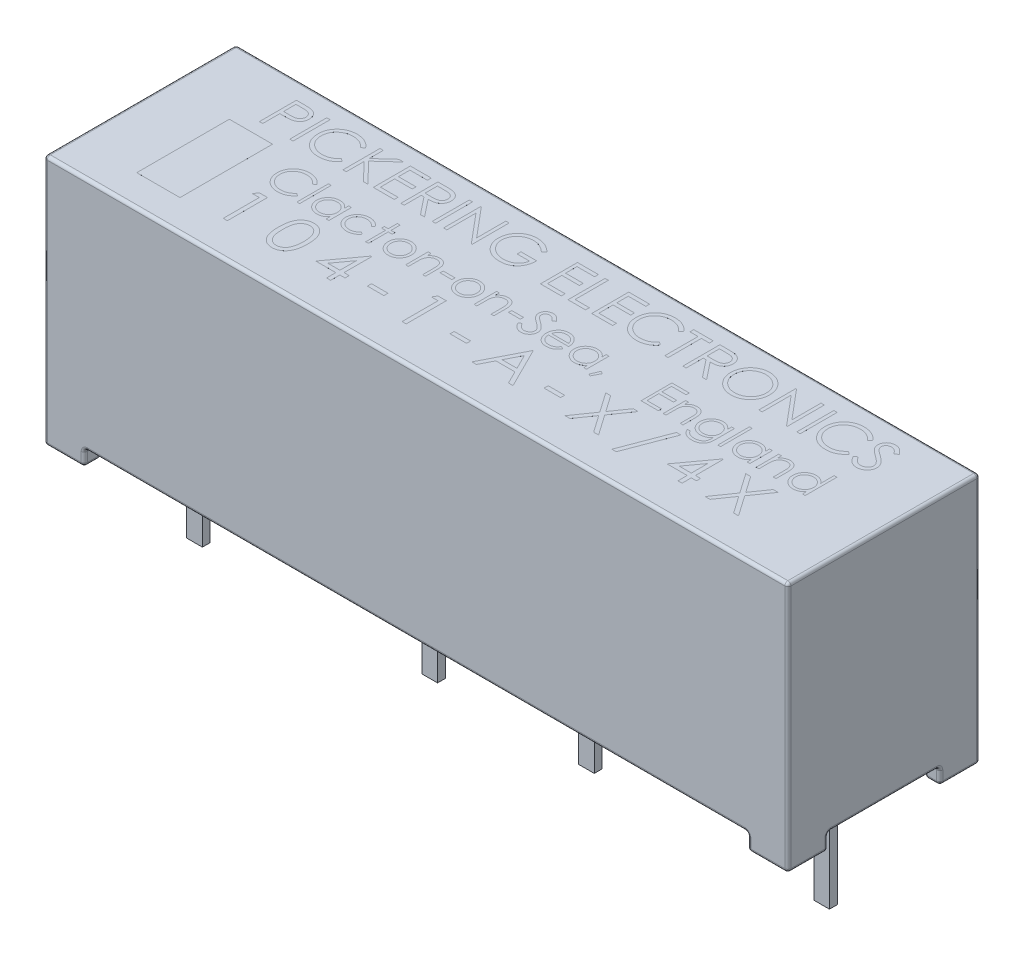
from build123d import *

# Parameters (mm, degrees)
SKETCH1_W               = 24.1
SKETCH1_H               = 6.22
MAIN_BODY_DEPTH         = 7.622
ORIGINAL_FOOT_DEPTH     = 0.508
RIGHT_FEET_COPY_1_DEPTH = 0.508
SKETCH3_W               = 0.508
SKETCH3_H               = 0.254
PINS_DEPTH              = 3.808
SKETCH4_W               = 1.4
SKETCH4_H               = 3
SKETCH4_W_2             = 0.107692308
SKETCH4_H_2             = 1.2
SKETCH4_W_3             = 0.08974359
SKETCH4_H_3             = 1.025641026
SKETCH4_W_4             = 0.384615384
SKETCH4_H_4             = 0.102564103
SKETCH4_W_5             = 0.533333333
SKETCH4_H_5             = 0.133333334
LETTERING_DEPTH         = 0.0001
FILLET1_R               = 0.1


with BuildPart() as part:
    # Sketch1 → Main Body (new body)
    with BuildSketch(Plane(origin=(0, 0, 0), x_dir=(1, 0, 0), z_dir=(0, 1, 0))):
        Rectangle(SKETCH1_W, SKETCH1_H)
    extrude(amount=MAIN_BODY_DEPTH)

    # Sketch2 → Original foot (add)
    with BuildSketch(Plane.XZ):
        Polygon((-12.05, 3.11), (-10.75, 3.11), (-10.75, 2.53065977), (-11.560513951, 2.53065977), (-11.560513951, 1.81), (-12.05, 1.81), align=None)
    original_foot = extrude(amount=ORIGINAL_FOOT_DEPTH)

    # Left foot: Original foot across plane
    add(original_foot.mirror(Plane.XY))

    # Right Feet: Original foot across plane
    add(original_foot.mirror(Plane(origin=(0, 0, 0), x_dir=(0, 0, 1), z_dir=(1, 0, 0))))

    # Right Feet copy 1 sketch → Right Feet copy 1 (add)
    with BuildSketch(Plane(origin=(0, 0, 0), x_dir=(-1, 0, 0), z_dir=(0, -1, 0))):
        Polygon((-12.05, 3.11), (-10.75, 3.11), (-10.75, 2.53065977), (-11.560513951, 2.53065977), (-11.560513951, 1.81), (-12.05, 1.81), align=None)
    extrude(amount=RIGHT_FEET_COPY_1_DEPTH)

    # Sketch3 → Pins (add)
    with BuildSketch(Plane.XZ):
        with Locations((-10.16, 0)):
            Rectangle(SKETCH3_W, SKETCH3_H)
        with Locations((-2.54, 0)):
            Rectangle(SKETCH3_W, SKETCH3_H)
        with Locations((10.16, 0)):
            Rectangle(SKETCH3_W, SKETCH3_H)
        with Locations((2.54, 0)):
            Rectangle(SKETCH3_W, SKETCH3_H)
    extrude(amount=PINS_DEPTH)

    # Sketch4 → Lettering (add)
    # profile 1 of 55: a face of its own
    with BuildSketch(Plane(origin=(0, 7.622, 0), x_dir=(-1, 0, 0), z_dir=(0, 1, 0))):
        with Locations((9.35, 0.61)):
            Rectangle(SKETCH4_W, SKETCH4_H)
    # profile 2 of 55: a face of its own
    with BuildSketch(Plane(origin=(0, 7.622, 0), x_dir=(-1, 0, 0), z_dir=(0, 1, 0))):
        with BuildLine():
            Line((9.496153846, -2.51), (9.260817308, -2.51))
            add(Edge.make_bspline(
                [(9.260817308, -2.51), (9.244630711, -2.509982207), (9.213616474, -2.509948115), (9.16914274, -2.508914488), (9.128750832, -2.507533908), (9.092527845, -2.505620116), (9.060362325, -2.503358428), (9.032399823, -2.5001863), (9.008420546, -2.496874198), (8.994052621, -2.493506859), (8.9875, -2.491971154)],
                knots=[0, 0, 0, 0, 1.415646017, 2.712440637, 3.8905458, 4.950247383, 5.884950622, 6.709939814, 7.411656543, 8, 8, 8, 8], degree=3))
            add(Edge.make_bspline(
                [(8.9875, -2.491971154), (8.979205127, -2.489700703), (8.962810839, -2.4852133), (8.939186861, -2.476226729), (8.916714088, -2.465566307), (8.895298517, -2.453434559), (8.875307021, -2.439258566), (8.856115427, -2.423856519), (8.838126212, -2.406605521), (8.821611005, -2.387528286), (8.806308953, -2.367249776), (8.793500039, -2.345252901), (8.782189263, -2.32230074), (8.773374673, -2.29783291), (8.766446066, -2.272172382), (8.761399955, -2.245252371), (8.758156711, -2.21713095), (8.757848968, -2.197909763), (8.757692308, -2.188125)],
                knots=[0, 0, 0, 0, 0.999333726, 1.975119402, 2.933498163, 3.889020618, 4.832249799, 5.779334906, 6.747801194, 7.724875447, 8.710438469, 9.696133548, 10.679360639, 11.681339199, 12.714023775, 13.766351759, 14.862936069, 16, 16, 16, 16], degree=3))
            add(Edge.make_bspline(
                [(8.757692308, -2.188125), (8.757836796, -2.178258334), (8.758119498, -2.158953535), (8.76151251, -2.130711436), (8.766082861, -2.103722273), (8.773110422, -2.07804589), (8.782314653, -2.053834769), (8.793111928, -2.030718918), (8.806134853, -2.009091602), (8.821098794, -1.988874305), (8.837745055, -1.970048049), (8.856003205, -1.952749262), (8.875799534, -1.937079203), (8.897071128, -1.923002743), (8.920025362, -1.910846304), (8.9443141, -1.899958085), (8.97014846, -1.890813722), (8.988025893, -1.886003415), (8.997115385, -1.883557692)],
                knots=[0, 0, 0, 0, 1.121902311, 2.195077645, 3.232258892, 4.234102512, 5.217864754, 6.176164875, 7.132989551, 8.084763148, 9.034132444, 9.988522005, 10.94243251, 11.903244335, 12.886203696, 13.894208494, 14.929344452, 16, 16, 16, 16], degree=3))
            add(Edge.make_bspline(
                [(8.997115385, -1.883557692), (9.004633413, -1.881960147), (9.02110961, -1.878459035), (9.048242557, -1.874523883), (9.079849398, -1.871296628), (9.115822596, -1.868284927), (9.156246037, -1.866689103), (9.20102701, -1.864815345), (9.250317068, -1.86393122), (9.284695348, -1.863875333), (9.302644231, -1.863846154)],
                knots=[0, 0, 0, 0, 0.601372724, 1.317943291, 2.144091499, 3.08771165, 4.142394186, 5.309582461, 6.595334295, 8, 8, 8, 8], degree=3))
            Line((9.302644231, -1.863846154), (9.388461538, -1.863846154))
            Line((9.388461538, -1.863846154), (9.388461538, -1.31))
            Line((9.388461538, -1.31), (9.496153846, -1.31))
            Line((9.496153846, -1.31), (9.496153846, -2.51))
        make_face()
        with BuildLine():
            Line((9.388461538, -2.386923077), (9.388461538, -1.986923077))
            Line((9.388461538, -1.986923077), (9.178365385, -1.984278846))
            add(Edge.make_bspline(
                [(9.178365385, -1.984278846), (9.168106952, -1.984272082), (9.148303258, -1.984259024), (9.119618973, -1.985648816), (9.093070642, -1.987160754), (9.068619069, -1.989605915), (9.046375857, -1.99258825), (9.026287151, -1.996575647), (9.008192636, -2.000642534), (8.987349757, -2.007699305), (8.964003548, -2.018345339), (8.938664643, -2.034246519), (8.917014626, -2.054278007), (8.898437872, -2.077044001), (8.883754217, -2.102396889), (8.873112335, -2.129447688), (8.866616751, -2.158093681), (8.865800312, -2.177674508), (8.865384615, -2.187644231)],
                knots=[0, 0, 0, 0, 1.160501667, 2.240324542, 3.248665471, 4.168823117, 5.020172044, 5.786515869, 6.485785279, 7.116517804, 8.272762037, 9.381837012, 10.485674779, 11.594342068, 12.695271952, 13.786226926, 14.872841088, 16, 16, 16, 16], degree=3))
            add(Edge.make_bspline(
                [(8.865384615, -2.187644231), (8.865818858, -2.197290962), (8.866682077, -2.21646747), (8.873058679, -2.244585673), (8.883866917, -2.271328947), (8.898449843, -2.296480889), (8.916581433, -2.319186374), (8.937800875, -2.338771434), (8.961778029, -2.354623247), (8.983907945, -2.365175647), (9.003712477, -2.37136381), (9.020831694, -2.37583135), (9.040259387, -2.378912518), (9.061811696, -2.381860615), (9.085461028, -2.384240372), (9.111357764, -2.385892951), (9.139415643, -2.386849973), (9.158893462, -2.386898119), (9.168990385, -2.386923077)],
                knots=[0, 0, 0, 0, 1.12039168, 2.227199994, 3.330242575, 4.460839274, 5.593542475, 6.693949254, 7.801736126, 8.92216649, 9.528704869, 10.210659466, 10.975987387, 11.81211542, 12.738540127, 13.736887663, 14.826846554, 16, 16, 16, 16], degree=3))
            Line((9.168990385, -2.386923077), (9.388461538, -2.386923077))
        make_face(mode=Mode.SUBTRACT)
    # profile 3 of 55: a face of its own
    with BuildSketch(Plane(origin=(0, 7.622, 0), x_dir=(-1, 0, 0), z_dir=(0, 1, 0))):
        with Locations((8.457692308, -1.91)):
            Rectangle(SKETCH4_W_2, SKETCH4_H_2)
    # profile 4 of 55: a face of its own
    with BuildSketch(Plane(origin=(0, 7.622, 0), x_dir=(-1, 0, 0), z_dir=(0, 1, 0))):
        with BuildLine():
            Line((7.034615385, -2.289807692), (7.128846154, -2.217692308))
            add(Edge.make_bspline(
                [(7.128846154, -2.217692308), (7.135568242, -2.225703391), (7.148921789, -2.241617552), (7.170403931, -2.263966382), (7.192796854, -2.284897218), (7.216069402, -2.304544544), (7.240760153, -2.322118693), (7.265928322, -2.338988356), (7.292488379, -2.353758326), (7.329029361, -2.371801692), (7.377017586, -2.390219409), (7.437218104, -2.406060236), (7.500148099, -2.416049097), (7.543071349, -2.417138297), (7.564903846, -2.417692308)],
                knots=[0, 0, 0, 0, 0.75789156, 1.505565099, 2.245254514, 2.979266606, 3.711207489, 4.440978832, 5.174393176, 5.91211879, 7.394186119, 8.890401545, 10.418332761, 12, 12, 12, 12], degree=3))
            add(Edge.make_bspline(
                [(7.564903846, -2.417692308), (7.57693226, -2.417553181), (7.600877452, -2.41727622), (7.636416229, -2.413648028), (7.671358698, -2.408489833), (7.705574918, -2.401022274), (7.738996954, -2.391300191), (7.771879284, -2.37989878), (7.803834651, -2.365710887), (7.835247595, -2.350042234), (7.865342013, -2.33233961), (7.893822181, -2.313036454), (7.920559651, -2.292323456), (7.945622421, -2.270249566), (7.968757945, -2.246557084), (7.990212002, -2.221512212), (8.009957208, -2.195001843), (8.027973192, -2.167152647), (8.044087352, -2.138102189), (8.058060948, -2.107975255), (8.069872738, -2.076886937), (8.079455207, -2.04490386), (8.086954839, -2.012139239), (8.092146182, -1.978475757), (8.095740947, -1.943972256), (8.096015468, -1.920586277), (8.096153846, -1.908798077)],
                knots=[0, 0, 0, 0, 1.054960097, 2.100129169, 3.131228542, 4.15308236, 5.169990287, 6.183953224, 7.204064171, 8.235355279, 9.262684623, 10.264978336, 11.252191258, 12.228402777, 13.192898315, 14.155264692, 15.119862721, 16.091023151, 17.063429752, 18.032246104, 19.00241354, 19.978852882, 20.959535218, 21.948948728, 22.966123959, 24, 24, 24, 24], degree=3))
            add(Edge.make_bspline(
                [(8.096153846, -1.908798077), (8.095720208, -1.89106202), (8.094868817, -1.856239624), (8.087323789, -1.805226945), (8.075766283, -1.756309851), (8.058728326, -1.709819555), (8.037300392, -1.665368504), (8.010564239, -1.623495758), (7.979481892, -1.583587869), (7.943734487, -1.546611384), (7.904508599, -1.512835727), (7.862423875, -1.483092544), (7.817583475, -1.458298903), (7.770482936, -1.437667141), (7.720759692, -1.421807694), (7.668503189, -1.410642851), (7.613827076, -1.403359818), (7.576466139, -1.402662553), (7.557451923, -1.402307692)],
                knots=[0, 0, 0, 0, 1.029159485, 2.020618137, 2.987588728, 3.942669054, 4.889339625, 5.846988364, 6.821327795, 7.821533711, 8.827683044, 9.822769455, 10.807800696, 11.797391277, 12.803701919, 13.832062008, 14.896664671, 16, 16, 16, 16], degree=3))
            add(Edge.make_bspline(
                [(7.557451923, -1.402307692), (7.53650243, -1.402886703), (7.495268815, -1.404026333), (7.434799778, -1.413680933), (7.376913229, -1.429335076), (7.321606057, -1.451242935), (7.269034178, -1.479722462), (7.219115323, -1.514247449), (7.171807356, -1.555146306), (7.143360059, -1.586374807), (7.128846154, -1.602307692)],
                knots=[0, 0, 0, 0, 1.028121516, 2.023589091, 2.998037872, 3.967518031, 4.937445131, 5.927275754, 6.942489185, 8, 8, 8, 8], degree=3))
            Line((7.128846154, -1.602307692), (7.034615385, -1.530913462))
            add(Edge.make_bspline(
                [(7.034615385, -1.530913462), (7.042198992, -1.521129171), (7.057329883, -1.501607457), (7.08182598, -1.474080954), (7.107649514, -1.448211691), (7.134870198, -1.424134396), (7.163523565, -1.401728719), (7.193597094, -1.381098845), (7.224940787, -1.362015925), (7.257593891, -1.3447195), (7.291558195, -1.329328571), (7.32654263, -1.315876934), (7.362611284, -1.304581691), (7.399479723, -1.295091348), (7.437526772, -1.288313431), (7.476317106, -1.282919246), (7.516211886, -1.279718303), (7.543103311, -1.279394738), (7.556730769, -1.279230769)],
                knots=[0, 0, 0, 0, 0.986880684, 1.969034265, 2.935876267, 3.899990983, 4.864973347, 5.834408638, 6.8063673, 7.789580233, 8.778939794, 9.778051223, 10.776304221, 11.791326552, 12.811423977, 13.855999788, 14.91350973, 16, 16, 16, 16], degree=3))
            add(Edge.make_bspline(
                [(7.556730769, -1.279230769), (7.569637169, -1.279320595), (7.595157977, -1.279498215), (7.632837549, -1.28237553), (7.669519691, -1.286301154), (7.705099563, -1.292212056), (7.739771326, -1.299187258), (7.773220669, -1.308537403), (7.805776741, -1.319011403), (7.837308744, -1.331321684), (7.867843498, -1.345212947), (7.897282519, -1.36091291), (7.925612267, -1.378289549), (7.953111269, -1.396959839), (7.979373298, -1.417523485), (8.004625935, -1.439694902), (8.029010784, -1.463399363), (8.044097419, -1.480492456), (8.051682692, -1.489086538)],
                knots=[0, 0, 0, 0, 1.114604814, 2.203992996, 3.262667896, 4.300477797, 5.318619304, 6.316056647, 7.298880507, 8.271930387, 9.238335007, 10.195173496, 11.151986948, 12.108099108, 13.064862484, 14.031167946, 15.010108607, 16, 16, 16, 16], degree=3))
            add(Edge.make_bspline(
                [(8.051682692, -1.489086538), (8.063831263, -1.504015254), (8.087981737, -1.533692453), (8.118893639, -1.581785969), (8.145265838, -1.631954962), (8.166826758, -1.684490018), (8.18338806, -1.739411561), (8.195031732, -1.796631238), (8.202545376, -1.856034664), (8.203407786, -1.89643528), (8.203846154, -1.916971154)],
                knots=[0, 0, 0, 0, 0.994611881, 1.977215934, 2.950189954, 3.921972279, 4.908960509, 5.911694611, 6.938501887, 8, 8, 8, 8], degree=3))
            add(Edge.make_bspline(
                [(8.203846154, -1.916971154), (8.20331056, -1.938554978), (8.202256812, -1.981019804), (8.193378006, -2.043355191), (8.178921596, -2.102990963), (8.159015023, -2.160156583), (8.132752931, -2.214524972), (8.100960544, -2.26632575), (8.063327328, -2.315516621), (8.02032592, -2.361468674), (7.973157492, -2.403481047), (7.922648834, -2.440443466), (7.868894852, -2.47120368), (7.812488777, -2.496916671), (7.75300796, -2.516680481), (7.69057938, -2.530515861), (7.625320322, -2.539127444), (7.580796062, -2.540216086), (7.558173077, -2.540769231)],
                knots=[0, 0, 0, 0, 1.032901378, 2.032168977, 3.007206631, 3.966850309, 4.924221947, 5.891988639, 6.871730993, 7.884084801, 8.900290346, 9.89161143, 10.874607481, 11.860025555, 12.854717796, 13.869097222, 14.917278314, 16, 16, 16, 16], degree=3))
            add(Edge.make_bspline(
                [(7.558173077, -2.540769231), (7.544385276, -2.540603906), (7.517093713, -2.540276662), (7.476721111, -2.537086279), (7.437416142, -2.531766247), (7.399069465, -2.524515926), (7.36161783, -2.515497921), (7.325229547, -2.504206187), (7.290008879, -2.490553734), (7.255718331, -2.475358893), (7.222797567, -2.457956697), (7.191262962, -2.439041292), (7.161370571, -2.418248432), (7.132926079, -2.395881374), (7.106060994, -2.371768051), (7.080372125, -2.346313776), (7.056622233, -2.318843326), (7.041964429, -2.299503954), (7.034615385, -2.289807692)],
                knots=[0, 0, 0, 0, 1.096566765, 2.170543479, 3.218870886, 4.250164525, 5.273529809, 6.281496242, 7.278154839, 8.276706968, 9.263143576, 10.238168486, 11.199979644, 12.157579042, 13.114563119, 14.070017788, 15.032356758, 16, 16, 16, 16], degree=3))
        make_face()
    # profile 5 of 55: a face of its own
    with BuildSketch(Plane(origin=(0, 7.622, 0), x_dir=(-1, 0, 0), z_dir=(0, 1, 0))):
        Polygon((6.788461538, -2.51), (6.680769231, -2.51), (6.680769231, -2.053028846), (6.180528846, -2.51), (6.026923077, -2.51), (6.616586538, -1.971538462), (5.980769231, -1.31), (6.124278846, -1.31), (6.680769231, -1.889086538), (6.680769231, -1.31), (6.788461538, -1.31), align=None)
    # profile 6 of 55: a face of its own
    with BuildSketch(Plane(origin=(0, 7.622, 0), x_dir=(-1, 0, 0), z_dir=(0, 1, 0))):
        Polygon((5.803846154, -2.51), (5.126923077, -2.51), (5.126923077, -2.386923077), (5.696153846, -2.386923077), (5.696153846, -2.017692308), (5.126923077, -2.017692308), (5.126923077, -1.894615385), (5.696153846, -1.894615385), (5.696153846, -1.433076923), (5.126923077, -1.433076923), (5.126923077, -1.31), (5.803846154, -1.31), align=None)
    # profile 7 of 55: a face of its own
    with BuildSketch(Plane(origin=(0, 7.622, 0), x_dir=(-1, 0, 0), z_dir=(0, 1, 0))):
        with BuildLine():
            Line((4.911538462, -2.51), (4.671394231, -2.51))
            add(Edge.make_bspline(
                [(4.671394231, -2.51), (4.655368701, -2.509946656), (4.624597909, -2.50984423), (4.580515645, -2.509273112), (4.54046064, -2.50763619), (4.504453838, -2.506227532), (4.472495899, -2.503658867), (4.444488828, -2.501203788), (4.420561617, -2.497989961), (4.406077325, -2.495005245), (4.399519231, -2.493653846)],
                knots=[0, 0, 0, 0, 1.410062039, 2.707475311, 3.878576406, 4.937260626, 5.877586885, 6.699081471, 7.410979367, 8, 8, 8, 8], degree=3))
            add(Edge.make_bspline(
                [(4.399519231, -2.493653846), (4.390739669, -2.49148491), (4.373367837, -2.487193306), (4.348358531, -2.478117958), (4.324517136, -2.467632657), (4.301930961, -2.455223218), (4.280605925, -2.441099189), (4.260544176, -2.425203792), (4.242014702, -2.407400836), (4.224358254, -2.388427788), (4.208940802, -2.367458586), (4.195061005, -2.345557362), (4.183409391, -2.322302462), (4.174240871, -2.297811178), (4.166554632, -2.272323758), (4.161388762, -2.245588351), (4.158171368, -2.217691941), (4.157853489, -2.198710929), (4.157692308, -2.189086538)],
                knots=[0, 0, 0, 0, 1.027276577, 2.032638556, 3.019345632, 3.985365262, 4.957888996, 5.923693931, 6.890056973, 7.876427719, 8.865527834, 9.843495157, 10.821038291, 11.815616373, 12.812734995, 13.843357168, 14.906466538, 16, 16, 16, 16], degree=3))
            add(Edge.make_bspline(
                [(4.157692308, -2.189086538), (4.158195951, -2.173097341), (4.15917869, -2.141898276), (4.168341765, -2.096620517), (4.18335019, -2.054383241), (4.20403492, -2.015245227), (4.230363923, -1.979948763), (4.262005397, -1.949051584), (4.298797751, -1.922957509), (4.333209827, -1.905054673), (4.363622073, -1.893535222), (4.388732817, -1.885389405), (4.416145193, -1.87920187), (4.445465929, -1.873578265), (4.476921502, -1.869287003), (4.510448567, -1.866239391), (4.546130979, -1.864279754), (4.570590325, -1.863993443), (4.583173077, -1.863846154)],
                knots=[0, 0, 0, 0, 1.260402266, 2.459371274, 3.627181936, 4.786749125, 5.93865593, 7.087644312, 8.261344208, 9.485713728, 10.136162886, 10.825977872, 11.566646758, 12.35154167, 13.181268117, 14.0701832, 15.007234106, 16, 16, 16, 16], degree=3))
            Line((4.583173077, -1.863846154), (4.142307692, -1.31))
            Line((4.142307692, -1.31), (4.275480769, -1.31))
            Line((4.275480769, -1.31), (4.716346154, -1.863846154))
            Line((4.716346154, -1.863846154), (4.803846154, -1.863846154))
            Line((4.803846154, -1.863846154), (4.803846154, -1.31))
            Line((4.803846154, -1.31), (4.911538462, -1.31))
            Line((4.911538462, -1.31), (4.911538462, -2.51))
        make_face()
        with BuildLine():
            Line((4.803846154, -2.386923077), (4.803846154, -1.986923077))
            Line((4.803846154, -1.986923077), (4.584134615, -1.985240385))
            add(Edge.make_bspline(
                [(4.584134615, -1.985240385), (4.573876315, -1.985235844), (4.553992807, -1.985227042), (4.525226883, -1.986596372), (4.498442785, -1.988153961), (4.473743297, -1.990536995), (4.451116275, -1.993606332), (4.430576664, -1.997451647), (4.412079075, -2.001912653), (4.390574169, -2.008887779), (4.366284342, -2.019462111), (4.34043109, -2.03585853), (4.317823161, -2.055687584), (4.299027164, -2.078648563), (4.283930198, -2.10400223), (4.27344401, -2.131174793), (4.266533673, -2.159738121), (4.265772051, -2.179350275), (4.265384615, -2.189326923)],
                knots=[0, 0, 0, 0, 1.146399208, 2.222048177, 3.218135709, 4.144938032, 4.994811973, 5.769438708, 6.479732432, 7.119818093, 8.294689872, 9.430121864, 10.527913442, 11.641375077, 12.733452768, 13.811150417, 14.886538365, 16, 16, 16, 16], degree=3))
            add(Edge.make_bspline(
                [(4.265384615, -2.189326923), (4.265791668, -2.198979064), (4.266598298, -2.218106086), (4.273333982, -2.246044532), (4.284332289, -2.272610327), (4.299386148, -2.297437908), (4.318122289, -2.31980791), (4.339945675, -2.338889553), (4.364342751, -2.354742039), (4.386960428, -2.365201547), (4.407324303, -2.371355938), (4.424923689, -2.375823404), (4.444982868, -2.378952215), (4.467265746, -2.381829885), (4.491870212, -2.38426683), (4.518811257, -2.385884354), (4.54806962, -2.386851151), (4.568348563, -2.386898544), (4.578846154, -2.386923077)],
                knots=[0, 0, 0, 0, 1.100596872, 2.180981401, 3.259506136, 4.371595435, 5.481727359, 6.576991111, 7.667816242, 8.793363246, 9.406619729, 10.09427138, 10.864108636, 11.721733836, 12.6590937, 13.685439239, 14.801845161, 16, 16, 16, 16], degree=3))
            Line((4.578846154, -2.386923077), (4.803846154, -2.386923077))
        make_face(mode=Mode.SUBTRACT)
    # profile 8 of 55: a face of its own
    with BuildSketch(Plane(origin=(0, 7.622, 0), x_dir=(-1, 0, 0), z_dir=(0, 1, 0))):
        with Locations((3.842307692, -1.91)):
            Rectangle(SKETCH4_W_2, SKETCH4_H_2)
    # profile 9 of 55: a face of its own
    with BuildSketch(Plane(origin=(0, 7.622, 0), x_dir=(-1, 0, 0), z_dir=(0, 1, 0))):
        Polygon((3.526923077, -1.31), (3.526923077, -2.51), (3.504326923, -2.51), (2.711538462, -1.565528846), (2.711538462, -2.51), (2.603846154, -2.51), (2.603846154, -1.31), (2.628365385, -1.31), (3.419230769, -2.252307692), (3.419230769, -1.31), align=None)
    # profile 10 of 55: a face of its own
    with BuildSketch(Plane(origin=(0, 7.622, 0), x_dir=(-1, 0, 0), z_dir=(0, 1, 0))):
        with BuildLine():
            Line((1.173076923, -2.305192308), (1.265384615, -2.217692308))
            add(Edge.make_bspline(
                [(1.265384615, -2.217692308), (1.282186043, -2.233384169), (1.315299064, -2.264310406), (1.369026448, -2.304884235), (1.425160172, -2.33937083), (1.483243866, -2.367704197), (1.542157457, -2.38972872), (1.600724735, -2.405653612), (1.658535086, -2.415895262), (1.696914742, -2.417098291), (1.715865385, -2.417692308)],
                knots=[0, 0, 0, 0, 1.091957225, 2.152079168, 3.193085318, 4.218301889, 5.218403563, 6.17723952, 7.099979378, 8, 8, 8, 8], degree=3))
            add(Edge.make_bspline(
                [(1.715865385, -2.417692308), (1.727493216, -2.417550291), (1.750718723, -2.417266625), (1.785218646, -2.413654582), (1.819352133, -2.408443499), (1.853001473, -2.40098118), (1.886300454, -2.391288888), (1.919174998, -2.379586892), (1.951561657, -2.365500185), (1.983290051, -2.349440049), (2.01420648, -2.331907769), (2.043283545, -2.312354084), (2.070642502, -2.291380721), (2.096089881, -2.268712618), (2.119974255, -2.244727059), (2.141858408, -2.219083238), (2.162220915, -2.192160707), (2.180300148, -2.163573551), (2.196641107, -2.134134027), (2.210790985, -2.104076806), (2.22297485, -2.073613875), (2.232710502, -2.042728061), (2.240537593, -2.011439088), (2.24607771, -1.979795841), (2.249189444, -1.947642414), (2.249728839, -1.92611207), (2.25, -1.915288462)],
                knots=[0, 0, 0, 0, 1.028307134, 2.053947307, 3.065600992, 4.082111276, 5.100671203, 6.132125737, 7.167228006, 8.222953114, 9.277225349, 10.309459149, 11.320441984, 12.324791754, 13.322338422, 14.312705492, 15.305176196, 16.306142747, 17.302479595, 18.282363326, 19.243345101, 20.20291386, 21.145121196, 22.094978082, 23.042318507, 24, 24, 24, 24], degree=3))
            add(Edge.make_bspline(
                [(2.25, -1.915288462), (2.249738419, -1.904224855), (2.249215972, -1.882127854), (2.245940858, -1.849136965), (2.239657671, -1.816703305), (2.231982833, -1.784520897), (2.22111931, -1.753000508), (2.208490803, -1.721680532), (2.193263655, -1.69085205), (2.175729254, -1.660729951), (2.156351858, -1.631416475), (2.135043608, -1.603571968), (2.11176426, -1.57752184), (2.086941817, -1.552885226), (2.060349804, -1.529817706), (2.031730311, -1.508597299), (2.001483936, -1.488895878), (1.969597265, -1.470929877), (1.936407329, -1.454881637), (1.902376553, -1.440610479), (1.867395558, -1.428857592), (1.831648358, -1.419278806), (1.79517752, -1.411427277), (1.757797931, -1.406376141), (1.719784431, -1.402710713), (1.694159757, -1.402442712), (1.68125, -1.402307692)],
                knots=[0, 0, 0, 0, 0.935896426, 1.86923723, 2.799743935, 3.728471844, 4.66505513, 5.616527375, 6.583419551, 7.570341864, 8.562833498, 9.553750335, 10.533080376, 11.5155245, 12.510142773, 13.507781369, 14.526649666, 15.561487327, 16.601173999, 17.643331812, 18.680652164, 19.71969803, 20.772446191, 21.833473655, 22.9085001, 24, 24, 24, 24], degree=3))
            add(Edge.make_bspline(
                [(1.68125, -1.402307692), (1.665691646, -1.402632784), (1.63514029, -1.403271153), (1.590231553, -1.408244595), (1.547095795, -1.41600224), (1.505873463, -1.427398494), (1.466414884, -1.441823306), (1.428865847, -1.459661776), (1.393121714, -1.480725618), (1.359340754, -1.504590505), (1.328312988, -1.5311735), (1.300110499, -1.559626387), (1.275559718, -1.590176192), (1.254500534, -1.622816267), (1.236374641, -1.657065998), (1.221915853, -1.693512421), (1.210732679, -1.731748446), (1.206157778, -1.758182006), (1.203846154, -1.771538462)],
                knots=[0, 0, 0, 0, 1.130234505, 2.219399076, 3.279128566, 4.311639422, 5.322903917, 6.328167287, 7.327698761, 8.334124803, 9.329374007, 10.292761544, 11.24113083, 12.171311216, 13.111441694, 14.052040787, 15.015727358, 16, 16, 16, 16], degree=3))
            Line((1.203846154, -1.771538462), (1.603846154, -1.771538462))
            Line((1.603846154, -1.771538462), (1.603846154, -1.894615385))
            Line((1.603846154, -1.894615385), (1.096153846, -1.894615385))
            add(Edge.make_bspline(
                [(1.096153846, -1.894615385), (1.096738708, -1.871675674), (1.09788339, -1.826778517), (1.105912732, -1.761302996), (1.118878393, -1.699461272), (1.1365905, -1.641188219), (1.159519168, -1.586566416), (1.187418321, -1.535540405), (1.220734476, -1.488439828), (1.258280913, -1.44488017), (1.300418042, -1.40602444), (1.346007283, -1.371873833), (1.395123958, -1.343107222), (1.447721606, -1.319703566), (1.50362804, -1.301438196), (1.562972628, -1.288487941), (1.625674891, -1.280729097), (1.668647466, -1.279737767), (1.690625, -1.279230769)],
                knots=[0, 0, 0, 0, 1.140356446, 2.231883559, 3.274166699, 4.278491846, 5.25512956, 6.21435461, 7.1637429, 8.11826594, 9.068280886, 10.0076534, 10.945064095, 11.891975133, 12.864533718, 13.863980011, 14.907571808, 16, 16, 16, 16], degree=3))
            add(Edge.make_bspline(
                [(1.690625, -1.279230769), (1.704171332, -1.279425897), (1.730889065, -1.27981075), (1.770348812, -1.282545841), (1.808720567, -1.286756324), (1.845998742, -1.293114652), (1.882320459, -1.300902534), (1.917504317, -1.310875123), (1.951684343, -1.322418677), (1.984913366, -1.335548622), (2.016889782, -1.350761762), (2.047756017, -1.367667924), (2.077682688, -1.386179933), (2.106465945, -1.406617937), (2.134255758, -1.428829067), (2.160872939, -1.452857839), (2.186466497, -1.478630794), (2.202498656, -1.496932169), (2.210576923, -1.506153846)],
                knots=[0, 0, 0, 0, 1.107784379, 2.184907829, 3.233506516, 4.263428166, 5.276301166, 6.270063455, 7.25232949, 8.225834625, 9.190232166, 10.146266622, 11.1027726, 12.066435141, 13.031522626, 14.010570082, 14.99756817, 16, 16, 16, 16], degree=3))
            add(Edge.make_bspline(
                [(2.210576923, -1.506153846), (2.222297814, -1.520783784), (2.245545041, -1.549800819), (2.275468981, -1.596292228), (2.300978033, -1.644430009), (2.321675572, -1.694348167), (2.337837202, -1.746000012), (2.349427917, -1.79931954), (2.356218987, -1.854375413), (2.357197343, -1.891632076), (2.357692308, -1.910480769)],
                knots=[0, 0, 0, 0, 1.023165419, 2.029347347, 3.013907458, 3.994755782, 4.975994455, 5.96558838, 6.970761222, 8, 8, 8, 8], degree=3))
            add(Edge.make_bspline(
                [(2.357692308, -1.910480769), (2.357509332, -1.924594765), (2.357145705, -1.952643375), (2.352755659, -1.994288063), (2.346419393, -2.035182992), (2.337241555, -2.075366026), (2.325165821, -2.114658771), (2.310663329, -2.153363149), (2.293676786, -2.191324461), (2.273854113, -2.228206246), (2.252277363, -2.263995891), (2.228014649, -2.297566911), (2.202413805, -2.329568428), (2.174248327, -2.359094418), (2.144573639, -2.387088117), (2.112651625, -2.412811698), (2.079006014, -2.436699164), (2.043365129, -2.458283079), (2.006294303, -2.477677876), (1.967873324, -2.494679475), (1.928116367, -2.50873101), (1.887320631, -2.520653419), (1.845177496, -2.529470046), (1.801992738, -2.5358639), (1.757541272, -2.540238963), (1.727494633, -2.540590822), (1.712259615, -2.540769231)],
                knots=[0, 0, 0, 0, 1.009025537, 2.005226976, 2.991671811, 3.967589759, 4.950148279, 5.929425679, 6.922109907, 7.921964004, 8.922507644, 9.908469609, 10.882248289, 11.851158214, 12.824245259, 13.798023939, 14.780666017, 15.773333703, 16.775582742, 17.771174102, 18.775387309, 19.789283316, 20.80873549, 21.851817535, 22.910773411, 24, 24, 24, 24], degree=3))
            add(Edge.make_bspline(
                [(1.712259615, -2.540769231), (1.699834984, -2.540571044), (1.675198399, -2.540178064), (1.638539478, -2.537440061), (1.602519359, -2.533148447), (1.56695735, -2.527147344), (1.531988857, -2.519208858), (1.497507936, -2.509534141), (1.463579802, -2.498332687), (1.430244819, -2.484963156), (1.397276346, -2.46979101), (1.364491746, -2.452711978), (1.332002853, -2.433434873), (1.299753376, -2.411902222), (1.267539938, -2.38848391), (1.235872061, -2.362510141), (1.203985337, -2.335005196), (1.183481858, -2.315228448), (1.173076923, -2.305192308)],
                knots=[0, 0, 0, 0, 0.985875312, 1.954874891, 2.915472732, 3.863573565, 4.815313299, 5.759461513, 6.704487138, 7.649063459, 8.607849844, 9.583336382, 10.581114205, 11.603942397, 12.659508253, 13.739925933, 14.853076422, 16, 16, 16, 16], degree=3))
        make_face()
    # profile 11 of 55: a face of its own
    with BuildSketch(Plane(origin=(0, 7.622, 0), x_dir=(-1, 0, 0), z_dir=(0, 1, 0))):
        Polygon((0.388461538, -2.51), (-0.288461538, -2.51), (-0.288461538, -2.386923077), (0.280769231, -2.386923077), (0.280769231, -2.017692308), (-0.288461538, -2.017692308), (-0.288461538, -1.894615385), (0.280769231, -1.894615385), (0.280769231, -1.433076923), (-0.288461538, -1.433076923), (-0.288461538, -1.31), (0.388461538, -1.31), align=None)
    # profile 12 of 55: a face of its own
    with BuildSketch(Plane(origin=(0, 7.622, 0), x_dir=(-1, 0, 0), z_dir=(0, 1, 0))):
        Polygon((-0.503846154, -2.51), (-0.611538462, -2.51), (-0.611538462, -1.433076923), (-1.073076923, -1.433076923), (-1.073076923, -1.31), (-0.503846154, -1.31), align=None)
    # profile 13 of 55: a face of its own
    with BuildSketch(Plane(origin=(0, 7.622, 0), x_dir=(-1, 0, 0), z_dir=(0, 1, 0))):
        Polygon((-1.273076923, -2.51), (-1.95, -2.51), (-1.95, -2.386923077), (-1.380769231, -2.386923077), (-1.380769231, -2.017692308), (-1.95, -2.017692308), (-1.95, -1.894615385), (-1.380769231, -1.894615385), (-1.380769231, -1.433076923), (-1.95, -1.433076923), (-1.95, -1.31), (-1.273076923, -1.31), align=None)
    # profile 14 of 55: a face of its own
    with BuildSketch(Plane(origin=(0, 7.622, 0), x_dir=(-1, 0, 0), z_dir=(0, 1, 0))):
        with BuildLine():
            Line((-3.273076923, -2.289807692), (-3.178846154, -2.217692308))
            add(Edge.make_bspline(
                [(-3.178846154, -2.217692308), (-3.172124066, -2.225703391), (-3.158770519, -2.241617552), (-3.137288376, -2.263966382), (-3.114895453, -2.284897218), (-3.091622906, -2.304544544), (-3.066932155, -2.322118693), (-3.041763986, -2.338988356), (-3.015203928, -2.353758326), (-2.978662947, -2.371801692), (-2.930674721, -2.390219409), (-2.870474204, -2.406060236), (-2.807544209, -2.416049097), (-2.764620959, -2.417138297), (-2.742788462, -2.417692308)],
                knots=[0, 0, 0, 0, 0.75789156, 1.505565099, 2.245254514, 2.979266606, 3.711207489, 4.440978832, 5.174393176, 5.91211879, 7.394186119, 8.890401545, 10.418332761, 12, 12, 12, 12], degree=3))
            add(Edge.make_bspline(
                [(-2.742788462, -2.417692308), (-2.730760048, -2.417553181), (-2.706814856, -2.41727622), (-2.671276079, -2.413648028), (-2.63633361, -2.408489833), (-2.602117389, -2.401022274), (-2.568695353, -2.391300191), (-2.535813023, -2.37989878), (-2.503857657, -2.365710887), (-2.472444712, -2.350042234), (-2.442350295, -2.33233961), (-2.413870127, -2.313036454), (-2.387132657, -2.292323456), (-2.362069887, -2.270249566), (-2.338934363, -2.246557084), (-2.317480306, -2.221512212), (-2.297735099, -2.195001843), (-2.279719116, -2.167152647), (-2.263604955, -2.138102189), (-2.24963136, -2.107975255), (-2.23781957, -2.076886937), (-2.228237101, -2.04490386), (-2.220737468, -2.012139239), (-2.215546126, -1.978475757), (-2.211951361, -1.943972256), (-2.21167684, -1.920586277), (-2.211538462, -1.908798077)],
                knots=[0, 0, 0, 0, 1.054960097, 2.100129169, 3.131228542, 4.15308236, 5.169990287, 6.183953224, 7.204064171, 8.235355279, 9.262684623, 10.264978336, 11.252191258, 12.228402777, 13.192898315, 14.155264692, 15.119862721, 16.091023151, 17.063429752, 18.032246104, 19.00241354, 19.978852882, 20.959535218, 21.948948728, 22.966123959, 24, 24, 24, 24], degree=3))
            add(Edge.make_bspline(
                [(-2.211538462, -1.908798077), (-2.2119721, -1.89106202), (-2.21282349, -1.856239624), (-2.220368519, -1.805226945), (-2.231926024, -1.756309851), (-2.248963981, -1.709819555), (-2.270391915, -1.665368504), (-2.297128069, -1.623495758), (-2.328210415, -1.583587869), (-2.36395782, -1.546611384), (-2.403183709, -1.512835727), (-2.445268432, -1.483092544), (-2.490108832, -1.458298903), (-2.537209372, -1.437667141), (-2.586932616, -1.421807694), (-2.639189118, -1.410642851), (-2.693865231, -1.403359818), (-2.731226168, -1.402662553), (-2.750240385, -1.402307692)],
                knots=[0, 0, 0, 0, 1.029159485, 2.020618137, 2.987588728, 3.942669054, 4.889339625, 5.846988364, 6.821327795, 7.821533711, 8.827683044, 9.822769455, 10.807800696, 11.797391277, 12.803701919, 13.832062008, 14.896664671, 16, 16, 16, 16], degree=3))
            add(Edge.make_bspline(
                [(-2.750240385, -1.402307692), (-2.771189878, -1.402886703), (-2.812423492, -1.404026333), (-2.87289253, -1.413680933), (-2.930779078, -1.429335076), (-2.986086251, -1.451242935), (-3.03865813, -1.479722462), (-3.088576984, -1.514247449), (-3.135884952, -1.555146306), (-3.164332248, -1.586374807), (-3.178846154, -1.602307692)],
                knots=[0, 0, 0, 0, 1.028121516, 2.023589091, 2.998037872, 3.967518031, 4.937445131, 5.927275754, 6.942489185, 8, 8, 8, 8], degree=3))
            Line((-3.178846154, -1.602307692), (-3.273076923, -1.530913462))
            add(Edge.make_bspline(
                [(-3.273076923, -1.530913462), (-3.265493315, -1.521129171), (-3.250362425, -1.501607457), (-3.225866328, -1.474080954), (-3.200042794, -1.448211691), (-3.17282211, -1.424134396), (-3.144168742, -1.401728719), (-3.114095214, -1.381098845), (-3.082751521, -1.362015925), (-3.050098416, -1.3447195), (-3.016134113, -1.329328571), (-2.981149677, -1.315876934), (-2.945081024, -1.304581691), (-2.908212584, -1.295091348), (-2.870165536, -1.288313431), (-2.831375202, -1.282919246), (-2.791480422, -1.279718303), (-2.764588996, -1.279394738), (-2.750961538, -1.279230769)],
                knots=[0, 0, 0, 0, 0.986880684, 1.969034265, 2.935876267, 3.899990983, 4.864973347, 5.834408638, 6.8063673, 7.789580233, 8.778939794, 9.778051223, 10.776304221, 11.791326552, 12.811423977, 13.855999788, 14.91350973, 16, 16, 16, 16], degree=3))
            add(Edge.make_bspline(
                [(-2.750961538, -1.279230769), (-2.738055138, -1.279320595), (-2.71253433, -1.279498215), (-2.674854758, -1.28237553), (-2.638172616, -1.286301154), (-2.602592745, -1.292212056), (-2.567920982, -1.299187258), (-2.534471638, -1.308537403), (-2.501915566, -1.319011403), (-2.470383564, -1.331321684), (-2.43984881, -1.345212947), (-2.410409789, -1.36091291), (-2.38208004, -1.378289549), (-2.354581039, -1.396959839), (-2.32831901, -1.417523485), (-2.303066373, -1.439694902), (-2.278681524, -1.463399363), (-2.263594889, -1.480492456), (-2.256009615, -1.489086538)],
                knots=[0, 0, 0, 0, 1.114604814, 2.203992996, 3.262667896, 4.300477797, 5.318619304, 6.316056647, 7.298880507, 8.271930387, 9.238335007, 10.195173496, 11.151986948, 12.108099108, 13.064862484, 14.031167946, 15.010108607, 16, 16, 16, 16], degree=3))
            add(Edge.make_bspline(
                [(-2.256009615, -1.489086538), (-2.243861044, -1.504015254), (-2.21971057, -1.533692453), (-2.188798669, -1.581785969), (-2.16242647, -1.631954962), (-2.14086555, -1.684490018), (-2.124304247, -1.739411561), (-2.112660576, -1.796631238), (-2.105146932, -1.856034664), (-2.104284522, -1.89643528), (-2.103846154, -1.916971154)],
                knots=[0, 0, 0, 0, 0.994611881, 1.977215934, 2.950189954, 3.921972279, 4.908960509, 5.911694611, 6.938501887, 8, 8, 8, 8], degree=3))
            add(Edge.make_bspline(
                [(-2.103846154, -1.916971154), (-2.104381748, -1.938554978), (-2.105435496, -1.981019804), (-2.114314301, -2.043355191), (-2.128770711, -2.102990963), (-2.148677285, -2.160156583), (-2.174939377, -2.214524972), (-2.206731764, -2.26632575), (-2.24436498, -2.315516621), (-2.287366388, -2.361468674), (-2.334534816, -2.403481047), (-2.385043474, -2.440443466), (-2.438797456, -2.47120368), (-2.49520353, -2.496916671), (-2.554684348, -2.516680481), (-2.617112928, -2.530515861), (-2.682371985, -2.539127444), (-2.726896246, -2.540216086), (-2.749519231, -2.540769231)],
                knots=[0, 0, 0, 0, 1.032901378, 2.032168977, 3.007206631, 3.966850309, 4.924221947, 5.891988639, 6.871730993, 7.884084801, 8.900290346, 9.89161143, 10.874607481, 11.860025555, 12.854717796, 13.869097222, 14.917278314, 16, 16, 16, 16], degree=3))
            add(Edge.make_bspline(
                [(-2.749519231, -2.540769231), (-2.763307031, -2.540603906), (-2.790598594, -2.540276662), (-2.830971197, -2.537086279), (-2.870276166, -2.531766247), (-2.908622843, -2.524515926), (-2.946074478, -2.515497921), (-2.982462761, -2.504206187), (-3.017683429, -2.490553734), (-3.051973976, -2.475358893), (-3.08489474, -2.457956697), (-3.116429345, -2.439041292), (-3.146321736, -2.418248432), (-3.174766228, -2.395881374), (-3.201631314, -2.371768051), (-3.227320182, -2.346313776), (-3.251070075, -2.318843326), (-3.265727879, -2.299503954), (-3.273076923, -2.289807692)],
                knots=[0, 0, 0, 0, 1.096566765, 2.170543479, 3.218870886, 4.250164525, 5.273529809, 6.281496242, 7.278154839, 8.276706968, 9.263143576, 10.238168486, 11.199979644, 12.157579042, 13.114563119, 14.070017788, 15.032356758, 16, 16, 16, 16], degree=3))
        make_face()
    # profile 15 of 55: a face of its own
    with BuildSketch(Plane(origin=(0, 7.622, 0), x_dir=(-1, 0, 0), z_dir=(0, 1, 0))):
        Polygon((-3.380769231, -2.386923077), (-3.380769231, -2.51), (-4.011538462, -2.51), (-4.011538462, -2.386923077), (-3.75, -2.386923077), (-3.75, -1.31), (-3.642307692, -1.31), (-3.642307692, -2.386923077), align=None)
    # profile 16 of 55: a face of its own
    with BuildSketch(Plane(origin=(0, 7.622, 0), x_dir=(-1, 0, 0), z_dir=(0, 1, 0))):
        with BuildLine():
            Line((-4.226923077, -2.51), (-4.467067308, -2.51))
            add(Edge.make_bspline(
                [(-4.467067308, -2.51), (-4.483092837, -2.509946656), (-4.51386363, -2.50984423), (-4.557945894, -2.509273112), (-4.598000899, -2.50763619), (-4.634007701, -2.506227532), (-4.66596564, -2.503658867), (-4.693972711, -2.501203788), (-4.717899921, -2.497989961), (-4.732384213, -2.495005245), (-4.738942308, -2.493653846)],
                knots=[0, 0, 0, 0, 1.410062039, 2.707475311, 3.878576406, 4.937260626, 5.877586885, 6.699081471, 7.410979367, 8, 8, 8, 8], degree=3))
            add(Edge.make_bspline(
                [(-4.738942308, -2.493653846), (-4.74772187, -2.49148491), (-4.765093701, -2.487193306), (-4.790103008, -2.478117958), (-4.813944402, -2.467632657), (-4.836530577, -2.455223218), (-4.857855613, -2.441099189), (-4.877917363, -2.425203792), (-4.896446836, -2.407400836), (-4.914103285, -2.388427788), (-4.929520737, -2.367458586), (-4.943400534, -2.345557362), (-4.955052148, -2.322302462), (-4.964220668, -2.297811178), (-4.971906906, -2.272323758), (-4.977072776, -2.245588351), (-4.980290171, -2.217691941), (-4.980608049, -2.198710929), (-4.980769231, -2.189086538)],
                knots=[0, 0, 0, 0, 1.027276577, 2.032638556, 3.019345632, 3.985365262, 4.957888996, 5.923693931, 6.890056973, 7.876427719, 8.865527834, 9.843495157, 10.821038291, 11.815616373, 12.812734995, 13.843357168, 14.906466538, 16, 16, 16, 16], degree=3))
            add(Edge.make_bspline(
                [(-4.980769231, -2.189086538), (-4.980265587, -2.173097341), (-4.979282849, -2.141898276), (-4.970119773, -2.096620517), (-4.955111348, -2.054383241), (-4.934426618, -2.015245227), (-4.908097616, -1.979948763), (-4.876456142, -1.949051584), (-4.839663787, -1.922957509), (-4.805251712, -1.905054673), (-4.774839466, -1.893535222), (-4.749728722, -1.885389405), (-4.722316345, -1.87920187), (-4.692995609, -1.873578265), (-4.661540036, -1.869287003), (-4.628012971, -1.866239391), (-4.59233056, -1.864279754), (-4.567871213, -1.863993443), (-4.555288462, -1.863846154)],
                knots=[0, 0, 0, 0, 1.260402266, 2.459371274, 3.627181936, 4.786749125, 5.93865593, 7.087644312, 8.261344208, 9.485713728, 10.136162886, 10.825977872, 11.566646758, 12.35154167, 13.181268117, 14.0701832, 15.007234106, 16, 16, 16, 16], degree=3))
            Line((-4.555288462, -1.863846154), (-4.996153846, -1.31))
            Line((-4.996153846, -1.31), (-4.862980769, -1.31))
            Line((-4.862980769, -1.31), (-4.422115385, -1.863846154))
            Line((-4.422115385, -1.863846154), (-4.334615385, -1.863846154))
            Line((-4.334615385, -1.863846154), (-4.334615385, -1.31))
            Line((-4.334615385, -1.31), (-4.226923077, -1.31))
            Line((-4.226923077, -1.31), (-4.226923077, -2.51))
        make_face()
        with BuildLine():
            Line((-4.334615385, -2.386923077), (-4.334615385, -1.986923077))
            Line((-4.334615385, -1.986923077), (-4.554326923, -1.985240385))
            add(Edge.make_bspline(
                [(-4.554326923, -1.985240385), (-4.564585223, -1.985235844), (-4.584468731, -1.985227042), (-4.613234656, -1.986596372), (-4.640018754, -1.988153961), (-4.664718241, -1.990536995), (-4.687345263, -1.993606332), (-4.707884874, -1.997451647), (-4.726382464, -2.001912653), (-4.74788737, -2.008887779), (-4.772177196, -2.019462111), (-4.798030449, -2.03585853), (-4.820638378, -2.055687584), (-4.839434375, -2.078648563), (-4.854531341, -2.10400223), (-4.865017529, -2.131174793), (-4.871927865, -2.159738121), (-4.872689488, -2.179350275), (-4.873076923, -2.189326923)],
                knots=[0, 0, 0, 0, 1.146399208, 2.222048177, 3.218135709, 4.144938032, 4.994811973, 5.769438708, 6.479732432, 7.119818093, 8.294689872, 9.430121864, 10.527913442, 11.641375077, 12.733452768, 13.811150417, 14.886538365, 16, 16, 16, 16], degree=3))
            add(Edge.make_bspline(
                [(-4.873076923, -2.189326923), (-4.87266987, -2.198979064), (-4.871863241, -2.218106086), (-4.865127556, -2.246044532), (-4.85412925, -2.272610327), (-4.839075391, -2.297437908), (-4.820339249, -2.31980791), (-4.798515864, -2.338889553), (-4.774118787, -2.354742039), (-4.75150111, -2.365201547), (-4.731137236, -2.371355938), (-4.71353785, -2.375823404), (-4.693478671, -2.378952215), (-4.671195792, -2.381829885), (-4.646591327, -2.38426683), (-4.619650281, -2.385884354), (-4.590391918, -2.386851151), (-4.570112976, -2.386898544), (-4.559615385, -2.386923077)],
                knots=[0, 0, 0, 0, 1.100596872, 2.180981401, 3.259506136, 4.371595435, 5.481727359, 6.576991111, 7.667816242, 8.793363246, 9.406619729, 10.09427138, 10.864108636, 11.721733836, 12.6590937, 13.685439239, 14.801845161, 16, 16, 16, 16], degree=3))
            Line((-4.559615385, -2.386923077), (-4.334615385, -2.386923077))
        make_face(mode=Mode.SUBTRACT)
    # profile 17 of 55: a face of its own
    with BuildSketch(Plane(origin=(0, 7.622, 0), x_dir=(-1, 0, 0), z_dir=(0, 1, 0))):
        with BuildLine():
            add(Edge.make_bspline(
                [(-5.803846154, -2.540769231), (-5.826068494, -2.540215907), (-5.869715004, -2.539129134), (-5.933802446, -2.530535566), (-5.995168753, -2.516391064), (-6.053850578, -2.496417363), (-6.109619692, -2.470519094), (-6.162652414, -2.439078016), (-6.212766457, -2.401785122), (-6.259832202, -2.359525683), (-6.302610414, -2.31307373), (-6.33983439, -2.263204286), (-6.371515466, -2.210921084), (-6.397400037, -2.155883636), (-6.417739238, -2.098337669), (-6.431766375, -2.037940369), (-6.440728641, -1.97509281), (-6.441776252, -1.932226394), (-6.442307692, -1.910480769)],
                knots=[0, 0, 0, 0, 1.065027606, 2.091802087, 3.093458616, 4.079833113, 5.057734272, 6.036020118, 7.030157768, 8.047461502, 9.064242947, 10.052216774, 11.02588392, 11.989864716, 12.962978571, 13.945936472, 14.957997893, 16, 16, 16, 16], degree=3))
            add(Edge.make_bspline(
                [(-6.442307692, -1.910480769), (-6.441776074, -1.888895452), (-6.440728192, -1.846348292), (-6.431759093, -1.783897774), (-6.417676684, -1.723871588), (-6.397651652, -1.666409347), (-6.371748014, -1.611482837), (-6.340017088, -1.559163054), (-6.302876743, -1.509148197), (-6.260273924, -1.462470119), (-6.213751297, -1.419687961), (-6.16418996, -1.38186789), (-6.111649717, -1.350361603), (-6.056950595, -1.32409008), (-5.999548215, -1.30419291), (-5.93984742, -1.289693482), (-5.877509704, -1.280821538), (-5.835045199, -1.279766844), (-5.813461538, -1.279230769)],
                knots=[0, 0, 0, 0, 1.043683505, 2.0572211, 3.045299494, 4.022276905, 4.994977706, 5.977452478, 6.97747046, 8.003698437, 9.029677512, 10.031249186, 11.013723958, 11.988083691, 12.9614021, 13.946617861, 14.956316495, 16, 16, 16, 16], degree=3))
            add(Edge.make_bspline(
                [(-5.813461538, -1.279230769), (-5.791716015, -1.279761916), (-5.7488498, -1.280808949), (-5.685923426, -1.289786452), (-5.625483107, -1.303819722), (-5.567714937, -1.323893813), (-5.512599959, -1.349739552), (-5.460143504, -1.381500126), (-5.410282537, -1.4189256), (-5.363524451, -1.461494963), (-5.320793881, -1.50792838), (-5.283209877, -1.557424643), (-5.251632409, -1.609513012), (-5.22577576, -1.663978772), (-5.205324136, -1.720681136), (-5.191366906, -1.779976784), (-5.182337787, -1.84153345), (-5.18129722, -1.883445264), (-5.180769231, -1.904711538)],
                knots=[0, 0, 0, 0, 1.053167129, 2.076072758, 3.073341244, 4.055601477, 5.033424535, 6.017524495, 7.021518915, 8.049444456, 9.077120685, 10.074910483, 11.055688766, 12.022980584, 12.991883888, 13.970269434, 14.970104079, 16, 16, 16, 16], degree=3))
            add(Edge.make_bspline(
                [(-5.180769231, -1.904711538), (-5.180952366, -1.918985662), (-5.181316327, -1.947353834), (-5.185704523, -1.989478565), (-5.192059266, -2.030930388), (-5.201214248, -2.071569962), (-5.213023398, -2.111403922), (-5.227576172, -2.150350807), (-5.244253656, -2.188731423), (-5.264110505, -2.22581532), (-5.285774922, -2.261660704), (-5.309397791, -2.295819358), (-5.335143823, -2.327681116), (-5.362645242, -2.357757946), (-5.392282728, -2.385536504), (-5.423610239, -2.411622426), (-5.456791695, -2.435745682), (-5.491879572, -2.457399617), (-5.527979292, -2.477289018), (-5.565352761, -2.493895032), (-5.603211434, -2.508572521), (-5.641888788, -2.520236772), (-5.681295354, -2.529519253), (-5.721480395, -2.535826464), (-5.762402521, -2.540224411), (-5.789972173, -2.540586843), (-5.803846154, -2.540769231)],
                knots=[0, 0, 0, 0, 1.037115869, 2.061148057, 3.07517727, 4.084041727, 5.086514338, 6.092668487, 7.104487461, 8.125783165, 9.147610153, 10.147694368, 11.141876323, 12.122903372, 13.107606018, 14.091946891, 15.084523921, 16.086505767, 17.087268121, 18.077809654, 19.05670789, 20.036870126, 21.011670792, 21.99694167, 22.991993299, 24, 24, 24, 24], degree=3))
        make_face()
        with BuildLine():
            add(Edge.make_bspline(
                [(-5.809134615, -2.417692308), (-5.797746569, -2.417554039), (-5.775079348, -2.417278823), (-5.741384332, -2.413631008), (-5.708120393, -2.40847427), (-5.675360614, -2.40096571), (-5.643075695, -2.39134487), (-5.611229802, -2.379464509), (-5.579794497, -2.365594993), (-5.549057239, -2.349495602), (-5.519508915, -2.331449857), (-5.490971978, -2.312423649), (-5.464536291, -2.291338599), (-5.439691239, -2.268976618), (-5.416497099, -2.245029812), (-5.394950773, -2.219674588), (-5.375073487, -2.192796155), (-5.357103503, -2.164506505), (-5.341111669, -2.134963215), (-5.326793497, -2.104731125), (-5.314924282, -2.073454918), (-5.305522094, -2.041329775), (-5.297541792, -2.008497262), (-5.292535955, -1.974778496), (-5.28885319, -1.940289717), (-5.288593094, -1.91698152), (-5.288461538, -1.905192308)],
                knots=[0, 0, 0, 0, 1.008431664, 2.007222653, 2.999229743, 3.989431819, 4.982149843, 5.98167215, 6.998687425, 8.024288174, 9.053028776, 10.065052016, 11.06063401, 12.045759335, 13.024701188, 14.011819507, 14.991481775, 15.984022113, 16.97831254, 17.965966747, 18.945551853, 19.938269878, 20.93007375, 21.936103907, 22.956087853, 24, 24, 24, 24], degree=3))
            add(Edge.make_bspline(
                [(-5.288461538, -1.905192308), (-5.288899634, -1.887857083), (-5.289761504, -1.853753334), (-5.297275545, -1.803770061), (-5.308941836, -1.755687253), (-5.325855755, -1.709791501), (-5.347432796, -1.665878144), (-5.373752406, -1.624118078), (-5.405055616, -1.584523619), (-5.4405924, -1.547389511), (-5.479450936, -1.513509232), (-5.520693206, -1.483728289), (-5.563992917, -1.458663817), (-5.609100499, -1.437710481), (-5.656401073, -1.42192511), (-5.705591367, -1.410670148), (-5.756672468, -1.403375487), (-5.791481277, -1.402667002), (-5.809134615, -1.402307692)],
                knots=[0, 0, 0, 0, 1.032022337, 2.030307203, 3.003823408, 3.974715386, 4.937372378, 5.913284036, 6.909147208, 7.938749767, 8.970518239, 9.975863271, 10.963918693, 11.946286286, 12.933361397, 13.927862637, 14.949112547, 16, 16, 16, 16], degree=3))
            add(Edge.make_bspline(
                [(-5.809134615, -1.402307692), (-5.821000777, -1.40247059), (-5.84453494, -1.402793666), (-5.87953843, -1.40605229), (-5.913914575, -1.411267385), (-5.947599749, -1.418813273), (-5.980638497, -1.428131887), (-6.012929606, -1.439692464), (-6.044468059, -1.453544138), (-6.07538743, -1.46900614), (-6.105018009, -1.486444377), (-6.133023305, -1.505604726), (-6.159587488, -1.525974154), (-6.184387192, -1.54817419), (-6.2074845, -1.571918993), (-6.228645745, -1.597381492), (-6.248513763, -1.624058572), (-6.266357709, -1.652341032), (-6.282568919, -1.681650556), (-6.296466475, -1.711970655), (-6.30834251, -1.743109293), (-6.317914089, -1.775097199), (-6.325418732, -1.807860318), (-6.330588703, -1.841446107), (-6.334205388, -1.875786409), (-6.334477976, -1.89901288), (-6.334615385, -1.910721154)],
                knots=[0, 0, 0, 0, 1.047362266, 2.077233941, 3.100744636, 4.115120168, 5.122788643, 6.129711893, 7.140355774, 8.162227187, 9.180148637, 10.17298275, 11.156396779, 12.133377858, 13.108923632, 14.078087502, 15.054351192, 16.043448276, 17.028082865, 18.009331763, 18.985518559, 19.968016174, 20.954783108, 21.950335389, 22.966780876, 24, 24, 24, 24], degree=3))
            add(Edge.make_bspline(
                [(-6.334615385, -1.910721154), (-6.33447786, -1.922349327), (-6.334205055, -1.94541595), (-6.330590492, -1.979516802), (-6.325413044, -2.01286076), (-6.317951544, -2.045316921), (-6.308334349, -2.076893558), (-6.296475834, -2.107561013), (-6.282492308, -2.137433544), (-6.266443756, -2.166437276), (-6.248404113, -2.194268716), (-6.228691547, -2.220874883), (-6.206967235, -2.245758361), (-6.183846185, -2.269525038), (-6.158772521, -2.291699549), (-6.131741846, -2.312196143), (-6.103427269, -2.331938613), (-6.073188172, -2.349410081), (-6.042093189, -2.365628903), (-6.010153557, -2.379454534), (-5.97776868, -2.391397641), (-5.944895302, -2.400924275), (-5.911590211, -2.408481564), (-5.877844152, -2.413629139), (-5.843669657, -2.417279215), (-5.820682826, -2.417554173), (-5.809134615, -2.417692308)],
                knots=[0, 0, 0, 0, 1.02988216, 2.042960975, 3.035124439, 4.018561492, 4.99104521, 5.957523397, 6.929462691, 7.91146347, 8.892205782, 9.866320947, 10.842813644, 11.816825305, 12.802668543, 13.805243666, 14.821427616, 15.858893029, 16.897256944, 17.927432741, 18.940436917, 19.95373962, 20.957947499, 21.96413624, 22.977215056, 24, 24, 24, 24], degree=3))
        make_face(mode=Mode.SUBTRACT)
    # profile 18 of 55: a face of its own
    with BuildSketch(Plane(origin=(0, 7.622, 0), x_dir=(-1, 0, 0), z_dir=(0, 1, 0))):
        Polygon((-6.688461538, -1.31), (-6.688461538, -2.51), (-6.711057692, -2.51), (-7.503846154, -1.565528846), (-7.503846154, -2.51), (-7.611538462, -2.51), (-7.611538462, -1.31), (-7.587019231, -1.31), (-6.796153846, -2.252307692), (-6.796153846, -1.31), align=None)
    # profile 19 of 55: a face of its own
    with BuildSketch(Plane(origin=(0, 7.622, 0), x_dir=(-1, 0, 0), z_dir=(0, 1, 0))):
        with Locations((-7.973076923, -1.91)):
            Rectangle(SKETCH4_W_2, SKETCH4_H_2)
    # profile 20 of 55: a face of its own
    with BuildSketch(Plane(origin=(0, 7.622, 0), x_dir=(-1, 0, 0), z_dir=(0, 1, 0))):
        with BuildLine():
            Line((-9.396153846, -2.289807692), (-9.301923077, -2.217692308))
            add(Edge.make_bspline(
                [(-9.301923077, -2.217692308), (-9.295200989, -2.225703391), (-9.281847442, -2.241617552), (-9.260365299, -2.263966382), (-9.237972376, -2.284897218), (-9.214699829, -2.304544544), (-9.190009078, -2.322118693), (-9.164840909, -2.338988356), (-9.138280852, -2.353758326), (-9.10173987, -2.371801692), (-9.053751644, -2.390219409), (-8.993551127, -2.406060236), (-8.930621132, -2.416049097), (-8.887697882, -2.417138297), (-8.865865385, -2.417692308)],
                knots=[0, 0, 0, 0, 0.75789156, 1.505565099, 2.245254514, 2.979266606, 3.711207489, 4.440978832, 5.174393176, 5.91211879, 7.394186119, 8.890401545, 10.418332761, 12, 12, 12, 12], degree=3))
            add(Edge.make_bspline(
                [(-8.865865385, -2.417692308), (-8.853836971, -2.417553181), (-8.829891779, -2.41727622), (-8.794353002, -2.413648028), (-8.759410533, -2.408489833), (-8.725194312, -2.401022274), (-8.691772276, -2.391300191), (-8.658889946, -2.37989878), (-8.62693458, -2.365710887), (-8.595521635, -2.350042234), (-8.565427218, -2.33233961), (-8.53694705, -2.313036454), (-8.51020958, -2.292323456), (-8.48514681, -2.270249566), (-8.462011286, -2.246557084), (-8.440557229, -2.221512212), (-8.420812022, -2.195001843), (-8.402796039, -2.167152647), (-8.386681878, -2.138102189), (-8.372708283, -2.107975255), (-8.360896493, -2.076886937), (-8.351314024, -2.04490386), (-8.343814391, -2.012139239), (-8.338623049, -1.978475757), (-8.335028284, -1.943972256), (-8.334753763, -1.920586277), (-8.334615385, -1.908798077)],
                knots=[0, 0, 0, 0, 1.054960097, 2.100129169, 3.131228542, 4.15308236, 5.169990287, 6.183953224, 7.204064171, 8.235355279, 9.262684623, 10.264978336, 11.252191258, 12.228402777, 13.192898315, 14.155264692, 15.119862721, 16.091023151, 17.063429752, 18.032246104, 19.00241354, 19.978852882, 20.959535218, 21.948948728, 22.966123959, 24, 24, 24, 24], degree=3))
            add(Edge.make_bspline(
                [(-8.334615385, -1.908798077), (-8.335049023, -1.89106202), (-8.335900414, -1.856239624), (-8.343445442, -1.805226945), (-8.355002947, -1.756309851), (-8.372040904, -1.709819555), (-8.393468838, -1.665368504), (-8.420204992, -1.623495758), (-8.451287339, -1.583587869), (-8.487034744, -1.546611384), (-8.526260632, -1.512835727), (-8.568345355, -1.483092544), (-8.613185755, -1.458298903), (-8.660286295, -1.437667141), (-8.710009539, -1.421807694), (-8.762266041, -1.410642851), (-8.816942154, -1.403359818), (-8.854303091, -1.402662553), (-8.873317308, -1.402307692)],
                knots=[0, 0, 0, 0, 1.029159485, 2.020618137, 2.987588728, 3.942669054, 4.889339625, 5.846988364, 6.821327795, 7.821533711, 8.827683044, 9.822769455, 10.807800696, 11.797391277, 12.803701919, 13.832062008, 14.896664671, 16, 16, 16, 16], degree=3))
            add(Edge.make_bspline(
                [(-8.873317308, -1.402307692), (-8.894266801, -1.402886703), (-8.935500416, -1.404026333), (-8.995969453, -1.413680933), (-9.053856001, -1.429335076), (-9.109163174, -1.451242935), (-9.161735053, -1.479722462), (-9.211653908, -1.514247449), (-9.258961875, -1.555146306), (-9.287409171, -1.586374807), (-9.301923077, -1.602307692)],
                knots=[0, 0, 0, 0, 1.028121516, 2.023589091, 2.998037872, 3.967518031, 4.937445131, 5.927275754, 6.942489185, 8, 8, 8, 8], degree=3))
            Line((-9.301923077, -1.602307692), (-9.396153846, -1.530913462))
            add(Edge.make_bspline(
                [(-9.396153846, -1.530913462), (-9.388570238, -1.521129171), (-9.373439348, -1.501607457), (-9.348943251, -1.474080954), (-9.323119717, -1.448211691), (-9.295899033, -1.424134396), (-9.267245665, -1.401728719), (-9.237172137, -1.381098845), (-9.205828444, -1.362015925), (-9.17317534, -1.3447195), (-9.139211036, -1.329328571), (-9.1042266, -1.315876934), (-9.068157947, -1.304581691), (-9.031289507, -1.295091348), (-8.993242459, -1.288313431), (-8.954452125, -1.282919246), (-8.914557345, -1.279718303), (-8.887665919, -1.279394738), (-8.874038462, -1.279230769)],
                knots=[0, 0, 0, 0, 0.986880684, 1.969034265, 2.935876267, 3.899990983, 4.864973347, 5.834408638, 6.8063673, 7.789580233, 8.778939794, 9.778051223, 10.776304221, 11.791326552, 12.811423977, 13.855999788, 14.91350973, 16, 16, 16, 16], degree=3))
            add(Edge.make_bspline(
                [(-8.874038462, -1.279230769), (-8.861132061, -1.279320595), (-8.835611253, -1.279498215), (-8.797931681, -1.28237553), (-8.761249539, -1.286301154), (-8.725669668, -1.292212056), (-8.690997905, -1.299187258), (-8.657548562, -1.308537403), (-8.624992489, -1.319011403), (-8.593460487, -1.331321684), (-8.562925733, -1.345212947), (-8.533486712, -1.36091291), (-8.505156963, -1.378289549), (-8.477657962, -1.396959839), (-8.451395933, -1.417523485), (-8.426143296, -1.439694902), (-8.401758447, -1.463399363), (-8.386671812, -1.480492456), (-8.379086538, -1.489086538)],
                knots=[0, 0, 0, 0, 1.114604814, 2.203992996, 3.262667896, 4.300477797, 5.318619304, 6.316056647, 7.298880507, 8.271930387, 9.238335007, 10.195173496, 11.151986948, 12.108099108, 13.064862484, 14.031167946, 15.010108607, 16, 16, 16, 16], degree=3))
            add(Edge.make_bspline(
                [(-8.379086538, -1.489086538), (-8.366937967, -1.504015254), (-8.342787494, -1.533692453), (-8.311875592, -1.581785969), (-8.285503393, -1.631954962), (-8.263942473, -1.684490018), (-8.247381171, -1.739411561), (-8.235737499, -1.796631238), (-8.228223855, -1.856034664), (-8.227361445, -1.89643528), (-8.226923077, -1.916971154)],
                knots=[0, 0, 0, 0, 0.994611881, 1.977215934, 2.950189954, 3.921972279, 4.908960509, 5.911694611, 6.938501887, 8, 8, 8, 8], degree=3))
            add(Edge.make_bspline(
                [(-8.226923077, -1.916971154), (-8.227458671, -1.938554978), (-8.228512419, -1.981019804), (-8.237391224, -2.043355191), (-8.251847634, -2.102990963), (-8.271754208, -2.160156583), (-8.2980163, -2.214524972), (-8.329808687, -2.26632575), (-8.367441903, -2.315516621), (-8.410443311, -2.361468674), (-8.457611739, -2.403481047), (-8.508120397, -2.440443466), (-8.561874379, -2.47120368), (-8.618280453, -2.496916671), (-8.677761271, -2.516680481), (-8.740189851, -2.530515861), (-8.805448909, -2.539127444), (-8.849973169, -2.540216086), (-8.872596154, -2.540769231)],
                knots=[0, 0, 0, 0, 1.032901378, 2.032168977, 3.007206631, 3.966850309, 4.924221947, 5.891988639, 6.871730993, 7.884084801, 8.900290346, 9.89161143, 10.874607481, 11.860025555, 12.854717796, 13.869097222, 14.917278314, 16, 16, 16, 16], degree=3))
            add(Edge.make_bspline(
                [(-8.872596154, -2.540769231), (-8.886383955, -2.540603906), (-8.913675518, -2.540276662), (-8.95404812, -2.537086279), (-8.993353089, -2.531766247), (-9.031699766, -2.524515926), (-9.069151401, -2.515497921), (-9.105539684, -2.504206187), (-9.140760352, -2.490553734), (-9.175050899, -2.475358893), (-9.207971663, -2.457956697), (-9.239506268, -2.439041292), (-9.269398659, -2.418248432), (-9.297843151, -2.395881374), (-9.324708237, -2.371768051), (-9.350397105, -2.346313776), (-9.374146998, -2.318843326), (-9.388804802, -2.299503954), (-9.396153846, -2.289807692)],
                knots=[0, 0, 0, 0, 1.096566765, 2.170543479, 3.218870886, 4.250164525, 5.273529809, 6.281496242, 7.278154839, 8.276706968, 9.263143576, 10.238168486, 11.199979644, 12.157579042, 13.114563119, 14.070017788, 15.032356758, 16, 16, 16, 16], degree=3))
        make_face()
    # profile 21 of 55: a face of its own
    with BuildSketch(Plane(origin=(0, 7.622, 0), x_dir=(-1, 0, 0), z_dir=(0, 1, 0))):
        with BuildLine():
            Line((-9.519230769, -1.541490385), (-9.620673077, -1.602307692))
            add(Edge.make_bspline(
                [(-9.620673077, -1.602307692), (-9.630107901, -1.586514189), (-9.64818466, -1.556254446), (-9.678339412, -1.515365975), (-9.709584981, -1.480613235), (-9.742152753, -1.452198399), (-9.775843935, -1.429827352), (-9.810878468, -1.413986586), (-9.847138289, -1.404106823), (-9.871815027, -1.402906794), (-9.884134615, -1.402307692)],
                knots=[0, 0, 0, 0, 1.272034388, 2.437168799, 3.508375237, 4.49857839, 5.41946034, 6.295179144, 7.148887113, 8, 8, 8, 8], degree=3))
            add(Edge.make_bspline(
                [(-9.884134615, -1.402307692), (-9.894653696, -1.402607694), (-9.915507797, -1.403202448), (-9.946268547, -1.408686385), (-9.975993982, -1.417658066), (-10.004388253, -1.429820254), (-10.030700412, -1.44476986), (-10.054140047, -1.462399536), (-10.073944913, -1.482765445), (-10.090318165, -1.505133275), (-10.103135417, -1.529036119), (-10.112255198, -1.553885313), (-10.118113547, -1.579522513), (-10.118856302, -1.596908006), (-10.119230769, -1.605673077)],
                knots=[0, 0, 0, 0, 1.095645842, 2.172120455, 3.244862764, 4.326153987, 5.384857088, 6.392105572, 7.372507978, 8.334705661, 9.272564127, 10.189475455, 11.087205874, 12, 12, 12, 12], degree=3))
            add(Edge.make_bspline(
                [(-10.119230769, -1.605673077), (-10.118736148, -1.61566756), (-10.117734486, -1.635907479), (-10.10890677, -1.665820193), (-10.095427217, -1.695550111), (-10.082757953, -1.713943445), (-10.076201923, -1.723461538)],
                knots=[0, 0, 0, 0, 0.938992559, 1.901562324, 2.914110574, 4, 4, 4, 4], degree=3))
            add(Edge.make_bspline(
                [(-10.076201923, -1.723461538), (-10.070845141, -1.730349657), (-10.059566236, -1.744852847), (-10.039890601, -1.766062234), (-10.017518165, -1.78851906), (-9.991869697, -1.811775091), (-9.963319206, -1.836306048), (-9.93154301, -1.861656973), (-9.896912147, -1.888205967), (-9.87248599, -1.905740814), (-9.859855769, -1.914807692)],
                knots=[0, 0, 0, 0, 0.722283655, 1.520795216, 2.39349503, 3.346893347, 4.386874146, 5.510198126, 6.712579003, 8, 8, 8, 8], degree=3))
            add(Edge.make_bspline(
                [(-9.859855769, -1.914807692), (-9.847232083, -1.923802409), (-9.823096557, -1.940999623), (-9.789317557, -1.966489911), (-9.759152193, -1.989943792), (-9.732446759, -2.011034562), (-9.709892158, -2.030682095), (-9.690663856, -2.047833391), (-9.675471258, -2.063404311), (-9.667016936, -2.07349733), (-9.663221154, -2.078028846)],
                knots=[0, 0, 0, 0, 1.452255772, 2.776602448, 3.96446981, 5.032613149, 5.964194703, 6.766668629, 7.446264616, 8, 8, 8, 8], degree=3))
            add(Edge.make_bspline(
                [(-9.663221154, -2.078028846), (-9.65791717, -2.085092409), (-9.647486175, -2.098983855), (-9.633702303, -2.120690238), (-9.622078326, -2.142867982), (-9.612723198, -2.165597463), (-9.60515806, -2.188707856), (-9.599898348, -2.212372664), (-9.596656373, -2.236431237), (-9.596321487, -2.252618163), (-9.596153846, -2.260721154)],
                knots=[0, 0, 0, 0, 1.068019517, 2.100403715, 3.106014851, 4.09224787, 5.069873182, 6.043214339, 7.020455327, 8, 8, 8, 8], degree=3))
            add(Edge.make_bspline(
                [(-9.596153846, -2.260721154), (-9.596599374, -2.273418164), (-9.597480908, -2.298540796), (-9.604997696, -2.335221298), (-9.61672186, -2.370349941), (-9.633684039, -2.403144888), (-9.654635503, -2.433559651), (-9.679504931, -2.461054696), (-9.708758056, -2.484683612), (-9.741324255, -2.504770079), (-9.776554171, -2.5207946), (-9.813578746, -2.53247107), (-9.852231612, -2.539314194), (-9.878498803, -2.540279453), (-9.891826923, -2.540769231)],
                knots=[0, 0, 0, 0, 1.005367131, 1.989245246, 2.955191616, 3.932180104, 4.904534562, 5.875498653, 6.859376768, 7.874484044, 8.900379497, 9.918679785, 10.943926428, 12, 12, 12, 12], degree=3))
            add(Edge.make_bspline(
                [(-9.891826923, -2.540769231), (-9.905972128, -2.540297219), (-9.93402376, -2.539361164), (-9.975298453, -2.530721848), (-10.015274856, -2.517298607), (-10.047312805, -2.501311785), (-10.072396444, -2.485516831), (-10.0915053, -2.471093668), (-10.110974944, -2.454524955), (-10.130595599, -2.435459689), (-10.15056112, -2.414279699), (-10.170779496, -2.390805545), (-10.191439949, -2.36524881), (-10.204726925, -2.346999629), (-10.211538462, -2.337644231)],
                knots=[0, 0, 0, 0, 1.286534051, 2.551350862, 3.822568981, 5.117864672, 5.799956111, 6.519305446, 7.295594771, 8.126302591, 9.008831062, 9.944975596, 10.946496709, 12, 12, 12, 12], degree=3))
            Line((-10.211538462, -2.337644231), (-10.114182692, -2.263846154))
            add(Edge.make_bspline(
                [(-10.114182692, -2.263846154), (-10.108304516, -2.271419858), (-10.096984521, -2.28600504), (-10.079791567, -2.306423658), (-10.063611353, -2.325100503), (-10.047547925, -2.341280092), (-10.032839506, -2.356174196), (-10.018310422, -2.368699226), (-10.004521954, -2.379252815), (-9.98718142, -2.390530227), (-9.965158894, -2.401441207), (-9.937771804, -2.410822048), (-9.909132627, -2.416587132), (-9.889690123, -2.417319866), (-9.879807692, -2.417692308)],
                knots=[0, 0, 0, 0, 1.181426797, 2.275151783, 3.28963443, 4.225459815, 5.084396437, 5.868484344, 6.587427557, 7.222918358, 8.415355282, 9.605213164, 10.782753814, 12, 12, 12, 12], degree=3))
            add(Edge.make_bspline(
                [(-9.879807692, -2.417692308), (-9.867408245, -2.41728367), (-9.843497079, -2.416495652), (-9.80962931, -2.407662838), (-9.778970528, -2.394233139), (-9.752691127, -2.374867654), (-9.730992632, -2.351780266), (-9.715101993, -2.325450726), (-9.70560126, -2.296370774), (-9.704438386, -2.276095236), (-9.703846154, -2.265769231)],
                knots=[0, 0, 0, 0, 1.144248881, 2.206576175, 3.214949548, 4.222996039, 5.203671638, 6.127710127, 7.046472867, 8, 8, 8, 8], degree=3))
            add(Edge.make_bspline(
                [(-9.703846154, -2.265769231), (-9.703995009, -2.259343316), (-9.704294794, -2.246401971), (-9.707868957, -2.227321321), (-9.713202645, -2.208465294), (-9.720763, -2.189725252), (-9.731037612, -2.170567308), (-9.74499234, -2.151100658), (-9.762454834, -2.130838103), (-9.775856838, -2.117672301), (-9.782932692, -2.110721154)],
                knots=[0, 0, 0, 0, 0.858500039, 1.728959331, 2.587258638, 3.476905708, 4.426389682, 5.487945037, 6.673710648, 8, 8, 8, 8], degree=3))
            add(Edge.make_bspline(
                [(-9.782932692, -2.110721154), (-9.785559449, -2.108377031), (-9.79180002, -2.102807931), (-9.803208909, -2.093690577), (-9.818275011, -2.082443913), (-9.836604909, -2.068528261), (-9.858536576, -2.052386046), (-9.884072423, -2.034223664), (-9.912927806, -2.013451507), (-9.933403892, -1.998928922), (-9.944230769, -1.99125)],
                knots=[0, 0, 0, 0, 0.420754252, 0.999615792, 1.744751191, 2.668019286, 3.750313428, 4.999500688, 6.413464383, 8, 8, 8, 8], degree=3))
            add(Edge.make_bspline(
                [(-9.944230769, -1.99125), (-9.957254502, -1.981772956), (-9.982473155, -1.963421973), (-10.018355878, -1.935850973), (-10.050890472, -1.908885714), (-10.080193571, -1.882700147), (-10.106546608, -1.857487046), (-10.129683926, -1.832962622), (-10.149710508, -1.809287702), (-10.171564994, -1.779141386), (-10.193631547, -1.741773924), (-10.212551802, -1.695971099), (-10.224588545, -1.650036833), (-10.226151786, -1.619203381), (-10.226923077, -1.603990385)],
                knots=[0, 0, 0, 0, 1.163604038, 2.253157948, 3.268574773, 4.215621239, 5.091738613, 5.902582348, 6.650434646, 7.330118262, 8.591011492, 9.77460283, 10.902005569, 12, 12, 12, 12], degree=3))
            add(Edge.make_bspline(
                [(-10.226923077, -1.603990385), (-10.226697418, -1.593232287), (-10.226250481, -1.571925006), (-10.221126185, -1.54063466), (-10.213591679, -1.510257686), (-10.202362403, -1.481172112), (-10.188325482, -1.453053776), (-10.171235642, -1.425951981), (-10.150524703, -1.400312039), (-10.127517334, -1.375636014), (-10.101961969, -1.353318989), (-10.074919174, -1.333441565), (-10.046540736, -1.316422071), (-10.016502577, -1.303051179), (-9.985299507, -1.292355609), (-9.952785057, -1.284689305), (-9.91888936, -1.279968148), (-9.895848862, -1.279479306), (-9.884134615, -1.279230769)],
                knots=[0, 0, 0, 0, 0.98378539, 1.948466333, 2.894822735, 3.844243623, 4.795447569, 5.768042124, 6.770299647, 7.807997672, 8.852593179, 9.870666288, 10.876941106, 11.874841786, 12.874492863, 13.892063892, 14.928283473, 16, 16, 16, 16], degree=3))
            add(Edge.make_bspline(
                [(-9.884134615, -1.279230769), (-9.875071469, -1.27940804), (-9.857059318, -1.279760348), (-9.830488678, -1.282801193), (-9.804405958, -1.28726063), (-9.779138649, -1.294059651), (-9.754372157, -1.302502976), (-9.730327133, -1.312840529), (-9.706945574, -1.32514715), (-9.684198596, -1.339441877), (-9.661878, -1.35592034), (-9.64007387, -1.374946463), (-9.618677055, -1.396429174), (-9.597598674, -1.420338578), (-9.577335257, -1.447069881), (-9.557377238, -1.476199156), (-9.537828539, -1.507820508), (-9.525545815, -1.530057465), (-9.519230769, -1.541490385)],
                knots=[0, 0, 0, 0, 0.915366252, 1.81920441, 2.69897508, 3.586533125, 4.459536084, 5.340758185, 6.227946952, 7.126403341, 8.052553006, 9.028121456, 10.047063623, 11.114014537, 12.24582441, 13.433687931, 14.680555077, 16, 16, 16, 16], degree=3))
        make_face()
    # profile 22 of 55: a face of its own
    with BuildSketch(Plane(origin=(0, 7.622, 0), x_dir=(-1, 0, 0), z_dir=(0, 1, 0))):
        with BuildLine():
            Line((6.798717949, -0.47650641), (6.87724359, -0.416410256))
            add(Edge.make_bspline(
                [(6.87724359, -0.416410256), (6.88284533, -0.423086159), (6.893973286, -0.43634796), (6.911875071, -0.454971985), (6.93053584, -0.472414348), (6.94992963, -0.48878712), (6.970505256, -0.503432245), (6.99147873, -0.517490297), (7.013612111, -0.529798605), (7.044062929, -0.544834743), (7.084053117, -0.560182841), (7.134220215, -0.57338353), (7.186661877, -0.581707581), (7.222431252, -0.582615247), (7.240625, -0.583076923)],
                knots=[0, 0, 0, 0, 0.75789156, 1.505565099, 2.245254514, 2.979266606, 3.711207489, 4.440978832, 5.174393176, 5.91211879, 7.394186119, 8.890401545, 10.418332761, 12, 12, 12, 12], degree=3))
            add(Edge.make_bspline(
                [(7.240625, -0.583076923), (7.250648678, -0.582960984), (7.270603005, -0.582730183), (7.300218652, -0.57970669), (7.329337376, -0.575408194), (7.357850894, -0.569185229), (7.38570259, -0.561083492), (7.413104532, -0.551582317), (7.439734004, -0.539759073), (7.465911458, -0.526701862), (7.490990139, -0.511949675), (7.514723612, -0.495863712), (7.537004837, -0.47860288), (7.557890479, -0.460207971), (7.577170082, -0.440464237), (7.595048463, -0.41959351), (7.611502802, -0.397501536), (7.626516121, -0.374293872), (7.639944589, -0.350085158), (7.651589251, -0.324979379), (7.66143241, -0.299072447), (7.669417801, -0.272419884), (7.675667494, -0.245116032), (7.679993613, -0.21706313), (7.682989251, -0.188310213), (7.683218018, -0.168821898), (7.683333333, -0.158998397)],
                knots=[0, 0, 0, 0, 1.054960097, 2.100129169, 3.131228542, 4.15308236, 5.169990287, 6.183953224, 7.204064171, 8.235355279, 9.262684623, 10.264978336, 11.252191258, 12.228402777, 13.192898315, 14.155264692, 15.119862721, 16.091023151, 17.063429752, 18.032246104, 19.00241354, 19.978852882, 20.959535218, 21.948948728, 22.966123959, 24, 24, 24, 24], degree=3))
            add(Edge.make_bspline(
                [(7.683333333, -0.158998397), (7.682971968, -0.14421835), (7.682262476, -0.115199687), (7.675974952, -0.072689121), (7.666343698, -0.031924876), (7.6521454, 0.006817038), (7.634288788, 0.04385958), (7.612008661, 0.078753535), (7.586106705, 0.112010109), (7.556317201, 0.142823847), (7.52362896, 0.170970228), (7.488558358, 0.195756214), (7.451191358, 0.216417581), (7.411940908, 0.233610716), (7.370504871, 0.246826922), (7.326957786, 0.256130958), (7.281394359, 0.262200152), (7.250260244, 0.262781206), (7.234415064, 0.263076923)],
                knots=[0, 0, 0, 0, 1.029159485, 2.020618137, 2.987588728, 3.942669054, 4.889339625, 5.846988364, 6.821327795, 7.821533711, 8.827683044, 9.822769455, 10.807800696, 11.797391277, 12.803701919, 13.832062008, 14.896664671, 16, 16, 16, 16], degree=3))
            add(Edge.make_bspline(
                [(7.234415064, 0.263076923), (7.216957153, 0.262594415), (7.182595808, 0.261644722), (7.132204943, 0.253599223), (7.083966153, 0.240554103), (7.037876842, 0.222297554), (6.994066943, 0.198564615), (6.952467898, 0.169793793), (6.913044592, 0.135711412), (6.889338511, 0.109687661), (6.87724359, 0.096410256)],
                knots=[0, 0, 0, 0, 1.028121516, 2.023589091, 2.998037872, 3.967518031, 4.937445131, 5.927275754, 6.942489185, 8, 8, 8, 8], degree=3))
            Line((6.87724359, 0.096410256), (6.798717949, 0.155905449))
            add(Edge.make_bspline(
                [(6.798717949, 0.155905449), (6.805037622, 0.164059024), (6.817646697, 0.180327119), (6.838060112, 0.203265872), (6.859579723, 0.224823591), (6.882263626, 0.244888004), (6.906141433, 0.263559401), (6.931202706, 0.280750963), (6.957322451, 0.296653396), (6.984533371, 0.311067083), (7.012836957, 0.323892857), (7.041990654, 0.335102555), (7.072047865, 0.344515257), (7.102771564, 0.352423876), (7.134477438, 0.358072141), (7.166802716, 0.362567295), (7.200048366, 0.365234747), (7.222457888, 0.365504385), (7.233814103, 0.365641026)],
                knots=[0, 0, 0, 0, 0.986880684, 1.969034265, 2.935876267, 3.899990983, 4.864973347, 5.834408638, 6.8063673, 7.789580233, 8.778939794, 9.778051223, 10.776304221, 11.791326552, 12.811423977, 13.855999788, 14.91350973, 16, 16, 16, 16], degree=3))
            add(Edge.make_bspline(
                [(7.233814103, 0.365641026), (7.244569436, 0.365566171), (7.265836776, 0.365418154), (7.297236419, 0.363020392), (7.327804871, 0.359749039), (7.357454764, 0.354823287), (7.3863479, 0.349010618), (7.414222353, 0.341218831), (7.441352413, 0.332490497), (7.467629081, 0.32223193), (7.49307471, 0.310655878), (7.517607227, 0.297572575), (7.541215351, 0.283092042), (7.564131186, 0.267533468), (7.586016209, 0.250397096), (7.607060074, 0.231920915), (7.627380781, 0.212167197), (7.639952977, 0.197922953), (7.646274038, 0.190761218)],
                knots=[0, 0, 0, 0, 1.114604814, 2.203992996, 3.262667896, 4.300477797, 5.318619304, 6.316056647, 7.298880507, 8.271930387, 9.238335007, 10.195173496, 11.151986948, 12.108099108, 13.064862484, 14.031167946, 15.010108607, 16, 16, 16, 16], degree=3))
            add(Edge.make_bspline(
                [(7.646274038, 0.190761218), (7.656397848, 0.178320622), (7.676523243, 0.153589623), (7.702283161, 0.113511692), (7.724259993, 0.071704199), (7.742227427, 0.027924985), (7.756028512, -0.017842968), (7.765731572, -0.065526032), (7.771992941, -0.115028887), (7.772711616, -0.148696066), (7.773076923, -0.165809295)],
                knots=[0, 0, 0, 0, 0.994611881, 1.977215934, 2.950189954, 3.921972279, 4.908960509, 5.911694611, 6.938501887, 8, 8, 8, 8], degree=3))
            add(Edge.make_bspline(
                [(7.773076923, -0.165809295), (7.772630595, -0.183795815), (7.771752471, -0.21918317), (7.764353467, -0.271129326), (7.752306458, -0.320825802), (7.735717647, -0.368463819), (7.71383257, -0.41377081), (7.687338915, -0.456938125), (7.655977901, -0.497930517), (7.620143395, -0.536223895), (7.580836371, -0.571234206), (7.538745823, -0.602036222), (7.493950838, -0.627669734), (7.446945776, -0.649097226), (7.397378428, -0.665567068), (7.345354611, -0.677096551), (7.290972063, -0.68427287), (7.253868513, -0.685180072), (7.235016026, -0.685641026)],
                knots=[0, 0, 0, 0, 1.032901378, 2.032168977, 3.007206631, 3.966850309, 4.924221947, 5.891988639, 6.871730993, 7.884084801, 8.900290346, 9.89161143, 10.874607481, 11.860025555, 12.854717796, 13.869097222, 14.917278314, 16, 16, 16, 16], degree=3))
            add(Edge.make_bspline(
                [(7.235016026, -0.685641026), (7.223526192, -0.685503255), (7.200783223, -0.685230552), (7.167139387, -0.682571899), (7.134385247, -0.678138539), (7.102429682, -0.672096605), (7.071219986, -0.664581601), (7.040896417, -0.655171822), (7.01154586, -0.643794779), (6.982970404, -0.63113241), (6.955536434, -0.61663058), (6.929257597, -0.600867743), (6.904347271, -0.58354036), (6.880643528, -0.564901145), (6.858255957, -0.544806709), (6.836848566, -0.523594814), (6.817056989, -0.500702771), (6.804842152, -0.484586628), (6.798717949, -0.47650641)],
                knots=[0, 0, 0, 0, 1.096566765, 2.170543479, 3.218870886, 4.250164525, 5.273529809, 6.281496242, 7.278154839, 8.276706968, 9.263143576, 10.238168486, 11.199979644, 12.157579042, 13.114563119, 14.070017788, 15.032356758, 16, 16, 16, 16], degree=3))
        make_face()
    # profile 23 of 55: a face of its own
    with BuildSketch(Plane(origin=(0, 7.622, 0), x_dir=(-1, 0, 0), z_dir=(0, 1, 0))):
        with Locations((6.587179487, -0.172820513)):
            Rectangle(SKETCH4_W_3, SKETCH4_H_3)
    # profile 24 of 55: a face of its own
    with BuildSketch(Plane(origin=(0, 7.622, 0), x_dir=(-1, 0, 0), z_dir=(0, 1, 0))):
        with BuildLine():
            Line((5.593589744, -0.390769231), (5.593589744, 0.34))
            Line((5.593589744, 0.34), (5.683333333, 0.34))
            Line((5.683333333, 0.34), (5.683333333, 0.213597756))
            add(Edge.make_bspline(
                [(5.683333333, 0.213597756), (5.693466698, 0.225021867), (5.713271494, 0.247349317), (5.746032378, 0.276698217), (5.781045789, 0.30066015), (5.817715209, 0.320110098), (5.85632447, 0.334771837), (5.896646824, 0.34510085), (5.938650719, 0.35182002), (5.967295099, 0.352484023), (5.981810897, 0.352820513)],
                knots=[0, 0, 0, 0, 1.074235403, 2.099501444, 3.086304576, 4.053325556, 5.01427503, 5.985443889, 6.979105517, 8, 8, 8, 8], degree=3))
            add(Edge.make_bspline(
                [(5.981810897, 0.352820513), (5.994716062, 0.352470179), (6.020165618, 0.351779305), (6.057601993, 0.346417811), (6.093630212, 0.337812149), (6.128273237, 0.325829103), (6.161296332, 0.310016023), (6.192885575, 0.290880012), (6.223114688, 0.268315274), (6.251408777, 0.242418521), (6.277496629, 0.214320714), (6.300320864, 0.184264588), (6.319665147, 0.152662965), (6.335562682, 0.119524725), (6.347865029, 0.084874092), (6.356424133, 0.048734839), (6.36177985, 0.011167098), (6.362470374, -0.014415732), (6.362820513, -0.027387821)],
                knots=[0, 0, 0, 0, 1.034036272, 2.039165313, 3.024406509, 3.999331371, 4.971254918, 5.953351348, 6.95522652, 7.989525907, 9.023492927, 10.024309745, 11.009187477, 11.988246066, 12.964946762, 13.950187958, 14.960617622, 16, 16, 16, 16], degree=3))
            add(Edge.make_bspline(
                [(6.362820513, -0.027387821), (6.362462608, -0.04009179), (6.36175505, -0.065206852), (6.356481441, -0.102142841), (6.347620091, -0.137722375), (6.335160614, -0.171813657), (6.319254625, -0.204553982), (6.299577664, -0.23568719), (6.276761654, -0.265689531), (6.250394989, -0.293598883), (6.22184695, -0.319285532), (6.191448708, -0.341905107), (6.159579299, -0.360992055), (6.12617482, -0.376507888), (6.091471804, -0.388837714), (6.055206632, -0.39743279), (6.017544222, -0.402485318), (5.991975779, -0.403218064), (5.97900641, -0.403589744)],
                knots=[0, 0, 0, 0, 1.02050356, 2.017480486, 2.990790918, 3.96161403, 4.928589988, 5.909588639, 6.91611943, 7.952353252, 8.989586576, 9.99823133, 10.991940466, 11.968822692, 12.952985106, 13.945868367, 14.958059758, 16, 16, 16, 16], degree=3))
            add(Edge.make_bspline(
                [(5.97900641, -0.403589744), (5.964091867, -0.4031805), (5.934845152, -0.402377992), (5.892006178, -0.395642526), (5.851461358, -0.384368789), (5.812859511, -0.3689813), (5.776743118, -0.348259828), (5.742764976, -0.32262041), (5.71132825, -0.291441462), (5.692826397, -0.267722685), (5.683333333, -0.255552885)],
                knots=[0, 0, 0, 0, 1.038908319, 2.037250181, 3.012632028, 3.966567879, 4.9252131, 5.905168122, 6.925168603, 8, 8, 8, 8], degree=3))
            Line((5.683333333, -0.255552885), (5.683333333, -0.390769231))
            Line((5.683333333, -0.390769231), (5.593589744, -0.390769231))
        make_face()
        with BuildLine():
            add(Edge.make_bspline(
                [(5.977804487, -0.313846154), (5.990922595, -0.313379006), (6.016815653, -0.31245693), (6.054832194, -0.305270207), (6.091192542, -0.293281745), (6.12583757, -0.276980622), (6.15781079, -0.256099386), (6.186859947, -0.231478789), (6.212197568, -0.202817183), (6.23362124, -0.170773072), (6.251406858, -0.136626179), (6.263680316, -0.100670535), (6.271832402, -0.063877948), (6.272661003, -0.038916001), (6.273076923, -0.026386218)],
                knots=[0, 0, 0, 0, 1.031179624, 2.035384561, 3.030098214, 4.035455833, 5.037557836, 6.024646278, 7.02156144, 8.035264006, 9.049836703, 10.039645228, 11.015989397, 12, 12, 12, 12], degree=3))
            add(Edge.make_bspline(
                [(6.273076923, -0.026386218), (6.272537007, -0.013934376), (6.271459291, 0.0109205), (6.26393076, 0.04776947), (6.250716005, 0.083490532), (6.23331944, 0.118077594), (6.211558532, 0.15036072), (6.18627092, 0.179551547), (6.157074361, 0.20455167), (6.124819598, 0.225491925), (6.090406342, 0.242336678), (6.054203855, 0.254217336), (6.016843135, 0.261718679), (5.991394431, 0.262622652), (5.978605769, 0.263076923)],
                knots=[0, 0, 0, 0, 0.979235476, 1.954632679, 2.943119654, 3.967171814, 4.992637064, 5.997548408, 6.995574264, 8.005058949, 9.015076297, 9.999929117, 10.994910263, 12, 12, 12, 12], degree=3))
            add(Edge.make_bspline(
                [(5.978605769, 0.263076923), (5.965621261, 0.262604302), (5.939862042, 0.261666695), (5.901714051, 0.254430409), (5.864761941, 0.242293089), (5.829306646, 0.225765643), (5.796333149, 0.20527563), (5.76687665, 0.181181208), (5.741429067, 0.153588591), (5.720477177, 0.122662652), (5.7037369, 0.089132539), (5.691883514, 0.053319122), (5.684684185, 0.015435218), (5.683789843, -0.010528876), (5.683333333, -0.023782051)],
                knots=[0, 0, 0, 0, 1.017730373, 2.019016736, 3.032373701, 4.060729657, 5.079187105, 6.068726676, 7.03591854, 8.011858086, 8.988317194, 9.965225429, 10.961364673, 12, 12, 12, 12], degree=3))
            add(Edge.make_bspline(
                [(5.683333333, -0.023782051), (5.683607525, -0.03387857), (5.684147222, -0.053751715), (5.68827018, -0.082931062), (5.694828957, -0.110854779), (5.704069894, -0.137553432), (5.716213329, -0.162874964), (5.730843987, -0.187017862), (5.748261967, -0.209757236), (5.767937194, -0.231064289), (5.789716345, -0.250401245), (5.81287565, -0.267444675), (5.83735684, -0.281868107), (5.86314273, -0.293410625), (5.890034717, -0.302814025), (5.918290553, -0.309024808), (5.947625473, -0.313303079), (5.967638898, -0.313663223), (5.977804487, -0.313846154)],
                knots=[0, 0, 0, 0, 1.050062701, 2.066855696, 3.059271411, 4.030305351, 4.999747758, 5.975466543, 6.961907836, 7.974539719, 8.98812422, 9.98710676, 10.961662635, 11.93785114, 12.922015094, 13.919620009, 14.94329489, 16, 16, 16, 16], degree=3))
        make_face(mode=Mode.SUBTRACT)
    # profile 25 of 55: a face of its own
    with BuildSketch(Plane(origin=(0, 7.622, 0), x_dir=(-1, 0, 0), z_dir=(0, 1, 0))):
        with BuildLine():
            Line((4.670512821, -0.232315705), (4.745633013, -0.185641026))
            add(Edge.make_bspline(
                [(4.745633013, -0.185641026), (4.753869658, -0.195878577), (4.770082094, -0.216029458), (4.798242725, -0.242019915), (4.828268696, -0.264433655), (4.860726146, -0.282455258), (4.895330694, -0.296681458), (4.932153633, -0.306568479), (4.9711836, -0.312783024), (4.997945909, -0.313485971), (5.011658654, -0.313846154)],
                knots=[0, 0, 0, 0, 1.026629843, 2.020746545, 2.988156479, 3.951609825, 4.916760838, 5.907688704, 6.927920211, 8, 8, 8, 8], degree=3))
            add(Edge.make_bspline(
                [(5.011658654, -0.313846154), (5.022618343, -0.313544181), (5.044203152, -0.312949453), (5.075890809, -0.30923243), (5.106073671, -0.302476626), (5.134944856, -0.29357976), (5.162284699, -0.281638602), (5.188169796, -0.267194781), (5.212686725, -0.250186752), (5.235446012, -0.230737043), (5.256187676, -0.209374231), (5.274531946, -0.186814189), (5.289842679, -0.162898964), (5.302605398, -0.138082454), (5.312207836, -0.111937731), (5.319269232, -0.084782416), (5.323573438, -0.056437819), (5.324094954, -0.037151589), (5.324358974, -0.027387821)],
                knots=[0, 0, 0, 0, 1.11253269, 2.191102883, 3.232049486, 4.248096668, 5.252846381, 6.25411548, 7.252444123, 8.276484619, 9.287796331, 10.271127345, 11.222403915, 12.165070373, 13.097940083, 14.043161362, 15.009338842, 16, 16, 16, 16], degree=3))
            add(Edge.make_bspline(
                [(5.324358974, -0.027387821), (5.323844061, -0.014597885), (5.322818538, 0.010875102), (5.314984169, 0.048402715), (5.301958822, 0.084687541), (5.284016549, 0.119306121), (5.26161062, 0.151443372), (5.235477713, 0.180505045), (5.205024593, 0.205276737), (5.17114864, 0.226008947), (5.134460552, 0.242742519), (5.095251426, 0.254550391), (5.053855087, 0.26171741), (5.025509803, 0.262617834), (5.011057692, 0.263076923)],
                knots=[0, 0, 0, 0, 0.966432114, 1.924787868, 2.884432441, 3.8733594, 4.863432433, 5.839037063, 6.818291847, 7.820033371, 8.83442759, 9.858062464, 10.907912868, 12, 12, 12, 12], degree=3))
            add(Edge.make_bspline(
                [(5.011057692, 0.263076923), (4.997813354, 0.262705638), (4.971784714, 0.261975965), (4.933736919, 0.255824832), (4.897514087, 0.245755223), (4.863117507, 0.231713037), (4.830610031, 0.213562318), (4.800201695, 0.191173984), (4.771287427, 0.165192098), (4.754288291, 0.145101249), (4.745633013, 0.134871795)],
                knots=[0, 0, 0, 0, 1.039848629, 2.043578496, 3.018386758, 3.987534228, 4.954977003, 5.934852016, 6.948509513, 8, 8, 8, 8], degree=3))
            Line((4.745633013, 0.134871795), (4.670512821, 0.184150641))
            add(Edge.make_bspline(
                [(4.670512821, 0.184150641), (4.674966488, 0.190690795), (4.68385904, 0.203749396), (4.698723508, 0.222162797), (4.714759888, 0.239394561), (4.731892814, 0.255439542), (4.749904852, 0.270579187), (4.769264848, 0.284384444), (4.789643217, 0.297204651), (4.811133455, 0.308822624), (4.833523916, 0.319242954), (4.856815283, 0.32826077), (4.880902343, 0.335885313), (4.905730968, 0.342054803), (4.931340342, 0.346935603), (4.95771096, 0.350181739), (4.984837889, 0.352602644), (5.003172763, 0.35274726), (5.012459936, 0.352820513)],
                knots=[0, 0, 0, 0, 0.954067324, 1.904967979, 2.850944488, 3.791040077, 4.734579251, 5.686741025, 6.656553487, 7.63677735, 8.631289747, 9.633371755, 10.647134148, 11.676547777, 12.717490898, 13.789379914, 14.88025357, 16, 16, 16, 16], degree=3))
            add(Edge.make_bspline(
                [(5.012459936, 0.352820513), (5.026634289, 0.352565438), (5.054416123, 0.352065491), (5.095082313, 0.346583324), (5.133933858, 0.338288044), (5.17103905, 0.326483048), (5.206170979, 0.31089317), (5.239622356, 0.292286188), (5.2710471, 0.270046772), (5.300242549, 0.244704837), (5.32693214, 0.217195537), (5.350190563, 0.187699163), (5.369794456, 0.156765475), (5.386376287, 0.124522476), (5.398681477, 0.09054581), (5.407507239, 0.055167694), (5.413112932, 0.018396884), (5.413769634, -0.006667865), (5.414102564, -0.019375)],
                knots=[0, 0, 0, 0, 1.113059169, 2.18160405, 3.217886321, 4.231664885, 5.234757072, 6.233049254, 7.234521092, 8.253729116, 9.266692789, 10.241774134, 11.199466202, 12.140354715, 13.084805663, 14.031527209, 15.002038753, 16, 16, 16, 16], degree=3))
            add(Edge.make_bspline(
                [(5.414102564, -0.019375), (5.413968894, -0.02799603), (5.413703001, -0.045144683), (5.410940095, -0.070631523), (5.406801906, -0.095666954), (5.400927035, -0.120215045), (5.39355503, -0.144350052), (5.384289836, -0.167943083), (5.373446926, -0.191131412), (5.360831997, -0.213629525), (5.346916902, -0.235301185), (5.331795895, -0.256023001), (5.315208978, -0.275264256), (5.297507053, -0.293506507), (5.278421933, -0.310205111), (5.258309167, -0.326081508), (5.236672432, -0.340313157), (5.214063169, -0.35360265), (5.190452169, -0.365414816), (5.16600561, -0.375597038), (5.140864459, -0.384297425), (5.11499021, -0.391185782), (5.088554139, -0.396962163), (5.061348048, -0.400595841), (5.033475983, -0.403163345), (5.014602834, -0.403446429), (5.005048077, -0.403589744)],
                knots=[0, 0, 0, 0, 0.991083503, 1.971428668, 2.944771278, 3.907728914, 4.872032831, 5.84458753, 6.820199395, 7.813689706, 8.808455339, 9.780676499, 10.761021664, 11.727616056, 12.70141294, 13.675300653, 14.672050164, 15.67696011, 16.690052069, 17.705469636, 18.720567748, 19.746988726, 20.783187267, 21.830086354, 22.901455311, 24, 24, 24, 24], degree=3))
            add(Edge.make_bspline(
                [(5.005048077, -0.403589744), (4.993082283, -0.403326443), (4.969210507, -0.402801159), (4.933799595, -0.398377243), (4.898906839, -0.391715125), (4.865160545, -0.381817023), (4.832968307, -0.369949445), (4.802970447, -0.356285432), (4.775385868, -0.341132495), (4.750222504, -0.323973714), (4.727436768, -0.304525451), (4.706433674, -0.282883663), (4.687064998, -0.258910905), (4.676075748, -0.241253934), (4.670512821, -0.232315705)],
                knots=[0, 0, 0, 0, 1.09515944, 2.184844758, 3.26271859, 4.344330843, 5.400469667, 6.401765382, 7.359563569, 8.278649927, 9.185124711, 10.097353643, 11.036851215, 12, 12, 12, 12], degree=3))
        make_face()
    # profile 26 of 55: a face of its own
    with BuildSketch(Plane(origin=(0, 7.622, 0), x_dir=(-1, 0, 0), z_dir=(0, 1, 0))):
        Polygon((4.401282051, -0.685641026), (4.311538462, -0.685641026), (4.311538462, -0.390769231), (4.183333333, -0.390769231), (4.183333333, -0.301025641), (4.311538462, -0.301025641), (4.311538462, 0.34), (4.401282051, 0.34), (4.401282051, -0.301025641), (4.529487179, -0.301025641), (4.529487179, -0.390769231), (4.401282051, -0.390769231), align=None)
    # profile 27 of 55: a face of its own
    with BuildSketch(Plane(origin=(0, 7.622, 0), x_dir=(-1, 0, 0), z_dir=(0, 1, 0))):
        with BuildLine():
            add(Edge.make_bspline(
                [(3.663701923, -0.403589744), (3.64998979, -0.403298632), (3.623103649, -0.402727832), (3.583734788, -0.396597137), (3.546193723, -0.38730033), (3.510319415, -0.374213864), (3.476408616, -0.357043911), (3.44415856, -0.336280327), (3.413633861, -0.311782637), (3.39534233, -0.292821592), (3.386057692, -0.283197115)],
                knots=[0, 0, 0, 0, 1.054042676, 2.066720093, 3.05716247, 4.025731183, 4.997454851, 5.974904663, 6.97207755, 8, 8, 8, 8], degree=3))
            add(Edge.make_bspline(
                [(3.386057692, -0.283197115), (3.378062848, -0.273993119), (3.362227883, -0.25576325), (3.341923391, -0.226204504), (3.324431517, -0.195593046), (3.310413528, -0.163522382), (3.299360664, -0.130272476), (3.291513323, -0.095729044), (3.286845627, -0.059968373), (3.286216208, -0.035681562), (3.285897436, -0.02338141)],
                knots=[0, 0, 0, 0, 1.025258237, 2.030674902, 3.01204498, 3.988269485, 4.97094183, 5.956517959, 6.965070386, 8, 8, 8, 8], degree=3))
            add(Edge.make_bspline(
                [(3.285897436, -0.02338141), (3.286177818, -0.011009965), (3.286731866, 0.013436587), (3.291972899, 0.04944212), (3.300124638, 0.084354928), (3.311790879, 0.118028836), (3.326750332, 0.150566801), (3.345004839, 0.181826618), (3.366682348, 0.211870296), (3.39125529, 0.24044143), (3.418411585, 0.266777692), (3.447878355, 0.289717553), (3.479097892, 0.309453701), (3.512496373, 0.32512969), (3.54759838, 0.337765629), (3.584627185, 0.346478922), (3.623549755, 0.351794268), (3.6501296, 0.352473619), (3.663701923, 0.352820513)],
                knots=[0, 0, 0, 0, 0.998669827, 1.973418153, 2.932281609, 3.89081133, 4.846438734, 5.82045571, 6.809776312, 7.834649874, 8.860672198, 9.859676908, 10.845817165, 11.837296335, 12.833502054, 13.853824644, 14.904110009, 16, 16, 16, 16], degree=3))
            add(Edge.make_bspline(
                [(3.663701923, 0.352820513), (3.67734009, 0.352470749), (3.704051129, 0.351785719), (3.743120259, 0.346518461), (3.780304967, 0.337672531), (3.815573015, 0.32528612), (3.84897136, 0.309324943), (3.880306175, 0.289794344), (3.909786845, 0.266766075), (3.936951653, 0.240444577), (3.961522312, 0.211869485), (3.98320041, 0.181826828), (4.001454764, 0.150566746), (4.016414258, 0.118028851), (4.028080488, 0.084354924), (4.036232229, 0.049442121), (4.041473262, 0.013436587), (4.04202731, -0.011009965), (4.042307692, -0.02338141)],
                knots=[0, 0, 0, 0, 1.099861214, 2.154133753, 3.1731438, 4.178222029, 5.163564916, 6.153006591, 7.15072618, 8.175428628, 9.198983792, 10.187031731, 11.15979573, 12.114193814, 13.071490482, 14.029120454, 15.002614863, 16, 16, 16, 16], degree=3))
            add(Edge.make_bspline(
                [(4.042307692, -0.02338141), (4.041987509, -0.035614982), (4.041353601, -0.059835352), (4.036679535, -0.095524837), (4.028917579, -0.129962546), (4.01771149, -0.163030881), (4.003719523, -0.195024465), (3.986403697, -0.22574816), (3.965902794, -0.255177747), (3.950129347, -0.273383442), (3.942147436, -0.282596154)],
                knots=[0, 0, 0, 0, 1.031377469, 2.041950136, 3.029500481, 4.003457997, 4.981637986, 5.969878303, 6.97268806, 8, 8, 8, 8], degree=3))
            add(Edge.make_bspline(
                [(3.942147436, -0.282596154), (3.932876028, -0.292302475), (3.914642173, -0.311391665), (3.883976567, -0.33584102), (3.851865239, -0.356884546), (3.817735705, -0.374045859), (3.781761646, -0.387276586), (3.743941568, -0.396640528), (3.704429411, -0.402700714), (3.677413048, -0.403290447), (3.663701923, -0.403589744)],
                knots=[0, 0, 0, 0, 1.027951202, 2.021646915, 2.998468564, 3.9668038, 4.943370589, 5.93035926, 6.949632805, 8, 8, 8, 8], degree=3))
        make_face()
        with BuildLine():
            add(Edge.make_bspline(
                [(3.664102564, -0.313846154), (3.673799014, -0.313570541), (3.6929416, -0.313026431), (3.721118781, -0.308888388), (3.74824396, -0.302331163), (3.774372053, -0.293018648), (3.799402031, -0.280979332), (3.823361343, -0.266275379), (3.846185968, -0.248828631), (3.867699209, -0.228985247), (3.887678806, -0.207433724), (3.904928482, -0.184252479), (3.919706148, -0.160085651), (3.93178071, -0.134796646), (3.941044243, -0.108315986), (3.947607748, -0.080795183), (3.951753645, -0.052152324), (3.952291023, -0.032677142), (3.952564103, -0.022780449)],
                knots=[0, 0, 0, 0, 1.021608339, 2.016844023, 2.99486249, 3.958675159, 4.934437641, 5.916902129, 6.916234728, 7.957219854, 8.998204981, 10.008773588, 10.997243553, 11.979355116, 12.956436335, 13.948132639, 14.957303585, 16, 16, 16, 16], degree=3))
            add(Edge.make_bspline(
                [(3.952564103, -0.022780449), (3.952106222, -0.00999359), (3.951197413, 0.015385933), (3.943769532, 0.052752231), (3.931431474, 0.088692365), (3.914418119, 0.122773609), (3.89346566, 0.154361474), (3.868966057, 0.182765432), (3.840580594, 0.206890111), (3.80927585, 0.227179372), (3.775495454, 0.243157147), (3.739805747, 0.254615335), (3.702531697, 0.26196357), (3.677024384, 0.262702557), (3.664102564, 0.263076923)],
                knots=[0, 0, 0, 0, 1.016977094, 2.018509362, 3.018404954, 4.033172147, 5.041280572, 6.028085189, 7.007940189, 7.995502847, 8.989109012, 9.972200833, 10.97273166, 12, 12, 12, 12], degree=3))
            add(Edge.make_bspline(
                [(3.664102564, 0.263076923), (3.651180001, 0.262704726), (3.625671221, 0.261970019), (3.588345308, 0.254578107), (3.552557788, 0.243206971), (3.518742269, 0.227161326), (3.487423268, 0.206966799), (3.459240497, 0.182627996), (3.434529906, 0.154436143), (3.413556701, 0.122815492), (3.396817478, 0.088639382), (3.384421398, 0.052758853), (3.377011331, 0.015384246), (3.376100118, -0.009994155), (3.375641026, -0.022780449)],
                knots=[0, 0, 0, 0, 1.027082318, 2.027431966, 3.015401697, 4.008827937, 4.996211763, 5.971861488, 6.96198607, 7.969911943, 8.982141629, 9.981856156, 10.983207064, 12, 12, 12, 12], degree=3))
            add(Edge.make_bspline(
                [(3.375641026, -0.022780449), (3.375912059, -0.032677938), (3.376445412, -0.052154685), (3.38062059, -0.080786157), (3.387081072, -0.108370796), (3.396743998, -0.134689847), (3.408397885, -0.160208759), (3.423533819, -0.184180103), (3.440703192, -0.207448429), (3.460719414, -0.228972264), (3.482230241, -0.248901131), (3.505226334, -0.266211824), (3.529196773, -0.280987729), (3.554234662, -0.293020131), (3.580303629, -0.302295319), (3.607346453, -0.308916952), (3.635398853, -0.313011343), (3.654473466, -0.313566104), (3.664102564, -0.313846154)],
                knots=[0, 0, 0, 0, 1.043037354, 2.052538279, 3.044558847, 4.0243144, 5.003741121, 5.996211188, 7.007110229, 8.048435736, 9.089761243, 10.095031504, 11.077817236, 12.053898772, 13.018026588, 13.989527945, 14.985089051, 16, 16, 16, 16], degree=3))
        make_face(mode=Mode.SUBTRACT)
    # profile 28 of 55: a face of its own
    with BuildSketch(Plane(origin=(0, 7.622, 0), x_dir=(-1, 0, 0), z_dir=(0, 1, 0))):
        with BuildLine():
            Line((3.106410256, -0.390769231), (3.016666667, -0.390769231))
            Line((3.016666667, -0.390769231), (3.016666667, -0.258958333))
            add(Edge.make_bspline(
                [(3.016666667, -0.258958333), (3.007101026, -0.270931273), (2.988567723, -0.294128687), (2.957385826, -0.324377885), (2.924872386, -0.349761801), (2.890499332, -0.369747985), (2.85462037, -0.384863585), (2.817337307, -0.395763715), (2.778448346, -0.402303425), (2.752001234, -0.403157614), (2.738621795, -0.403589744)],
                knots=[0, 0, 0, 0, 1.127869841, 2.185233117, 3.191641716, 4.159226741, 5.10472073, 6.052603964, 7.014823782, 8, 8, 8, 8], degree=3))
            add(Edge.make_bspline(
                [(2.738621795, -0.403589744), (2.725092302, -0.403119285), (2.698598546, -0.402198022), (2.660162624, -0.394080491), (2.624013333, -0.381234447), (2.59063405, -0.363179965), (2.560538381, -0.340764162), (2.534440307, -0.314470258), (2.512493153, -0.284615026), (2.497844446, -0.256669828), (2.488369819, -0.231847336), (2.482143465, -0.210616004), (2.477106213, -0.186952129), (2.472592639, -0.160914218), (2.469581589, -0.132397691), (2.467194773, -0.101470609), (2.465487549, -0.068138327), (2.465419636, -0.04508504), (2.465384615, -0.033197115)],
                knots=[0, 0, 0, 0, 1.235764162, 2.419900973, 3.574701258, 4.732869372, 5.875730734, 6.993815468, 8.107424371, 9.251605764, 9.866123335, 10.534503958, 11.272175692, 12.077112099, 12.949509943, 13.89253218, 14.913238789, 16, 16, 16, 16], degree=3))
            Line((2.465384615, -0.033197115), (2.465384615, 0.34))
            Line((2.465384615, 0.34), (2.555128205, 0.34))
            Line((2.555128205, 0.34), (2.555128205, -0.00375))
            add(Edge.make_bspline(
                [(2.555128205, -0.00375), (2.555183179, -0.013699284), (2.555288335, -0.032730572), (2.555624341, -0.059978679), (2.556415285, -0.084623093), (2.557572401, -0.10673464), (2.559192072, -0.12623239), (2.560925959, -0.143215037), (2.563028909, -0.157532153), (2.56490417, -0.166150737), (2.565745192, -0.170016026)],
                knots=[0, 0, 0, 0, 1.430803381, 2.736883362, 3.918614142, 4.976458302, 5.92063272, 6.731858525, 7.431260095, 8, 8, 8, 8], degree=3))
            add(Edge.make_bspline(
                [(2.565745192, -0.170016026), (2.568765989, -0.18137023), (2.574564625, -0.20316544), (2.58918463, -0.232678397), (2.607218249, -0.258008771), (2.62956149, -0.278635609), (2.655614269, -0.294693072), (2.685419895, -0.305826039), (2.718669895, -0.312791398), (2.742057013, -0.313484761), (2.754246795, -0.313846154)],
                knots=[0, 0, 0, 0, 1.084232, 2.08126119, 3.027460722, 3.945137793, 4.874029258, 5.839697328, 6.874011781, 8, 8, 8, 8], degree=3))
            add(Edge.make_bspline(
                [(2.754246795, -0.313846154), (2.7614668, -0.31371216), (2.775755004, -0.31344699), (2.796930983, -0.310717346), (2.817536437, -0.306406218), (2.837516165, -0.300038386), (2.856910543, -0.292295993), (2.875799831, -0.282795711), (2.893920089, -0.271304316), (2.911526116, -0.258387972), (2.927890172, -0.244004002), (2.943333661, -0.229045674), (2.956902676, -0.212886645), (2.969219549, -0.196098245), (2.979838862, -0.17834323), (2.989111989, -0.159811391), (2.996979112, -0.140473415), (3.000888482, -0.127051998), (3.002844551, -0.120336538)],
                knots=[0, 0, 0, 0, 1.023939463, 2.026349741, 3.024227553, 4.007104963, 4.997624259, 5.984875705, 7.002218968, 8.038748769, 9.079772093, 10.091408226, 11.086177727, 12.069739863, 13.043026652, 14.017557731, 15.008077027, 16, 16, 16, 16], degree=3))
            add(Edge.make_bspline(
                [(3.002844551, -0.120336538), (3.003970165, -0.11540648), (3.006420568, -0.104674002), (3.009067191, -0.087061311), (3.011469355, -0.066687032), (3.013479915, -0.043574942), (3.014710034, -0.01764412), (3.01605129, 0.010994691), (3.016539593, 0.042455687), (3.016623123, 0.064359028), (3.016666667, 0.075777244)],
                knots=[0, 0, 0, 0, 0.615963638, 1.340920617, 2.168419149, 3.115676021, 4.16674242, 5.331190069, 6.6087489, 8, 8, 8, 8], degree=3))
            Line((3.016666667, 0.075777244), (3.016666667, 0.34))
            Line((3.016666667, 0.34), (3.106410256, 0.34))
            Line((3.106410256, 0.34), (3.106410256, -0.390769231))
        make_face()
    # profile 29 of 55: a face of its own
    with BuildSketch(Plane(origin=(0, 7.622, 0), x_dir=(-1, 0, 0), z_dir=(0, 1, 0))):
        with Locations((2.132051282, -0.044615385)):
            Rectangle(SKETCH4_W_4, SKETCH4_H_4)
    # profile 30 of 55: a face of its own
    with BuildSketch(Plane(origin=(0, 7.622, 0), x_dir=(-1, 0, 0), z_dir=(0, 1, 0))):
        with BuildLine():
            add(Edge.make_bspline(
                [(1.445753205, -0.403589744), (1.432041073, -0.403298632), (1.405154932, -0.402727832), (1.36578607, -0.396597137), (1.328245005, -0.38730033), (1.292370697, -0.374213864), (1.258459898, -0.357043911), (1.226209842, -0.336280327), (1.195685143, -0.311782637), (1.177393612, -0.292821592), (1.168108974, -0.283197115)],
                knots=[0, 0, 0, 0, 1.054042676, 2.066720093, 3.05716247, 4.025731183, 4.997454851, 5.974904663, 6.97207755, 8, 8, 8, 8], degree=3))
            add(Edge.make_bspline(
                [(1.168108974, -0.283197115), (1.16011413, -0.273993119), (1.144279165, -0.25576325), (1.123974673, -0.226204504), (1.106482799, -0.195593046), (1.09246481, -0.163522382), (1.081411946, -0.130272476), (1.073564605, -0.095729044), (1.068896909, -0.059968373), (1.06826749, -0.035681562), (1.067948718, -0.02338141)],
                knots=[0, 0, 0, 0, 1.025258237, 2.030674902, 3.01204498, 3.988269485, 4.97094183, 5.956517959, 6.965070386, 8, 8, 8, 8], degree=3))
            add(Edge.make_bspline(
                [(1.067948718, -0.02338141), (1.0682291, -0.011009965), (1.068783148, 0.013436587), (1.074024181, 0.04944212), (1.08217592, 0.084354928), (1.093842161, 0.118028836), (1.108801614, 0.150566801), (1.127056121, 0.181826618), (1.14873363, 0.211870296), (1.173306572, 0.24044143), (1.200462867, 0.266777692), (1.229929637, 0.289717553), (1.261149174, 0.309453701), (1.294547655, 0.32512969), (1.329649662, 0.337765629), (1.366678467, 0.346478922), (1.405601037, 0.351794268), (1.432180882, 0.352473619), (1.445753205, 0.352820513)],
                knots=[0, 0, 0, 0, 0.998669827, 1.973418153, 2.932281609, 3.89081133, 4.846438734, 5.82045571, 6.809776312, 7.834649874, 8.860672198, 9.859676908, 10.845817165, 11.837296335, 12.833502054, 13.853824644, 14.904110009, 16, 16, 16, 16], degree=3))
            add(Edge.make_bspline(
                [(1.445753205, 0.352820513), (1.459391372, 0.352470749), (1.486102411, 0.351785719), (1.525171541, 0.346518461), (1.562356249, 0.337672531), (1.597624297, 0.32528612), (1.631022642, 0.309324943), (1.662357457, 0.289794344), (1.691838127, 0.266766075), (1.719002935, 0.240444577), (1.743573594, 0.211869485), (1.765251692, 0.181826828), (1.783506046, 0.150566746), (1.79846554, 0.118028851), (1.81013177, 0.084354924), (1.818283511, 0.049442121), (1.823524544, 0.013436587), (1.824078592, -0.011009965), (1.824358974, -0.02338141)],
                knots=[0, 0, 0, 0, 1.099861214, 2.154133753, 3.1731438, 4.178222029, 5.163564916, 6.153006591, 7.15072618, 8.175428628, 9.198983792, 10.187031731, 11.15979573, 12.114193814, 13.071490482, 14.029120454, 15.002614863, 16, 16, 16, 16], degree=3))
            add(Edge.make_bspline(
                [(1.824358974, -0.02338141), (1.824038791, -0.035614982), (1.823404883, -0.059835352), (1.818730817, -0.095524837), (1.810968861, -0.129962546), (1.799762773, -0.163030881), (1.785770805, -0.195024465), (1.768454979, -0.22574816), (1.747954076, -0.255177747), (1.732180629, -0.273383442), (1.724198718, -0.282596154)],
                knots=[0, 0, 0, 0, 1.031377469, 2.041950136, 3.029500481, 4.003457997, 4.981637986, 5.969878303, 6.97268806, 8, 8, 8, 8], degree=3))
            add(Edge.make_bspline(
                [(1.724198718, -0.282596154), (1.71492731, -0.292302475), (1.696693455, -0.311391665), (1.666027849, -0.33584102), (1.633916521, -0.356884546), (1.599786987, -0.374045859), (1.563812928, -0.387276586), (1.52599285, -0.396640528), (1.486480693, -0.402700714), (1.45946433, -0.403290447), (1.445753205, -0.403589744)],
                knots=[0, 0, 0, 0, 1.027951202, 2.021646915, 2.998468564, 3.9668038, 4.943370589, 5.93035926, 6.949632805, 8, 8, 8, 8], degree=3))
        make_face()
        with BuildLine():
            add(Edge.make_bspline(
                [(1.446153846, -0.313846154), (1.455850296, -0.313570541), (1.474992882, -0.313026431), (1.503170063, -0.308888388), (1.530295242, -0.302331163), (1.556423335, -0.293018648), (1.581453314, -0.280979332), (1.605412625, -0.266275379), (1.62823725, -0.248828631), (1.649750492, -0.228985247), (1.669730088, -0.207433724), (1.686979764, -0.184252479), (1.70175743, -0.160085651), (1.713831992, -0.134796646), (1.723095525, -0.108315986), (1.72965903, -0.080795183), (1.733804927, -0.052152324), (1.734342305, -0.032677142), (1.734615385, -0.022780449)],
                knots=[0, 0, 0, 0, 1.021608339, 2.016844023, 2.99486249, 3.958675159, 4.934437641, 5.916902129, 6.916234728, 7.957219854, 8.998204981, 10.008773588, 10.997243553, 11.979355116, 12.956436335, 13.948132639, 14.957303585, 16, 16, 16, 16], degree=3))
            add(Edge.make_bspline(
                [(1.734615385, -0.022780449), (1.734157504, -0.00999359), (1.733248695, 0.015385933), (1.725820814, 0.052752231), (1.713482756, 0.088692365), (1.696469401, 0.122773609), (1.675516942, 0.154361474), (1.651017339, 0.182765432), (1.622631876, 0.206890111), (1.591327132, 0.227179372), (1.557546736, 0.243157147), (1.52185703, 0.254615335), (1.484582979, 0.26196357), (1.459075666, 0.262702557), (1.446153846, 0.263076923)],
                knots=[0, 0, 0, 0, 1.016977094, 2.018509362, 3.018404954, 4.033172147, 5.041280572, 6.028085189, 7.007940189, 7.995502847, 8.989109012, 9.972200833, 10.97273166, 12, 12, 12, 12], degree=3))
            add(Edge.make_bspline(
                [(1.446153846, 0.263076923), (1.433231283, 0.262704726), (1.407722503, 0.261970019), (1.37039659, 0.254578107), (1.33460907, 0.243206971), (1.300793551, 0.227161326), (1.269474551, 0.206966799), (1.241291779, 0.182627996), (1.216581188, 0.154436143), (1.195607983, 0.122815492), (1.17886876, 0.088639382), (1.16647268, 0.052758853), (1.159062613, 0.015384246), (1.1581514, -0.009994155), (1.157692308, -0.022780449)],
                knots=[0, 0, 0, 0, 1.027082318, 2.027431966, 3.015401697, 4.008827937, 4.996211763, 5.971861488, 6.96198607, 7.969911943, 8.982141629, 9.981856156, 10.983207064, 12, 12, 12, 12], degree=3))
            add(Edge.make_bspline(
                [(1.157692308, -0.022780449), (1.157963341, -0.032677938), (1.158496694, -0.052154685), (1.162671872, -0.080786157), (1.169132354, -0.108370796), (1.178795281, -0.134689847), (1.190449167, -0.160208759), (1.205585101, -0.184180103), (1.222754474, -0.207448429), (1.242770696, -0.228972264), (1.264281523, -0.248901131), (1.287277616, -0.266211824), (1.311248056, -0.280987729), (1.336285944, -0.293020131), (1.362354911, -0.302295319), (1.389397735, -0.308916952), (1.417450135, -0.313011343), (1.436524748, -0.313566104), (1.446153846, -0.313846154)],
                knots=[0, 0, 0, 0, 1.043037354, 2.052538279, 3.044558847, 4.0243144, 5.003741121, 5.996211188, 7.007110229, 8.048435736, 9.089761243, 10.095031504, 11.077817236, 12.053898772, 13.018026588, 13.989527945, 14.985089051, 16, 16, 16, 16], degree=3))
        make_face(mode=Mode.SUBTRACT)
    # profile 31 of 55: a face of its own
    with BuildSketch(Plane(origin=(0, 7.622, 0), x_dir=(-1, 0, 0), z_dir=(0, 1, 0))):
        with BuildLine():
            Line((0.888461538, -0.390769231), (0.798717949, -0.390769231))
            Line((0.798717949, -0.390769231), (0.798717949, -0.258958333))
            add(Edge.make_bspline(
                [(0.798717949, -0.258958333), (0.789152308, -0.270931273), (0.770619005, -0.294128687), (0.739437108, -0.324377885), (0.706923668, -0.349761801), (0.672550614, -0.369747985), (0.636671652, -0.384863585), (0.599388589, -0.395763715), (0.560499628, -0.402303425), (0.534052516, -0.403157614), (0.520673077, -0.403589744)],
                knots=[0, 0, 0, 0, 1.127869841, 2.185233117, 3.191641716, 4.159226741, 5.10472073, 6.052603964, 7.014823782, 8, 8, 8, 8], degree=3))
            add(Edge.make_bspline(
                [(0.520673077, -0.403589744), (0.507143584, -0.403119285), (0.480649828, -0.402198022), (0.442213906, -0.394080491), (0.406064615, -0.381234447), (0.372685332, -0.363179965), (0.342589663, -0.340764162), (0.316491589, -0.314470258), (0.294544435, -0.284615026), (0.279895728, -0.256669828), (0.270421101, -0.231847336), (0.264194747, -0.210616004), (0.259157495, -0.186952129), (0.254643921, -0.160914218), (0.251632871, -0.132397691), (0.249246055, -0.101470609), (0.247538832, -0.068138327), (0.247470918, -0.04508504), (0.247435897, -0.033197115)],
                knots=[0, 0, 0, 0, 1.235764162, 2.419900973, 3.574701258, 4.732869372, 5.875730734, 6.993815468, 8.107424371, 9.251605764, 9.866123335, 10.534503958, 11.272175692, 12.077112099, 12.949509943, 13.89253218, 14.913238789, 16, 16, 16, 16], degree=3))
            Line((0.247435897, -0.033197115), (0.247435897, 0.34))
            Line((0.247435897, 0.34), (0.337179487, 0.34))
            Line((0.337179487, 0.34), (0.337179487, -0.00375))
            add(Edge.make_bspline(
                [(0.337179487, -0.00375), (0.337234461, -0.013699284), (0.337339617, -0.032730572), (0.337675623, -0.059978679), (0.338466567, -0.084623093), (0.339623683, -0.10673464), (0.341243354, -0.12623239), (0.342977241, -0.143215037), (0.345080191, -0.157532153), (0.346955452, -0.166150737), (0.347796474, -0.170016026)],
                knots=[0, 0, 0, 0, 1.430803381, 2.736883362, 3.918614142, 4.976458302, 5.92063272, 6.731858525, 7.431260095, 8, 8, 8, 8], degree=3))
            add(Edge.make_bspline(
                [(0.347796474, -0.170016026), (0.350817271, -0.18137023), (0.356615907, -0.20316544), (0.371235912, -0.232678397), (0.389269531, -0.258008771), (0.411612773, -0.278635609), (0.437665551, -0.294693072), (0.467471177, -0.305826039), (0.500721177, -0.312791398), (0.524108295, -0.313484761), (0.536298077, -0.313846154)],
                knots=[0, 0, 0, 0, 1.084232, 2.08126119, 3.027460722, 3.945137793, 4.874029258, 5.839697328, 6.874011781, 8, 8, 8, 8], degree=3))
            add(Edge.make_bspline(
                [(0.536298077, -0.313846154), (0.543518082, -0.31371216), (0.557806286, -0.31344699), (0.578982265, -0.310717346), (0.599587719, -0.306406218), (0.619567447, -0.300038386), (0.638961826, -0.292295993), (0.657851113, -0.282795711), (0.675971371, -0.271304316), (0.693577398, -0.258387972), (0.709941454, -0.244004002), (0.725384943, -0.229045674), (0.738953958, -0.212886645), (0.751270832, -0.196098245), (0.761890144, -0.17834323), (0.771163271, -0.159811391), (0.779030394, -0.140473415), (0.782939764, -0.127051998), (0.784895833, -0.120336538)],
                knots=[0, 0, 0, 0, 1.023939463, 2.026349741, 3.024227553, 4.007104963, 4.997624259, 5.984875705, 7.002218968, 8.038748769, 9.079772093, 10.091408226, 11.086177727, 12.069739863, 13.043026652, 14.017557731, 15.008077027, 16, 16, 16, 16], degree=3))
            add(Edge.make_bspline(
                [(0.784895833, -0.120336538), (0.786021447, -0.11540648), (0.78847185, -0.104674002), (0.791118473, -0.087061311), (0.793520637, -0.066687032), (0.795531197, -0.043574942), (0.796761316, -0.01764412), (0.798102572, 0.010994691), (0.798590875, 0.042455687), (0.798674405, 0.064359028), (0.798717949, 0.075777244)],
                knots=[0, 0, 0, 0, 0.615963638, 1.340920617, 2.168419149, 3.115676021, 4.16674242, 5.331190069, 6.6087489, 8, 8, 8, 8], degree=3))
            Line((0.798717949, 0.075777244), (0.798717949, 0.34))
            Line((0.798717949, 0.34), (0.888461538, 0.34))
            Line((0.888461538, 0.34), (0.888461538, -0.390769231))
        make_face()
    # profile 32 of 55: a face of its own
    with BuildSketch(Plane(origin=(0, 7.622, 0), x_dir=(-1, 0, 0), z_dir=(0, 1, 0))):
        with Locations((-0.085897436, -0.044615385)):
            Rectangle(SKETCH4_W_4, SKETCH4_H_4)
    # profile 33 of 55: a face of its own
    with BuildSketch(Plane(origin=(0, 7.622, 0), x_dir=(-1, 0, 0), z_dir=(0, 1, 0))):
        with BuildLine():
            Line((-0.342307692, 0.147091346), (-0.426842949, 0.096410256))
            add(Edge.make_bspline(
                [(-0.426842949, 0.096410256), (-0.434705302, 0.109571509), (-0.449769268, 0.134787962), (-0.474898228, 0.168861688), (-0.500936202, 0.197822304), (-0.528076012, 0.221501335), (-0.556151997, 0.240143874), (-0.585347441, 0.253344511), (-0.615563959, 0.261577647), (-0.636127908, 0.262577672), (-0.646394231, 0.263076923)],
                knots=[0, 0, 0, 0, 1.272034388, 2.437168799, 3.508375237, 4.49857839, 5.41946034, 6.295179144, 7.148887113, 8, 8, 8, 8], degree=3))
            add(Edge.make_bspline(
                [(-0.646394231, 0.263076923), (-0.655160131, 0.262826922), (-0.672538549, 0.262331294), (-0.698172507, 0.257761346), (-0.722943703, 0.250284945), (-0.746605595, 0.240149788), (-0.768532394, 0.227691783), (-0.788065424, 0.213000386), (-0.804569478, 0.196028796), (-0.818213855, 0.177388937), (-0.828894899, 0.157469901), (-0.836494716, 0.136762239), (-0.841376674, 0.115397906), (-0.841995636, 0.100909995), (-0.842307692, 0.093605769)],
                knots=[0, 0, 0, 0, 1.095645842, 2.172120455, 3.244862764, 4.326153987, 5.384857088, 6.392105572, 7.372507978, 8.334705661, 9.272564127, 10.189475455, 11.087205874, 12, 12, 12, 12], degree=3))
            add(Edge.make_bspline(
                [(-0.842307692, 0.093605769), (-0.841895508, 0.085277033), (-0.841060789, 0.068410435), (-0.83370436, 0.043483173), (-0.822471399, 0.018708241), (-0.811913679, 0.003380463), (-0.806450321, -0.004551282)],
                knots=[0, 0, 0, 0, 0.938992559, 1.901562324, 2.914110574, 4, 4, 4, 4], degree=3))
            add(Edge.make_bspline(
                [(-0.806450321, -0.004551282), (-0.801986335, -0.010291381), (-0.792587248, -0.022377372), (-0.776190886, -0.040051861), (-0.757547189, -0.058765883), (-0.736173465, -0.078145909), (-0.712381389, -0.098588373), (-0.685901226, -0.119714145), (-0.657042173, -0.141838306), (-0.636687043, -0.156450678), (-0.626161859, -0.16400641)],
                knots=[0, 0, 0, 0, 0.722283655, 1.520795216, 2.39349503, 3.346893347, 4.386874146, 5.510198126, 6.712579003, 8, 8, 8, 8], degree=3))
            add(Edge.make_bspline(
                [(-0.626161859, -0.16400641), (-0.615642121, -0.171502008), (-0.595529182, -0.185833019), (-0.567380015, -0.207074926), (-0.542242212, -0.226619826), (-0.519987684, -0.244195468), (-0.501192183, -0.260568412), (-0.485168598, -0.274861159), (-0.4725081, -0.287836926), (-0.465462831, -0.296247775), (-0.462299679, -0.300024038)],
                knots=[0, 0, 0, 0, 1.452255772, 2.776602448, 3.96446981, 5.032613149, 5.964194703, 6.766668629, 7.446264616, 8, 8, 8, 8], degree=3))
            add(Edge.make_bspline(
                [(-0.462299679, -0.300024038), (-0.457879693, -0.305910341), (-0.449187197, -0.317486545), (-0.437700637, -0.335575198), (-0.428013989, -0.354056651), (-0.420218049, -0.372997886), (-0.413913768, -0.392256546), (-0.409530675, -0.41197722), (-0.406829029, -0.432026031), (-0.406549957, -0.445515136), (-0.406410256, -0.452267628)],
                knots=[0, 0, 0, 0, 1.068019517, 2.100403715, 3.106014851, 4.09224787, 5.069873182, 6.043214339, 7.020455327, 8, 8, 8, 8], degree=3))
            add(Edge.make_bspline(
                [(-0.406410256, -0.452267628), (-0.40678153, -0.46284847), (-0.407516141, -0.483783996), (-0.413780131, -0.514351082), (-0.423550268, -0.543624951), (-0.437685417, -0.570954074), (-0.45514497, -0.596299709), (-0.475869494, -0.619212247), (-0.500247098, -0.63890301), (-0.527385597, -0.655641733), (-0.55674386, -0.6689955), (-0.587597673, -0.678725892), (-0.619808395, -0.684428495), (-0.64169772, -0.685232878), (-0.652804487, -0.685641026)],
                knots=[0, 0, 0, 0, 1.005367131, 1.989245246, 2.955191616, 3.932180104, 4.904534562, 5.875498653, 6.859376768, 7.874484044, 8.900379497, 9.918679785, 10.943926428, 12, 12, 12, 12], degree=3))
            add(Edge.make_bspline(
                [(-0.652804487, -0.685641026), (-0.664592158, -0.685247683), (-0.687968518, -0.684467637), (-0.722364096, -0.677268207), (-0.755677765, -0.666082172), (-0.782376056, -0.652759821), (-0.803279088, -0.639597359), (-0.819203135, -0.627578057), (-0.835427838, -0.613770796), (-0.851778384, -0.597883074), (-0.868416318, -0.580233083), (-0.885264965, -0.560671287), (-0.902482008, -0.539374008), (-0.913554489, -0.524166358), (-0.919230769, -0.516370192)],
                knots=[0, 0, 0, 0, 1.286534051, 2.551350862, 3.822568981, 5.117864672, 5.799956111, 6.519305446, 7.295594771, 8.126302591, 9.008831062, 9.944975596, 10.946496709, 12, 12, 12, 12], degree=3))
            Line((-0.919230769, -0.516370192), (-0.838100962, -0.454871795))
            add(Edge.make_bspline(
                [(-0.838100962, -0.454871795), (-0.833202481, -0.461183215), (-0.823769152, -0.473337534), (-0.80944169, -0.490353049), (-0.795958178, -0.505917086), (-0.782571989, -0.519400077), (-0.770314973, -0.53181183), (-0.758207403, -0.542249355), (-0.746717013, -0.551044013), (-0.732266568, -0.560441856), (-0.713914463, -0.569534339), (-0.691091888, -0.577351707), (-0.667225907, -0.582155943), (-0.65102382, -0.582766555), (-0.642788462, -0.583076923)],
                knots=[0, 0, 0, 0, 1.181426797, 2.275151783, 3.28963443, 4.225459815, 5.084396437, 5.868484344, 6.587427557, 7.222918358, 8.415355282, 9.605213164, 10.782753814, 12, 12, 12, 12], degree=3))
            add(Edge.make_bspline(
                [(-0.642788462, -0.583076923), (-0.632455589, -0.582736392), (-0.612529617, -0.58207971), (-0.584306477, -0.574719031), (-0.558757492, -0.563527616), (-0.53685799, -0.547389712), (-0.518775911, -0.528150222), (-0.505533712, -0.506208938), (-0.497616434, -0.481975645), (-0.496647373, -0.465079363), (-0.496153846, -0.456474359)],
                knots=[0, 0, 0, 0, 1.144248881, 2.206576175, 3.214949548, 4.222996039, 5.203671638, 6.127710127, 7.046472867, 8, 8, 8, 8], degree=3))
            add(Edge.make_bspline(
                [(-0.496153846, -0.456474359), (-0.496277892, -0.45111943), (-0.496527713, -0.440334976), (-0.499506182, -0.424434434), (-0.503950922, -0.408721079), (-0.510251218, -0.393104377), (-0.518813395, -0.377139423), (-0.530442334, -0.360917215), (-0.544994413, -0.344031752), (-0.556162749, -0.333060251), (-0.562059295, -0.327267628)],
                knots=[0, 0, 0, 0, 0.858500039, 1.728959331, 2.587258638, 3.476905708, 4.426389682, 5.487945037, 6.673710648, 8, 8, 8, 8], degree=3))
            add(Edge.make_bspline(
                [(-0.562059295, -0.327267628), (-0.564248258, -0.325314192), (-0.569448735, -0.320673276), (-0.578956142, -0.313075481), (-0.591511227, -0.30370326), (-0.606786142, -0.292106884), (-0.625062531, -0.278655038), (-0.646342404, -0.26351972), (-0.670388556, -0.246209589), (-0.687451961, -0.234107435), (-0.696474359, -0.227708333)],
                knots=[0, 0, 0, 0, 0.420754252, 0.999615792, 1.744751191, 2.668019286, 3.750313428, 4.999500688, 6.413464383, 8, 8, 8, 8], degree=3))
            add(Edge.make_bspline(
                [(-0.696474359, -0.227708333), (-0.707327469, -0.219810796), (-0.728343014, -0.204518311), (-0.758245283, -0.181542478), (-0.785357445, -0.159071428), (-0.809776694, -0.137250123), (-0.831737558, -0.116239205), (-0.851018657, -0.095802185), (-0.867707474, -0.076073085), (-0.885919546, -0.050951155), (-0.90430834, -0.019811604), (-0.92007522, 0.018357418), (-0.930105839, 0.056635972), (-0.931408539, 0.082330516), (-0.932051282, 0.095008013)],
                knots=[0, 0, 0, 0, 1.163604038, 2.253157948, 3.268574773, 4.215621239, 5.091738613, 5.902582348, 6.650434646, 7.330118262, 8.591011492, 9.77460283, 10.902005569, 12, 12, 12, 12], degree=3))
            add(Edge.make_bspline(
                [(-0.932051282, 0.095008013), (-0.931863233, 0.103973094), (-0.931490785, 0.121729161), (-0.927220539, 0.14780445), (-0.920941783, 0.173118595), (-0.911584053, 0.197356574), (-0.899886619, 0.22078852), (-0.885645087, 0.243373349), (-0.868385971, 0.264739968), (-0.849213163, 0.285303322), (-0.827917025, 0.303900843), (-0.805381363, 0.320465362), (-0.781732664, 0.334648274), (-0.756700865, 0.345790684), (-0.730698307, 0.35470366), (-0.703602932, 0.361092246), (-0.675356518, 0.365026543), (-0.656156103, 0.365433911), (-0.646394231, 0.365641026)],
                knots=[0, 0, 0, 0, 0.98378539, 1.948466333, 2.894822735, 3.844243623, 4.795447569, 5.768042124, 6.770299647, 7.807997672, 8.852593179, 9.870666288, 10.876941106, 11.874841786, 12.874492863, 13.892063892, 14.928283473, 16, 16, 16, 16], degree=3))
            add(Edge.make_bspline(
                [(-0.646394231, 0.365641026), (-0.638841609, 0.3654933), (-0.623831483, 0.36519971), (-0.601689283, 0.362665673), (-0.579953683, 0.358949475), (-0.558897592, 0.353283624), (-0.538258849, 0.34624752), (-0.518221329, 0.337632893), (-0.498736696, 0.327377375), (-0.479780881, 0.315465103), (-0.461180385, 0.30173305), (-0.443010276, 0.285877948), (-0.425179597, 0.267975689), (-0.40761428, 0.248051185), (-0.390728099, 0.225775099), (-0.374096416, 0.201500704), (-0.357805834, 0.175149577), (-0.34757023, 0.156618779), (-0.342307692, 0.147091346)],
                knots=[0, 0, 0, 0, 0.915366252, 1.81920441, 2.69897508, 3.586533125, 4.459536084, 5.340758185, 6.227946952, 7.126403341, 8.052553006, 9.028121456, 10.047063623, 11.114014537, 12.24582441, 13.433687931, 14.680555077, 16, 16, 16, 16], degree=3))
        make_face()
    # profile 34 of 55: a face of its own
    with BuildSketch(Plane(origin=(0, 7.622, 0), x_dir=(-1, 0, 0), z_dir=(0, 1, 0))):
        with BuildLine():
            Line((-1.711298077, 0.109230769), (-1.791025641, 0.151097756))
            add(Edge.make_bspline(
                [(-1.791025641, 0.151097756), (-1.78466808, 0.162363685), (-1.772298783, 0.184282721), (-1.751129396, 0.214413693), (-1.728707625, 0.241265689), (-1.704587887, 0.264712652), (-1.679072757, 0.28530539), (-1.651782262, 0.302950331), (-1.623170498, 0.31827029), (-1.592822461, 0.330756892), (-1.560767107, 0.34058521), (-1.526806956, 0.34784033), (-1.490784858, 0.352048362), (-1.466116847, 0.352559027), (-1.453485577, 0.352820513)],
                knots=[0, 0, 0, 0, 1.120547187, 2.180141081, 3.186367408, 4.148075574, 5.090720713, 6.023293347, 6.960451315, 7.899733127, 8.862572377, 9.862522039, 10.90550313, 12, 12, 12, 12], degree=3))
            add(Edge.make_bspline(
                [(-1.453485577, 0.352820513), (-1.439445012, 0.352492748), (-1.412055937, 0.351853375), (-1.372187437, 0.346341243), (-1.334650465, 0.337349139), (-1.299447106, 0.324787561), (-1.26666366, 0.308379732), (-1.236234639, 0.288391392), (-1.208001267, 0.264924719), (-1.182848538, 0.237778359), (-1.160218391, 0.208721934), (-1.140199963, 0.178464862), (-1.123657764, 0.1470199), (-1.109538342, 0.114864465), (-1.099091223, 0.081570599), (-1.091291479, 0.047431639), (-1.086921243, 0.012322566), (-1.086240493, -0.011417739), (-1.085897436, -0.02338141)],
                knots=[0, 0, 0, 0, 1.145213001, 2.233978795, 3.276616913, 4.289988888, 5.2768102, 6.260573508, 7.254647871, 8.264498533, 9.273731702, 10.25749501, 11.220258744, 12.169609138, 13.119022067, 14.062790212, 15.023763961, 16, 16, 16, 16], degree=3))
            add(Edge.make_bspline(
                [(-1.085897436, -0.02338141), (-1.086200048, -0.034608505), (-1.086799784, -0.056859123), (-1.090580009, -0.089792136), (-1.097279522, -0.121800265), (-1.106472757, -0.152910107), (-1.118344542, -0.183069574), (-1.132868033, -0.212297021), (-1.150065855, -0.240561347), (-1.163343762, -0.258390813), (-1.170032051, -0.267371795)],
                knots=[0, 0, 0, 0, 1.024358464, 2.0301432, 3.019427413, 4.004406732, 4.986367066, 5.972626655, 6.978780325, 8, 8, 8, 8], degree=3))
            add(Edge.make_bspline(
                [(-1.170032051, -0.267371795), (-1.179075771, -0.278209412), (-1.196847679, -0.299506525), (-1.227218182, -0.327235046), (-1.259660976, -0.350954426), (-1.294502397, -0.370304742), (-1.331683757, -0.385188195), (-1.371013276, -0.395774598), (-1.412599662, -0.402361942), (-1.441107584, -0.403174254), (-1.455689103, -0.403589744)],
                knots=[0, 0, 0, 0, 1.030811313, 2.025658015, 2.997072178, 3.962767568, 4.930766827, 5.917075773, 6.934604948, 8, 8, 8, 8], degree=3))
            add(Edge.make_bspline(
                [(-1.455689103, -0.403589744), (-1.470674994, -0.40320481), (-1.500073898, -0.402449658), (-1.542928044, -0.395386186), (-1.58355716, -0.384320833), (-1.621625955, -0.368199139), (-1.657721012, -0.348215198), (-1.691011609, -0.322956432), (-1.722411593, -0.293720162), (-1.740669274, -0.271212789), (-1.749959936, -0.259759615)],
                knots=[0, 0, 0, 0, 1.056389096, 2.072394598, 3.055233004, 4.020130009, 4.981825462, 5.957811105, 6.960805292, 8, 8, 8, 8], degree=3))
            add(Edge.make_bspline(
                [(-1.749959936, -0.259759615), (-1.756281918, -0.251130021), (-1.768883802, -0.233928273), (-1.784668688, -0.20587937), (-1.798370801, -0.176533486), (-1.809323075, -0.145416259), (-1.818191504, -0.112896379), (-1.824607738, -0.078741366), (-1.828370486, -0.042961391), (-1.829110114, -0.018582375), (-1.829487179, -0.006153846)],
                knots=[0, 0, 0, 0, 0.94817472, 1.890038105, 2.849395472, 3.817997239, 4.812318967, 5.836947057, 6.897266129, 8, 8, 8, 8], degree=3))
            Line((-1.829487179, -0.006153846), (-1.175641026, -0.006153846))
            add(Edge.make_bspline(
                [(-1.175641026, -0.006153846), (-1.176081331, 0.003474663), (-1.176947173, 0.022408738), (-1.180974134, 0.050117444), (-1.187352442, 0.076499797), (-1.196218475, 0.101443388), (-1.207335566, 0.125030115), (-1.220525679, 0.147422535), (-1.236357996, 0.168280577), (-1.25398788, 0.187874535), (-1.273621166, 0.205317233), (-1.294268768, 0.220941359), (-1.316201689, 0.233964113), (-1.339198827, 0.24469386), (-1.363379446, 0.252952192), (-1.388709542, 0.25863916), (-1.415110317, 0.262438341), (-1.43310606, 0.262861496), (-1.442267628, 0.263076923)],
                knots=[0, 0, 0, 0, 1.094405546, 2.152104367, 3.174987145, 4.173015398, 5.153654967, 6.133208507, 7.119289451, 8.123438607, 9.122504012, 10.097966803, 11.060604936, 12.014205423, 12.976096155, 13.956823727, 14.959826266, 16, 16, 16, 16], degree=3))
            add(Edge.make_bspline(
                [(-1.442267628, 0.263076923), (-1.451225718, 0.262905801), (-1.469000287, 0.262566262), (-1.495524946, 0.259167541), (-1.521680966, 0.253870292), (-1.547129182, 0.246184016), (-1.571462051, 0.237093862), (-1.594185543, 0.226465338), (-1.61508628, 0.214485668), (-1.63458353, 0.200659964), (-1.653392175, 0.183868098), (-1.672110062, 0.162873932), (-1.692000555, 0.137896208), (-1.704623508, 0.119145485), (-1.711298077, 0.109230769)],
                knots=[0, 0, 0, 0, 0.991026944, 1.966387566, 2.954903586, 3.941705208, 4.905318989, 5.827751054, 6.715113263, 7.568237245, 8.468614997, 9.499196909, 10.677664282, 12, 12, 12, 12], degree=3))
        make_face()
        with BuildLine():
            add(Edge.make_bspline(
                [(-1.73974359, -0.095897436), (-1.736477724, -0.107809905), (-1.730208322, -0.130677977), (-1.716772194, -0.16225959), (-1.702342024, -0.19065039), (-1.684621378, -0.215132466), (-1.664567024, -0.23675994), (-1.641331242, -0.255546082), (-1.615681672, -0.27277783), (-1.587152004, -0.287142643), (-1.556844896, -0.298942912), (-1.525389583, -0.307620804), (-1.493047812, -0.31272169), (-1.471264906, -0.313469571), (-1.460296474, -0.313846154)],
                knots=[0, 0, 0, 0, 1.154958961, 2.217145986, 3.207012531, 4.129872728, 5.036522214, 5.960144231, 6.920619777, 7.92424629, 8.943461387, 9.961007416, 10.973298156, 12, 12, 12, 12], degree=3))
            add(Edge.make_bspline(
                [(-1.460296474, -0.313846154), (-1.451339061, -0.313672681), (-1.433632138, -0.313329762), (-1.407552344, -0.310033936), (-1.382396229, -0.304667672), (-1.358284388, -0.29698973), (-1.335162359, -0.287335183), (-1.312924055, -0.27571601), (-1.291837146, -0.261578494), (-1.278654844, -0.250787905), (-1.271995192, -0.245336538)],
                knots=[0, 0, 0, 0, 1.04879286, 2.073242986, 3.073461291, 4.057960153, 5.032623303, 6.005244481, 6.992256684, 8, 8, 8, 8], degree=3))
            add(Edge.make_bspline(
                [(-1.271995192, -0.245336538), (-1.267224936, -0.24102433), (-1.257571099, -0.232297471), (-1.244685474, -0.21725348), (-1.232255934, -0.201021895), (-1.221210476, -0.182894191), (-1.210713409, -0.163396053), (-1.201147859, -0.142385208), (-1.192450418, -0.119772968), (-1.187568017, -0.104008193), (-1.18505609, -0.095897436)],
                knots=[0, 0, 0, 0, 0.879905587, 1.780714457, 2.708106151, 3.677566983, 4.684151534, 5.740052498, 6.837288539, 8, 8, 8, 8], degree=3))
            Line((-1.18505609, -0.095897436), (-1.73974359, -0.095897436))
        make_face(mode=Mode.SUBTRACT)
    # profile 35 of 55: a face of its own
    with BuildSketch(Plane(origin=(0, 7.622, 0), x_dir=(-1, 0, 0), z_dir=(0, 1, 0))):
        with BuildLine():
            Line((-2.752564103, -0.390769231), (-2.752564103, 0.34))
            Line((-2.752564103, 0.34), (-2.662820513, 0.34))
            Line((-2.662820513, 0.34), (-2.662820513, 0.213597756))
            add(Edge.make_bspline(
                [(-2.662820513, 0.213597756), (-2.652687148, 0.225021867), (-2.632882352, 0.247349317), (-2.600121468, 0.276698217), (-2.565108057, 0.30066015), (-2.528438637, 0.320110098), (-2.489829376, 0.334771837), (-2.449507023, 0.34510085), (-2.407503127, 0.35182002), (-2.378858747, 0.352484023), (-2.364342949, 0.352820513)],
                knots=[0, 0, 0, 0, 1.074235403, 2.099501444, 3.086304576, 4.053325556, 5.01427503, 5.985443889, 6.979105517, 8, 8, 8, 8], degree=3))
            add(Edge.make_bspline(
                [(-2.364342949, 0.352820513), (-2.351437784, 0.352470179), (-2.325988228, 0.351779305), (-2.288551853, 0.346417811), (-2.252523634, 0.337812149), (-2.217880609, 0.325829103), (-2.184857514, 0.310016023), (-2.153268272, 0.290880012), (-2.123039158, 0.268315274), (-2.094745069, 0.242418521), (-2.068657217, 0.214320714), (-2.045832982, 0.184264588), (-2.0264887, 0.152662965), (-2.010591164, 0.119524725), (-1.998288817, 0.084874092), (-1.989729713, 0.048734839), (-1.984373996, 0.011167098), (-1.983683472, -0.014415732), (-1.983333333, -0.027387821)],
                knots=[0, 0, 0, 0, 1.034036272, 2.039165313, 3.024406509, 3.999331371, 4.971254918, 5.953351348, 6.95522652, 7.989525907, 9.023492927, 10.024309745, 11.009187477, 11.988246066, 12.964946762, 13.950187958, 14.960617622, 16, 16, 16, 16], degree=3))
            add(Edge.make_bspline(
                [(-1.983333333, -0.027387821), (-1.983691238, -0.04009179), (-1.984398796, -0.065206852), (-1.989672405, -0.102142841), (-1.998533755, -0.137722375), (-2.010993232, -0.171813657), (-2.026899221, -0.204553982), (-2.046576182, -0.23568719), (-2.069392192, -0.265689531), (-2.095758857, -0.293598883), (-2.124306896, -0.319285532), (-2.154705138, -0.341905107), (-2.186574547, -0.360992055), (-2.219979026, -0.376507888), (-2.254682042, -0.388837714), (-2.290947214, -0.39743279), (-2.328609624, -0.402485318), (-2.354178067, -0.403218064), (-2.367147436, -0.403589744)],
                knots=[0, 0, 0, 0, 1.02050356, 2.017480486, 2.990790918, 3.96161403, 4.928589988, 5.909588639, 6.91611943, 7.952353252, 8.989586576, 9.99823133, 10.991940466, 11.968822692, 12.952985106, 13.945868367, 14.958059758, 16, 16, 16, 16], degree=3))
            add(Edge.make_bspline(
                [(-2.367147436, -0.403589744), (-2.382061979, -0.4031805), (-2.411308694, -0.402377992), (-2.454147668, -0.395642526), (-2.494692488, -0.384368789), (-2.533294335, -0.3689813), (-2.569410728, -0.348259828), (-2.60338887, -0.32262041), (-2.634825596, -0.291441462), (-2.653327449, -0.267722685), (-2.662820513, -0.255552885)],
                knots=[0, 0, 0, 0, 1.038908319, 2.037250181, 3.012632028, 3.966567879, 4.9252131, 5.905168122, 6.925168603, 8, 8, 8, 8], degree=3))
            Line((-2.662820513, -0.255552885), (-2.662820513, -0.390769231))
            Line((-2.662820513, -0.390769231), (-2.752564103, -0.390769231))
        make_face()
        with BuildLine():
            add(Edge.make_bspline(
                [(-2.368349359, -0.313846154), (-2.355231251, -0.313379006), (-2.329338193, -0.31245693), (-2.291321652, -0.305270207), (-2.254961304, -0.293281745), (-2.220316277, -0.276980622), (-2.188343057, -0.256099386), (-2.159293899, -0.231478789), (-2.133956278, -0.202817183), (-2.112532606, -0.170773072), (-2.094746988, -0.136626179), (-2.08247353, -0.100670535), (-2.074321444, -0.063877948), (-2.073492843, -0.038916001), (-2.073076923, -0.026386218)],
                knots=[0, 0, 0, 0, 1.031179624, 2.035384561, 3.030098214, 4.035455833, 5.037557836, 6.024646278, 7.02156144, 8.035264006, 9.049836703, 10.039645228, 11.015989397, 12, 12, 12, 12], degree=3))
            add(Edge.make_bspline(
                [(-2.073076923, -0.026386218), (-2.073616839, -0.013934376), (-2.074694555, 0.0109205), (-2.082223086, 0.04776947), (-2.095437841, 0.083490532), (-2.112834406, 0.118077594), (-2.134595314, 0.15036072), (-2.159882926, 0.179551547), (-2.189079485, 0.20455167), (-2.221334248, 0.225491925), (-2.255747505, 0.242336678), (-2.291949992, 0.254217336), (-2.329310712, 0.261718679), (-2.354759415, 0.262622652), (-2.367548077, 0.263076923)],
                knots=[0, 0, 0, 0, 0.979235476, 1.954632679, 2.943119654, 3.967171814, 4.992637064, 5.997548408, 6.995574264, 8.005058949, 9.015076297, 9.999929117, 10.994910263, 12, 12, 12, 12], degree=3))
            add(Edge.make_bspline(
                [(-2.367548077, 0.263076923), (-2.380532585, 0.262604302), (-2.406291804, 0.261666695), (-2.444439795, 0.254430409), (-2.481391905, 0.242293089), (-2.5168472, 0.225765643), (-2.549820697, 0.20527563), (-2.579277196, 0.181181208), (-2.604724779, 0.153588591), (-2.625676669, 0.122662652), (-2.642416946, 0.089132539), (-2.654270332, 0.053319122), (-2.661469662, 0.015435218), (-2.662364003, -0.010528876), (-2.662820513, -0.023782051)],
                knots=[0, 0, 0, 0, 1.017730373, 2.019016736, 3.032373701, 4.060729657, 5.079187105, 6.068726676, 7.03591854, 8.011858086, 8.988317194, 9.965225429, 10.961364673, 12, 12, 12, 12], degree=3))
            add(Edge.make_bspline(
                [(-2.662820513, -0.023782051), (-2.662546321, -0.03387857), (-2.662006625, -0.053751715), (-2.657883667, -0.082931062), (-2.65132489, -0.110854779), (-2.642083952, -0.137553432), (-2.629940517, -0.162874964), (-2.615309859, -0.187017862), (-2.597891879, -0.209757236), (-2.578216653, -0.231064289), (-2.556437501, -0.250401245), (-2.533278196, -0.267444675), (-2.508797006, -0.281868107), (-2.483011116, -0.293410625), (-2.45611913, -0.302814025), (-2.427863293, -0.309024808), (-2.398528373, -0.313303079), (-2.378514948, -0.313663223), (-2.368349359, -0.313846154)],
                knots=[0, 0, 0, 0, 1.050062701, 2.066855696, 3.059271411, 4.030305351, 4.999747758, 5.975466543, 6.961907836, 7.974539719, 8.98812422, 9.98710676, 10.961662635, 11.93785114, 12.922015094, 13.919620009, 14.94329489, 16, 16, 16, 16], degree=3))
        make_face(mode=Mode.SUBTRACT)
    # profile 36 of 55: a face of its own
    with BuildSketch(Plane(origin=(0, 7.622, 0), x_dir=(-1, 0, 0), z_dir=(0, 1, 0))):
        Polygon((-3.045432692, 0.160512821), (-3.137179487, 0.204983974), (-2.999358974, 0.468205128), (-2.932051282, 0.438958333), align=None)
    # profile 37 of 55: a face of its own
    with BuildSketch(Plane(origin=(0, 7.622, 0), x_dir=(-1, 0, 0), z_dir=(0, 1, 0))):
        Polygon((-4.521794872, -0.66), (-5.085897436, -0.66), (-5.085897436, -0.557435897), (-4.611538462, -0.557435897), (-4.611538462, -0.24974359), (-5.085897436, -0.24974359), (-5.085897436, -0.147179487), (-4.611538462, -0.147179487), (-4.611538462, 0.237435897), (-5.085897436, 0.237435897), (-5.085897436, 0.34), (-4.521794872, 0.34), align=None)
    # profile 38 of 55: a face of its own
    with BuildSketch(Plane(origin=(0, 7.622, 0), x_dir=(-1, 0, 0), z_dir=(0, 1, 0))):
        with BuildLine():
            Line((-5.23974359, -0.390769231), (-5.329487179, -0.390769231))
            Line((-5.329487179, -0.390769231), (-5.329487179, -0.258958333))
            add(Edge.make_bspline(
                [(-5.329487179, -0.258958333), (-5.33905282, -0.270931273), (-5.357586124, -0.294128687), (-5.38876802, -0.324377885), (-5.42128146, -0.349761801), (-5.455654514, -0.369747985), (-5.491533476, -0.384863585), (-5.52881654, -0.395763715), (-5.5677055, -0.402303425), (-5.594152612, -0.403157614), (-5.607532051, -0.403589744)],
                knots=[0, 0, 0, 0, 1.127869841, 2.185233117, 3.191641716, 4.159226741, 5.10472073, 6.052603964, 7.014823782, 8, 8, 8, 8], degree=3))
            add(Edge.make_bspline(
                [(-5.607532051, -0.403589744), (-5.621061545, -0.403119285), (-5.647555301, -0.402198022), (-5.685991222, -0.394080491), (-5.722140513, -0.381234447), (-5.755519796, -0.363179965), (-5.785615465, -0.340764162), (-5.811713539, -0.314470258), (-5.833660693, -0.284615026), (-5.8483094, -0.256669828), (-5.857784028, -0.231847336), (-5.864010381, -0.210616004), (-5.869047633, -0.186952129), (-5.873561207, -0.160914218), (-5.876572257, -0.132397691), (-5.878959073, -0.101470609), (-5.880666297, -0.068138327), (-5.88073421, -0.04508504), (-5.880769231, -0.033197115)],
                knots=[0, 0, 0, 0, 1.235764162, 2.419900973, 3.574701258, 4.732869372, 5.875730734, 6.993815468, 8.107424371, 9.251605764, 9.866123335, 10.534503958, 11.272175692, 12.077112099, 12.949509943, 13.89253218, 14.913238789, 16, 16, 16, 16], degree=3))
            Line((-5.880769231, -0.033197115), (-5.880769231, 0.34))
            Line((-5.880769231, 0.34), (-5.791025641, 0.34))
            Line((-5.791025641, 0.34), (-5.791025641, -0.00375))
            add(Edge.make_bspline(
                [(-5.791025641, -0.00375), (-5.790970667, -0.013699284), (-5.790865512, -0.032730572), (-5.790529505, -0.059978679), (-5.789738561, -0.084623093), (-5.788581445, -0.10673464), (-5.786961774, -0.12623239), (-5.785227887, -0.143215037), (-5.783124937, -0.157532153), (-5.781249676, -0.166150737), (-5.780408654, -0.170016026)],
                knots=[0, 0, 0, 0, 1.430803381, 2.736883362, 3.918614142, 4.976458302, 5.92063272, 6.731858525, 7.431260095, 8, 8, 8, 8], degree=3))
            add(Edge.make_bspline(
                [(-5.780408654, -0.170016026), (-5.777387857, -0.18137023), (-5.771589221, -0.20316544), (-5.756969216, -0.232678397), (-5.738935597, -0.258008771), (-5.716592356, -0.278635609), (-5.690539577, -0.294693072), (-5.660733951, -0.305826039), (-5.627483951, -0.312791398), (-5.604096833, -0.313484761), (-5.591907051, -0.313846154)],
                knots=[0, 0, 0, 0, 1.084232, 2.08126119, 3.027460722, 3.945137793, 4.874029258, 5.839697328, 6.874011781, 8, 8, 8, 8], degree=3))
            add(Edge.make_bspline(
                [(-5.591907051, -0.313846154), (-5.584687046, -0.31371216), (-5.570398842, -0.31344699), (-5.549222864, -0.310717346), (-5.528617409, -0.306406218), (-5.508637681, -0.300038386), (-5.489243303, -0.292295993), (-5.470354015, -0.282795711), (-5.452233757, -0.271304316), (-5.434627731, -0.258387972), (-5.418263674, -0.244004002), (-5.402820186, -0.229045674), (-5.38925117, -0.212886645), (-5.376934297, -0.196098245), (-5.366314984, -0.17834323), (-5.357041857, -0.159811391), (-5.349174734, -0.140473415), (-5.345265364, -0.127051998), (-5.343309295, -0.120336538)],
                knots=[0, 0, 0, 0, 1.023939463, 2.026349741, 3.024227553, 4.007104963, 4.997624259, 5.984875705, 7.002218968, 8.038748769, 9.079772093, 10.091408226, 11.086177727, 12.069739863, 13.043026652, 14.017557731, 15.008077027, 16, 16, 16, 16], degree=3))
            add(Edge.make_bspline(
                [(-5.343309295, -0.120336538), (-5.342183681, -0.11540648), (-5.339733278, -0.104674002), (-5.337086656, -0.087061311), (-5.334684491, -0.066687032), (-5.332673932, -0.043574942), (-5.331443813, -0.01764412), (-5.330102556, 0.010994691), (-5.329614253, 0.042455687), (-5.329530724, 0.064359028), (-5.329487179, 0.075777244)],
                knots=[0, 0, 0, 0, 0.615963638, 1.340920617, 2.168419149, 3.115676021, 4.16674242, 5.331190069, 6.6087489, 8, 8, 8, 8], degree=3))
            Line((-5.329487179, 0.075777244), (-5.329487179, 0.34))
            Line((-5.329487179, 0.34), (-5.23974359, 0.34))
            Line((-5.23974359, 0.34), (-5.23974359, -0.390769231))
        make_face()
    # profile 39 of 55: a face of its own
    with BuildSketch(Plane(origin=(0, 7.622, 0), x_dir=(-1, 0, 0), z_dir=(0, 1, 0))):
        with BuildLine():
            Line((-6.726923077, -0.390769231), (-6.816666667, -0.390769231))
            Line((-6.816666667, -0.390769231), (-6.816666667, 0.189158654))
            add(Edge.make_bspline(
                [(-6.816666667, 0.189158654), (-6.816587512, 0.201512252), (-6.816434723, 0.225357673), (-6.815334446, 0.259837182), (-6.813014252, 0.291684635), (-6.810383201, 0.32104528), (-6.806598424, 0.347783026), (-6.801976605, 0.371977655), (-6.796766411, 0.393652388), (-6.792189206, 0.407002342), (-6.790024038, 0.413317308)],
                knots=[0, 0, 0, 0, 1.307562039, 2.523909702, 3.650326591, 4.686913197, 5.643429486, 6.506965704, 7.293745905, 8, 8, 8, 8], degree=3))
            add(Edge.make_bspline(
                [(-6.790024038, 0.413317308), (-6.786827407, 0.421526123), (-6.780529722, 0.437698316), (-6.768729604, 0.460618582), (-6.755535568, 0.482217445), (-6.74041682, 0.502254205), (-6.723737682, 0.52102134), (-6.705290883, 0.538248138), (-6.685121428, 0.553913), (-6.66341, 0.568164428), (-6.640311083, 0.580899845), (-6.615951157, 0.59200032), (-6.590391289, 0.601180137), (-6.563744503, 0.608749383), (-6.535999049, 0.614851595), (-6.507066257, 0.618924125), (-6.47704288, 0.621666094), (-6.456630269, 0.621921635), (-6.446274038, 0.622051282)],
                knots=[0, 0, 0, 0, 0.981980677, 1.934600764, 2.870922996, 3.801898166, 4.730277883, 5.66822786, 6.612778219, 7.575390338, 8.562104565, 9.552017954, 10.558022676, 11.588218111, 12.640020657, 13.7238485, 14.84520645, 16, 16, 16, 16], degree=3))
            add(Edge.make_bspline(
                [(-6.446274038, 0.622051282), (-6.431168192, 0.621776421), (-6.401670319, 0.621239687), (-6.358577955, 0.616091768), (-6.317838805, 0.607839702), (-6.279726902, 0.595959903), (-6.244532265, 0.581331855), (-6.21236908, 0.564707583), (-6.183774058, 0.545444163), (-6.158020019, 0.523595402), (-6.134780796, 0.497603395), (-6.112915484, 0.466975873), (-6.091869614, 0.431242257), (-6.079535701, 0.4050158), (-6.073076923, 0.391282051)],
                knots=[0, 0, 0, 0, 1.157891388, 2.261067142, 3.322482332, 4.341146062, 5.316743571, 6.242014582, 7.11254001, 7.955027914, 8.825041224, 9.77858257, 10.836732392, 12, 12, 12, 12], degree=3))
            Line((-6.073076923, 0.391282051), (-6.162820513, 0.391282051))
            add(Edge.make_bspline(
                [(-6.162820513, 0.391282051), (-6.170041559, 0.402737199), (-6.184157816, 0.425130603), (-6.210468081, 0.454153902), (-6.239513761, 0.478729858), (-6.271911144, 0.498670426), (-6.307886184, 0.514021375), (-6.347671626, 0.524683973), (-6.391376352, 0.531134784), (-6.421811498, 0.531906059), (-6.437660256, 0.532307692)],
                knots=[0, 0, 0, 0, 0.997887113, 1.950746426, 2.877762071, 3.798308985, 4.747694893, 5.754452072, 6.830656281, 8, 8, 8, 8], degree=3))
            add(Edge.make_bspline(
                [(-6.437660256, 0.532307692), (-6.453309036, 0.531902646), (-6.483478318, 0.531121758), (-6.526907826, 0.52465249), (-6.566642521, 0.514047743), (-6.602174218, 0.498757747), (-6.633164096, 0.480242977), (-6.660126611, 0.459963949), (-6.681808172, 0.43674066), (-6.696451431, 0.415387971), (-6.705544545, 0.396350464), (-6.711340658, 0.379965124), (-6.716015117, 0.361496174), (-6.720027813, 0.340899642), (-6.723207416, 0.318167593), (-6.725293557, 0.293222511), (-6.726774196, 0.266233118), (-6.726872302, 0.247520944), (-6.726923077, 0.237836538)],
                knots=[0, 0, 0, 0, 1.570812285, 3.028368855, 4.398074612, 5.689726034, 6.898366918, 8.016954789, 9.065347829, 10.075205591, 10.603066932, 11.179971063, 11.817519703, 12.514501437, 13.286417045, 14.121160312, 15.027614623, 16, 16, 16, 16], degree=3))
            Line((-6.726923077, 0.237836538), (-6.726923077, 0.199975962))
            add(Edge.make_bspline(
                [(-6.726923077, 0.199975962), (-6.717811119, 0.210812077), (-6.699747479, 0.232293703), (-6.668636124, 0.260492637), (-6.634440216, 0.284485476), (-6.597643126, 0.304442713), (-6.558793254, 0.32025461), (-6.518577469, 0.331711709), (-6.477108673, 0.338818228), (-6.449039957, 0.339603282), (-6.434855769, 0.34)],
                knots=[0, 0, 0, 0, 1.012670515, 2.007528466, 2.995541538, 3.996581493, 4.997861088, 5.991949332, 6.98525577, 8, 8, 8, 8], degree=3))
            add(Edge.make_bspline(
                [(-6.434855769, 0.34), (-6.426505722, 0.339823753), (-6.409910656, 0.339473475), (-6.385186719, 0.337342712), (-6.360939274, 0.333193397), (-6.337013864, 0.327880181), (-6.313577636, 0.320757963), (-6.290349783, 0.312398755), (-6.267667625, 0.30213144), (-6.245415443, 0.290571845), (-6.224116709, 0.277583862), (-6.203838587, 0.263551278), (-6.184705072, 0.248504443), (-6.166896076, 0.232304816), (-6.150426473, 0.214978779), (-6.135110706, 0.196689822), (-6.121087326, 0.177293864), (-6.108538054, 0.156783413), (-6.097073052, 0.135658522), (-6.087256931, 0.113818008), (-6.079108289, 0.091400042), (-6.071926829, 0.068684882), (-6.066841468, 0.045258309), (-6.062952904, 0.021397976), (-6.060771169, -0.003041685), (-6.060428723, -0.019504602), (-6.06025641, -0.027788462)],
                knots=[0, 0, 0, 0, 1.028752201, 2.044564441, 3.053391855, 4.057142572, 5.061701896, 6.068783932, 7.096088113, 8.1262863, 9.156123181, 10.166960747, 11.162589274, 12.152492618, 13.129945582, 14.10521553, 15.089188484, 16.075359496, 17.065365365, 18.04840954, 19.021769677, 20.00271226, 20.980580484, 21.971849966, 22.979469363, 24, 24, 24, 24], degree=3))
            add(Edge.make_bspline(
                [(-6.06025641, -0.027788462), (-6.06040464, -0.0360751), (-6.060700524, -0.052616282), (-6.063259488, -0.07715266), (-6.066901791, -0.101363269), (-6.072696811, -0.124985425), (-6.079572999, -0.148360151), (-6.088491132, -0.17110689), (-6.098765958, -0.193526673), (-6.110509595, -0.215422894), (-6.123655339, -0.236594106), (-6.138125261, -0.256606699), (-6.153616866, -0.275627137), (-6.170441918, -0.293411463), (-6.188500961, -0.310092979), (-6.20784649, -0.325525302), (-6.228263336, -0.339987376), (-6.249821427, -0.353161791), (-6.272186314, -0.364813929), (-6.294790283, -0.375446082), (-6.31793263, -0.383884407), (-6.341181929, -0.391319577), (-6.364947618, -0.396586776), (-6.388938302, -0.400650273), (-6.413236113, -0.403125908), (-6.429508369, -0.403434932), (-6.437660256, -0.403589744)],
                knots=[0, 0, 0, 0, 1.008914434, 2.013921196, 3.001938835, 3.98818112, 4.973517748, 5.967241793, 6.960633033, 7.975722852, 8.991170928, 9.993245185, 10.981396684, 11.976616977, 12.972235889, 13.973022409, 14.988340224, 16.01763096, 17.047082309, 18.058647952, 19.057085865, 20.044802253, 21.029198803, 22.0185208, 23.007341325, 24, 24, 24, 24], degree=3))
            add(Edge.make_bspline(
                [(-6.437660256, -0.403589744), (-6.451104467, -0.403208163), (-6.477586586, -0.402456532), (-6.516636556, -0.396375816), (-6.554358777, -0.386898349), (-6.590946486, -0.373121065), (-6.626623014, -0.354476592), (-6.661173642, -0.329602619), (-6.695189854, -0.298990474), (-6.716075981, -0.27527911), (-6.726923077, -0.262964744)],
                knots=[0, 0, 0, 0, 0.967343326, 1.905452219, 2.838102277, 3.762990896, 4.713322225, 5.726933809, 6.819495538, 8, 8, 8, 8], degree=3))
            Line((-6.726923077, -0.262964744), (-6.726923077, -0.390769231))
        make_face()
        with BuildLine():
            add(Edge.make_bspline(
                [(-6.444871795, -0.313846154), (-6.431749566, -0.313398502), (-6.405770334, -0.312512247), (-6.367675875, -0.304997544), (-6.330983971, -0.293103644), (-6.296058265, -0.276547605), (-6.263696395, -0.25562779), (-6.234754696, -0.23072399), (-6.209474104, -0.202272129), (-6.188348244, -0.170369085), (-6.171313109, -0.13605472), (-6.159090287, -0.099946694), (-6.151282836, -0.062511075), (-6.150430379, -0.037041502), (-6.15, -0.024182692)],
                knots=[0, 0, 0, 0, 1.026297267, 2.031850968, 3.02682269, 4.039104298, 5.04807494, 6.033889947, 7.01870694, 8.017446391, 9.02017099, 10.008531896, 10.994568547, 12, 12, 12, 12], degree=3))
            add(Edge.make_bspline(
                [(-6.15, -0.024182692), (-6.150208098, -0.014487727), (-6.150617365, 0.004579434), (-6.15452786, 0.032565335), (-6.160918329, 0.059264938), (-6.169772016, 0.084634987), (-6.181011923, 0.108775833), (-6.195208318, 0.131405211), (-6.211641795, 0.152930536), (-6.23047617, 0.172887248), (-6.251202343, 0.191089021), (-6.273667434, 0.206999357), (-6.29774973, 0.220190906), (-6.323064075, 0.231422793), (-6.350146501, 0.239685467), (-6.378590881, 0.245979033), (-6.408588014, 0.249582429), (-6.429037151, 0.250028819), (-6.439463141, 0.25025641)],
                knots=[0, 0, 0, 0, 1.039874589, 2.045129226, 3.025325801, 3.981633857, 4.924015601, 5.876477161, 6.842427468, 7.825840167, 8.816042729, 9.798123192, 10.773172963, 11.758281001, 12.764505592, 13.805958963, 14.88136847, 16, 16, 16, 16], degree=3))
            add(Edge.make_bspline(
                [(-6.439463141, 0.25025641), (-6.450024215, 0.250037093), (-6.470676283, 0.249608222), (-6.500839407, 0.245921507), (-6.529420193, 0.239972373), (-6.556392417, 0.231525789), (-6.581857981, 0.220748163), (-6.605530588, 0.207109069), (-6.627918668, 0.191576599), (-6.648304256, 0.17345804), (-6.666747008, 0.153494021), (-6.68278613, 0.131755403), (-6.696561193, 0.108661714), (-6.707524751, 0.083918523), (-6.716568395, 0.057852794), (-6.722269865, 0.030025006), (-6.726358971, 0.000844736), (-6.726732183, -0.019159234), (-6.726923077, -0.029391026)],
                knots=[0, 0, 0, 0, 1.121992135, 2.194043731, 3.223932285, 4.220423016, 5.193184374, 6.156086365, 7.118779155, 8.084057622, 9.048292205, 10.002025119, 10.950065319, 11.899697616, 12.87359713, 13.875731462, 14.913461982, 16, 16, 16, 16], degree=3))
            add(Edge.make_bspline(
                [(-6.726923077, -0.029391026), (-6.726539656, -0.04271013), (-6.725790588, -0.068730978), (-6.718743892, -0.106651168), (-6.707312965, -0.142342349), (-6.691448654, -0.175713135), (-6.671477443, -0.206298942), (-6.647187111, -0.233324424), (-6.619653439, -0.257538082), (-6.588199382, -0.277438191), (-6.554486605, -0.293721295), (-6.51907164, -0.305383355), (-6.482341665, -0.312408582), (-6.457455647, -0.313363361), (-6.444871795, -0.313846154)],
                knots=[0, 0, 0, 0, 1.070694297, 2.091760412, 3.090724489, 4.078342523, 5.055782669, 6.018541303, 6.993409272, 7.996294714, 9.003086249, 9.99860646, 10.987976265, 12, 12, 12, 12], degree=3))
        make_face(mode=Mode.SUBTRACT)
    # profile 40 of 55: a face of its own
    with BuildSketch(Plane(origin=(0, 7.622, 0), x_dir=(-1, 0, 0), z_dir=(0, 1, 0))):
        with Locations((-7.053846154, -0.172820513)):
            Rectangle(SKETCH4_W_3, SKETCH4_H_3)
    # profile 41 of 55: a face of its own
    with BuildSketch(Plane(origin=(0, 7.622, 0), x_dir=(-1, 0, 0), z_dir=(0, 1, 0))):
        with BuildLine():
            Line((-8.047435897, -0.390769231), (-8.047435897, 0.34))
            Line((-8.047435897, 0.34), (-7.957692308, 0.34))
            Line((-7.957692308, 0.34), (-7.957692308, 0.213597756))
            add(Edge.make_bspline(
                [(-7.957692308, 0.213597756), (-7.947558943, 0.225021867), (-7.927754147, 0.247349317), (-7.894993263, 0.276698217), (-7.859979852, 0.30066015), (-7.823310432, 0.320110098), (-7.784701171, 0.334771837), (-7.744378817, 0.34510085), (-7.702374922, 0.35182002), (-7.673730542, 0.352484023), (-7.659214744, 0.352820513)],
                knots=[0, 0, 0, 0, 1.074235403, 2.099501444, 3.086304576, 4.053325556, 5.01427503, 5.985443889, 6.979105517, 8, 8, 8, 8], degree=3))
            add(Edge.make_bspline(
                [(-7.659214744, 0.352820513), (-7.646309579, 0.352470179), (-7.620860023, 0.351779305), (-7.583423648, 0.346417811), (-7.547395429, 0.337812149), (-7.512752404, 0.325829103), (-7.479729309, 0.310016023), (-7.448140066, 0.290880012), (-7.417910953, 0.268315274), (-7.389616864, 0.242418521), (-7.363529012, 0.214320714), (-7.340704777, 0.184264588), (-7.321360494, 0.152662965), (-7.305462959, 0.119524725), (-7.293160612, 0.084874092), (-7.284601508, 0.048734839), (-7.279245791, 0.011167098), (-7.278555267, -0.014415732), (-7.278205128, -0.027387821)],
                knots=[0, 0, 0, 0, 1.034036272, 2.039165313, 3.024406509, 3.999331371, 4.971254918, 5.953351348, 6.95522652, 7.989525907, 9.023492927, 10.024309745, 11.009187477, 11.988246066, 12.964946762, 13.950187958, 14.960617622, 16, 16, 16, 16], degree=3))
            add(Edge.make_bspline(
                [(-7.278205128, -0.027387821), (-7.278563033, -0.04009179), (-7.279270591, -0.065206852), (-7.2845442, -0.102142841), (-7.29340555, -0.137722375), (-7.305865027, -0.171813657), (-7.321771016, -0.204553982), (-7.341447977, -0.23568719), (-7.364263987, -0.265689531), (-7.390630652, -0.293598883), (-7.419178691, -0.319285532), (-7.449576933, -0.341905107), (-7.481446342, -0.360992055), (-7.514850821, -0.376507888), (-7.549553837, -0.388837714), (-7.585819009, -0.39743279), (-7.623481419, -0.402485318), (-7.649049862, -0.403218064), (-7.662019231, -0.403589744)],
                knots=[0, 0, 0, 0, 1.02050356, 2.017480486, 2.990790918, 3.96161403, 4.928589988, 5.909588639, 6.91611943, 7.952353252, 8.989586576, 9.99823133, 10.991940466, 11.968822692, 12.952985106, 13.945868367, 14.958059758, 16, 16, 16, 16], degree=3))
            add(Edge.make_bspline(
                [(-7.662019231, -0.403589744), (-7.676933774, -0.4031805), (-7.706180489, -0.402377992), (-7.749019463, -0.395642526), (-7.789564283, -0.384368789), (-7.82816613, -0.3689813), (-7.864282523, -0.348259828), (-7.898260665, -0.32262041), (-7.929697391, -0.291441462), (-7.948199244, -0.267722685), (-7.957692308, -0.255552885)],
                knots=[0, 0, 0, 0, 1.038908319, 2.037250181, 3.012632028, 3.966567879, 4.9252131, 5.905168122, 6.925168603, 8, 8, 8, 8], degree=3))
            Line((-7.957692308, -0.255552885), (-7.957692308, -0.390769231))
            Line((-7.957692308, -0.390769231), (-8.047435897, -0.390769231))
        make_face()
        with BuildLine():
            add(Edge.make_bspline(
                [(-7.663221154, -0.313846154), (-7.650103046, -0.313379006), (-7.624209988, -0.31245693), (-7.586193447, -0.305270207), (-7.549833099, -0.293281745), (-7.515188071, -0.276980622), (-7.483214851, -0.256099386), (-7.454165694, -0.231478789), (-7.428828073, -0.202817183), (-7.407404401, -0.170773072), (-7.389618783, -0.136626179), (-7.377345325, -0.100670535), (-7.369193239, -0.063877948), (-7.368364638, -0.038916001), (-7.367948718, -0.026386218)],
                knots=[0, 0, 0, 0, 1.031179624, 2.035384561, 3.030098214, 4.035455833, 5.037557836, 6.024646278, 7.02156144, 8.035264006, 9.049836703, 10.039645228, 11.015989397, 12, 12, 12, 12], degree=3))
            add(Edge.make_bspline(
                [(-7.367948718, -0.026386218), (-7.368488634, -0.013934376), (-7.36956635, 0.0109205), (-7.377094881, 0.04776947), (-7.390309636, 0.083490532), (-7.407706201, 0.118077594), (-7.429467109, 0.15036072), (-7.454754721, 0.179551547), (-7.48395128, 0.20455167), (-7.516206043, 0.225491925), (-7.550619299, 0.242336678), (-7.586821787, 0.254217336), (-7.624182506, 0.261718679), (-7.64963121, 0.262622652), (-7.662419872, 0.263076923)],
                knots=[0, 0, 0, 0, 0.979235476, 1.954632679, 2.943119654, 3.967171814, 4.992637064, 5.997548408, 6.995574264, 8.005058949, 9.015076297, 9.999929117, 10.994910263, 12, 12, 12, 12], degree=3))
            add(Edge.make_bspline(
                [(-7.662419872, 0.263076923), (-7.67540438, 0.262604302), (-7.701163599, 0.261666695), (-7.73931159, 0.254430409), (-7.7762637, 0.242293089), (-7.811718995, 0.225765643), (-7.844692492, 0.20527563), (-7.874148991, 0.181181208), (-7.899596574, 0.153588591), (-7.920548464, 0.122662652), (-7.937288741, 0.089132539), (-7.949142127, 0.053319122), (-7.956341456, 0.015435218), (-7.957235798, -0.010528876), (-7.957692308, -0.023782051)],
                knots=[0, 0, 0, 0, 1.017730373, 2.019016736, 3.032373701, 4.060729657, 5.079187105, 6.068726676, 7.03591854, 8.011858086, 8.988317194, 9.965225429, 10.961364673, 12, 12, 12, 12], degree=3))
            add(Edge.make_bspline(
                [(-7.957692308, -0.023782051), (-7.957418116, -0.03387857), (-7.956878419, -0.053751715), (-7.952755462, -0.082931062), (-7.946196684, -0.110854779), (-7.936955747, -0.137553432), (-7.924812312, -0.162874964), (-7.910181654, -0.187017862), (-7.892763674, -0.209757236), (-7.873088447, -0.231064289), (-7.851309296, -0.250401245), (-7.828149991, -0.267444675), (-7.803668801, -0.281868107), (-7.777882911, -0.293410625), (-7.750990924, -0.302814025), (-7.722735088, -0.309024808), (-7.693400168, -0.313303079), (-7.673386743, -0.313663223), (-7.663221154, -0.313846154)],
                knots=[0, 0, 0, 0, 1.050062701, 2.066855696, 3.059271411, 4.030305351, 4.999747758, 5.975466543, 6.961907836, 7.974539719, 8.98812422, 9.98710676, 10.961662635, 11.93785114, 12.922015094, 13.919620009, 14.94329489, 16, 16, 16, 16], degree=3))
        make_face(mode=Mode.SUBTRACT)
    # profile 42 of 55: a face of its own
    with BuildSketch(Plane(origin=(0, 7.622, 0), x_dir=(-1, 0, 0), z_dir=(0, 1, 0))):
        with BuildLine():
            Line((-8.252564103, -0.390769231), (-8.342307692, -0.390769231))
            Line((-8.342307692, -0.390769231), (-8.342307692, -0.258958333))
            add(Edge.make_bspline(
                [(-8.342307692, -0.258958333), (-8.351873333, -0.270931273), (-8.370406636, -0.294128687), (-8.401588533, -0.324377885), (-8.434101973, -0.349761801), (-8.468475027, -0.369747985), (-8.504353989, -0.384863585), (-8.541637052, -0.395763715), (-8.580526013, -0.402303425), (-8.606973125, -0.403157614), (-8.620352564, -0.403589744)],
                knots=[0, 0, 0, 0, 1.127869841, 2.185233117, 3.191641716, 4.159226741, 5.10472073, 6.052603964, 7.014823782, 8, 8, 8, 8], degree=3))
            add(Edge.make_bspline(
                [(-8.620352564, -0.403589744), (-8.633882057, -0.403119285), (-8.660375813, -0.402198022), (-8.698811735, -0.394080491), (-8.734961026, -0.381234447), (-8.768340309, -0.363179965), (-8.798435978, -0.340764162), (-8.824534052, -0.314470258), (-8.846481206, -0.284615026), (-8.861129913, -0.256669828), (-8.87060454, -0.231847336), (-8.876830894, -0.210616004), (-8.881868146, -0.186952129), (-8.88638172, -0.160914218), (-8.88939277, -0.132397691), (-8.891779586, -0.101470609), (-8.893486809, -0.068138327), (-8.893554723, -0.04508504), (-8.893589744, -0.033197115)],
                knots=[0, 0, 0, 0, 1.235764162, 2.419900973, 3.574701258, 4.732869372, 5.875730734, 6.993815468, 8.107424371, 9.251605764, 9.866123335, 10.534503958, 11.272175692, 12.077112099, 12.949509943, 13.89253218, 14.913238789, 16, 16, 16, 16], degree=3))
            Line((-8.893589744, -0.033197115), (-8.893589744, 0.34))
            Line((-8.893589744, 0.34), (-8.803846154, 0.34))
            Line((-8.803846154, 0.34), (-8.803846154, -0.00375))
            add(Edge.make_bspline(
                [(-8.803846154, -0.00375), (-8.80379118, -0.013699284), (-8.803686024, -0.032730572), (-8.803350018, -0.059978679), (-8.802559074, -0.084623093), (-8.801401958, -0.10673464), (-8.799782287, -0.12623239), (-8.7980484, -0.143215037), (-8.79594545, -0.157532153), (-8.794070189, -0.166150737), (-8.793229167, -0.170016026)],
                knots=[0, 0, 0, 0, 1.430803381, 2.736883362, 3.918614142, 4.976458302, 5.92063272, 6.731858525, 7.431260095, 8, 8, 8, 8], degree=3))
            add(Edge.make_bspline(
                [(-8.793229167, -0.170016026), (-8.79020837, -0.18137023), (-8.784409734, -0.20316544), (-8.769789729, -0.232678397), (-8.75175611, -0.258008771), (-8.729412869, -0.278635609), (-8.70336009, -0.294693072), (-8.673554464, -0.305826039), (-8.640304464, -0.312791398), (-8.616917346, -0.313484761), (-8.604727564, -0.313846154)],
                knots=[0, 0, 0, 0, 1.084232, 2.08126119, 3.027460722, 3.945137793, 4.874029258, 5.839697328, 6.874011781, 8, 8, 8, 8], degree=3))
            add(Edge.make_bspline(
                [(-8.604727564, -0.313846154), (-8.597507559, -0.31371216), (-8.583219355, -0.31344699), (-8.562043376, -0.310717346), (-8.541437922, -0.306406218), (-8.521458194, -0.300038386), (-8.502063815, -0.292295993), (-8.483174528, -0.282795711), (-8.46505427, -0.271304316), (-8.447448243, -0.258387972), (-8.431084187, -0.244004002), (-8.415640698, -0.229045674), (-8.402071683, -0.212886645), (-8.38975481, -0.196098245), (-8.379135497, -0.17834323), (-8.36986237, -0.159811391), (-8.361995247, -0.140473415), (-8.358085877, -0.127051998), (-8.356129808, -0.120336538)],
                knots=[0, 0, 0, 0, 1.023939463, 2.026349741, 3.024227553, 4.007104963, 4.997624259, 5.984875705, 7.002218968, 8.038748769, 9.079772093, 10.091408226, 11.086177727, 12.069739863, 13.043026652, 14.017557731, 15.008077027, 16, 16, 16, 16], degree=3))
            add(Edge.make_bspline(
                [(-8.356129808, -0.120336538), (-8.355004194, -0.11540648), (-8.352553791, -0.104674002), (-8.349907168, -0.087061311), (-8.347505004, -0.066687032), (-8.345494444, -0.043574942), (-8.344264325, -0.01764412), (-8.342923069, 0.010994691), (-8.342434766, 0.042455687), (-8.342351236, 0.064359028), (-8.342307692, 0.075777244)],
                knots=[0, 0, 0, 0, 0.615963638, 1.340920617, 2.168419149, 3.115676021, 4.16674242, 5.331190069, 6.6087489, 8, 8, 8, 8], degree=3))
            Line((-8.342307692, 0.075777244), (-8.342307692, 0.34))
            Line((-8.342307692, 0.34), (-8.252564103, 0.34))
            Line((-8.252564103, 0.34), (-8.252564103, -0.390769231))
        make_face()
    # profile 43 of 55: a face of its own
    with BuildSketch(Plane(origin=(0, 7.622, 0), x_dir=(-1, 0, 0), z_dir=(0, 1, 0))):
        with BuildLine():
            Line((-9.842307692, -0.685641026), (-9.842307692, 0.34))
            Line((-9.842307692, 0.34), (-9.752564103, 0.34))
            Line((-9.752564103, 0.34), (-9.752564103, 0.213597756))
            add(Edge.make_bspline(
                [(-9.752564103, 0.213597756), (-9.742430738, 0.225021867), (-9.722625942, 0.247349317), (-9.689865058, 0.276698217), (-9.654851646, 0.30066015), (-9.618182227, 0.320110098), (-9.579572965, 0.334771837), (-9.539250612, 0.34510085), (-9.497246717, 0.35182002), (-9.468602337, 0.352484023), (-9.454086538, 0.352820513)],
                knots=[0, 0, 0, 0, 1.074235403, 2.099501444, 3.086304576, 4.053325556, 5.01427503, 5.985443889, 6.979105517, 8, 8, 8, 8], degree=3))
            add(Edge.make_bspline(
                [(-9.454086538, 0.352820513), (-9.441181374, 0.352470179), (-9.415731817, 0.351779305), (-9.378295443, 0.346417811), (-9.342267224, 0.337812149), (-9.307624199, 0.325829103), (-9.274601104, 0.310016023), (-9.243011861, 0.290880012), (-9.212782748, 0.268315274), (-9.184488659, 0.242418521), (-9.158400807, 0.214320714), (-9.135576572, 0.184264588), (-9.116232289, 0.152662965), (-9.100334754, 0.119524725), (-9.088032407, 0.084874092), (-9.079473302, 0.048734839), (-9.074117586, 0.011167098), (-9.073427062, -0.014415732), (-9.073076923, -0.027387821)],
                knots=[0, 0, 0, 0, 1.034036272, 2.039165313, 3.024406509, 3.999331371, 4.971254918, 5.953351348, 6.95522652, 7.989525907, 9.023492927, 10.024309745, 11.009187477, 11.988246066, 12.964946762, 13.950187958, 14.960617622, 16, 16, 16, 16], degree=3))
            add(Edge.make_bspline(
                [(-9.073076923, -0.027387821), (-9.073434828, -0.04009179), (-9.074142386, -0.065206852), (-9.079415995, -0.102142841), (-9.088277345, -0.137722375), (-9.100736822, -0.171813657), (-9.116642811, -0.204553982), (-9.136319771, -0.23568719), (-9.159135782, -0.265689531), (-9.185502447, -0.293598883), (-9.214050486, -0.319285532), (-9.244448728, -0.341905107), (-9.276318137, -0.360992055), (-9.309722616, -0.376507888), (-9.344425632, -0.388837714), (-9.380690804, -0.39743279), (-9.418353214, -0.402485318), (-9.443921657, -0.403218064), (-9.456891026, -0.403589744)],
                knots=[0, 0, 0, 0, 1.02050356, 2.017480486, 2.990790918, 3.96161403, 4.928589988, 5.909588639, 6.91611943, 7.952353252, 8.989586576, 9.99823133, 10.991940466, 11.968822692, 12.952985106, 13.945868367, 14.958059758, 16, 16, 16, 16], degree=3))
            add(Edge.make_bspline(
                [(-9.456891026, -0.403589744), (-9.471812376, -0.403149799), (-9.501101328, -0.402286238), (-9.543941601, -0.394823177), (-9.584611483, -0.382877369), (-9.623109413, -0.365908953), (-9.659097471, -0.34379506), (-9.693056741, -0.317200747), (-9.724466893, -0.285457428), (-9.743055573, -0.261564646), (-9.752564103, -0.249342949)],
                knots=[0, 0, 0, 0, 1.03083325, 2.023411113, 2.996083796, 3.9549903, 4.922369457, 5.908572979, 6.930187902, 8, 8, 8, 8], degree=3))
            Line((-9.752564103, -0.249342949), (-9.752564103, -0.685641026))
            Line((-9.752564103, -0.685641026), (-9.842307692, -0.685641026))
        make_face()
        with BuildLine():
            add(Edge.make_bspline(
                [(-9.458092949, -0.313846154), (-9.444974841, -0.313379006), (-9.419081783, -0.31245693), (-9.381065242, -0.305270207), (-9.344704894, -0.293281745), (-9.310059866, -0.276980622), (-9.278086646, -0.256099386), (-9.249037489, -0.231478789), (-9.223699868, -0.202817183), (-9.202276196, -0.170773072), (-9.184490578, -0.136626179), (-9.17221712, -0.100670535), (-9.164065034, -0.063877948), (-9.163236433, -0.038916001), (-9.162820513, -0.026386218)],
                knots=[0, 0, 0, 0, 1.031179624, 2.035384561, 3.030098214, 4.035455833, 5.037557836, 6.024646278, 7.02156144, 8.035264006, 9.049836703, 10.039645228, 11.015989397, 12, 12, 12, 12], degree=3))
            add(Edge.make_bspline(
                [(-9.162820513, -0.026386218), (-9.163360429, -0.013934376), (-9.164438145, 0.0109205), (-9.171966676, 0.04776947), (-9.18518143, 0.083490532), (-9.202577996, 0.118077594), (-9.224338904, 0.15036072), (-9.249626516, 0.179551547), (-9.278823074, 0.20455167), (-9.311077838, 0.225491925), (-9.345491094, 0.242336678), (-9.381693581, 0.254217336), (-9.419054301, 0.261718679), (-9.444503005, 0.262622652), (-9.457291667, 0.263076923)],
                knots=[0, 0, 0, 0, 0.979235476, 1.954632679, 2.943119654, 3.967171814, 4.992637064, 5.997548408, 6.995574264, 8.005058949, 9.015076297, 9.999929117, 10.994910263, 12, 12, 12, 12], degree=3))
            add(Edge.make_bspline(
                [(-9.457291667, 0.263076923), (-9.470276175, 0.262604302), (-9.496035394, 0.261666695), (-9.534183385, 0.254430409), (-9.571135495, 0.242293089), (-9.60659079, 0.225765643), (-9.639564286, 0.20527563), (-9.669020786, 0.181181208), (-9.694468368, 0.153588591), (-9.715420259, 0.122662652), (-9.732160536, 0.089132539), (-9.744013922, 0.053319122), (-9.751213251, 0.015435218), (-9.752107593, -0.010528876), (-9.752564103, -0.023782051)],
                knots=[0, 0, 0, 0, 1.017730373, 2.019016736, 3.032373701, 4.060729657, 5.079187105, 6.068726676, 7.03591854, 8.011858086, 8.988317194, 9.965225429, 10.961364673, 12, 12, 12, 12], degree=3))
            add(Edge.make_bspline(
                [(-9.752564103, -0.023782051), (-9.752289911, -0.03387857), (-9.751750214, -0.053751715), (-9.747627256, -0.082931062), (-9.741068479, -0.110854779), (-9.731827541, -0.137553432), (-9.719684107, -0.162874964), (-9.705053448, -0.187017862), (-9.687635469, -0.209757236), (-9.667960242, -0.231064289), (-9.646181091, -0.250401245), (-9.623021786, -0.267444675), (-9.598540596, -0.281868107), (-9.572754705, -0.293410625), (-9.545862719, -0.302814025), (-9.517606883, -0.309024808), (-9.488271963, -0.313303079), (-9.468258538, -0.313663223), (-9.458092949, -0.313846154)],
                knots=[0, 0, 0, 0, 1.050062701, 2.066855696, 3.059271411, 4.030305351, 4.999747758, 5.975466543, 6.961907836, 7.974539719, 8.98812422, 9.98710676, 10.961662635, 11.93785114, 12.922015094, 13.919620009, 14.94329489, 16, 16, 16, 16], degree=3))
        make_face(mode=Mode.SUBTRACT)
    # profile 44 of 55: a face of its own
    with BuildSketch(Plane(origin=(0, 7.622, 0), x_dir=(-1, 0, 0), z_dir=(0, 1, 0))):
        Polygon((7.50078125, 0.69), (7.233333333, 0.69), (7.233333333, 1.99), (7.366666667, 1.99), (7.366666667, 0.823333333), (7.583333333, 0.823333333), align=None)
    # profile 45 of 55: a face of its own
    with BuildSketch(Plane(origin=(0, 7.622, 0), x_dir=(-1, 0, 0), z_dir=(0, 1, 0))):
        with BuildLine():
            add(Edge.make_bspline(
                [(6.226666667, 1.340520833), (6.226428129, 1.319685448), (6.225964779, 1.279213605), (6.223494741, 1.220220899), (6.218814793, 1.164886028), (6.212373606, 1.113178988), (6.204107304, 1.06518947), (6.194022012, 1.02082616), (6.182113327, 0.980087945), (6.168280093, 0.942739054), (6.15234694, 0.908506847), (6.135671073, 0.876239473), (6.11661175, 0.846579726), (6.096777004, 0.818573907), (6.074991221, 0.792966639), (6.051775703, 0.769430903), (6.02695424, 0.748013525), (6.000735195, 0.728773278), (5.973280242, 0.711927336), (5.945240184, 0.696888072), (5.916109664, 0.684740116), (5.886291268, 0.674485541), (5.855659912, 0.666426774), (5.824152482, 0.660670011), (5.79193637, 0.657209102), (5.770164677, 0.656848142), (5.75921875, 0.656666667)],
                knots=[0, 0, 0, 0, 1.603820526, 3.115352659, 4.543618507, 5.877090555, 7.12496949, 8.290358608, 9.377068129, 10.389796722, 11.352535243, 12.282078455, 13.182987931, 14.063801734, 14.921894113, 15.767618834, 16.606133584, 17.442729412, 18.267853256, 19.083809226, 19.889219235, 20.694268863, 21.509458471, 22.324620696, 23.157687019, 24, 24, 24, 24], degree=3))
            add(Edge.make_bspline(
                [(5.75921875, 0.656666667), (5.748094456, 0.65680958), (5.725957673, 0.657093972), (5.693300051, 0.661122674), (5.66125624, 0.666260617), (5.630281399, 0.674613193), (5.599841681, 0.684561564), (5.570558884, 0.697618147), (5.541598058, 0.712026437), (5.513923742, 0.729390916), (5.486871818, 0.748463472), (5.461837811, 0.770517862), (5.437767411, 0.794324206), (5.415574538, 0.820748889), (5.394205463, 0.849154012), (5.374988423, 0.880236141), (5.356469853, 0.913172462), (5.339844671, 0.948674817), (5.324882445, 0.987007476), (5.311948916, 1.028340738), (5.301103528, 1.072817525), (5.29196453, 1.120256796), (5.284997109, 1.170938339), (5.280139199, 1.224729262), (5.277295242, 1.281635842), (5.276879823, 1.320552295), (5.276666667, 1.340520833)],
                knots=[0, 0, 0, 0, 0.849124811, 1.689715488, 2.510539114, 3.325908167, 4.137358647, 4.95402074, 5.772457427, 6.606036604, 7.446967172, 8.297773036, 9.151081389, 10.030648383, 10.931085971, 11.863757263, 12.819477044, 13.816090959, 14.855312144, 15.960468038, 17.121553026, 18.350425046, 19.649150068, 21.02744367, 22.474742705, 24, 24, 24, 24], degree=3))
            add(Edge.make_bspline(
                [(5.276666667, 1.340520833), (5.276884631, 1.360402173), (5.277310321, 1.399231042), (5.280091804, 1.455883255), (5.285087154, 1.509387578), (5.291707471, 1.559734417), (5.300550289, 1.607032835), (5.311412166, 1.651205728), (5.324147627, 1.692275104), (5.338782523, 1.730290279), (5.355268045, 1.765550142), (5.37328589, 1.798511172), (5.392844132, 1.829317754), (5.413815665, 1.857931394), (5.436407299, 1.88418528), (5.460423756, 1.908220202), (5.48590518, 1.930115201), (5.512885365, 1.949681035), (5.540789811, 1.967070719), (5.569754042, 1.982005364), (5.599393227, 1.994815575), (5.629885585, 2.005187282), (5.661113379, 2.013410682), (5.693100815, 2.018923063), (5.725872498, 2.022909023), (5.748008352, 2.023190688), (5.75921875, 2.023333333)],
                knots=[0, 0, 0, 0, 1.520081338, 2.968765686, 4.335160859, 5.627652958, 6.849941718, 8.012138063, 9.103700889, 10.135327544, 11.12406934, 12.077498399, 13.005454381, 13.912089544, 14.787455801, 15.650966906, 16.507615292, 17.353240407, 18.196753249, 19.019005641, 19.842542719, 20.663186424, 21.479335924, 22.308629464, 23.143428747, 24, 24, 24, 24], degree=3))
            add(Edge.make_bspline(
                [(5.75921875, 2.023333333), (5.770164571, 2.023151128), (5.791936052, 2.022788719), (5.824153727, 2.019338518), (5.855551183, 2.013561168), (5.886077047, 2.005693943), (5.915915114, 1.995986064), (5.944631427, 1.983165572), (5.972730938, 1.968720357), (5.999940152, 1.951986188), (6.02591776, 1.933038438), (6.05055219, 1.911778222), (6.073782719, 1.88832668), (6.095373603, 1.862472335), (6.115418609, 1.834445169), (6.134300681, 1.804451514), (6.15138514, 1.772097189), (6.167161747, 1.737451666), (6.18137091, 1.699933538), (6.193437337, 1.658990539), (6.203948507, 1.614591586), (6.212006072, 1.566532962), (6.218888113, 1.51504991), (6.223480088, 1.459950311), (6.22596604, 1.401394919), (6.226428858, 1.361182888), (6.226666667, 1.340520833)],
                knots=[0, 0, 0, 0, 0.843473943, 1.677688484, 2.493974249, 3.302130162, 4.106148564, 4.909164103, 5.723143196, 6.540196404, 7.368594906, 8.198828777, 9.045719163, 9.910110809, 10.79213864, 11.699953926, 12.639824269, 13.609976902, 14.632717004, 15.729243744, 16.897753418, 18.147352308, 19.483516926, 20.900417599, 22.407348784, 24, 24, 24, 24], degree=3))
        make_face()
        with BuildLine():
            add(Edge.make_bspline(
                [(6.093333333, 1.34), (6.093137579, 1.357361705), (6.092757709, 1.391052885), (6.091145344, 1.439965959), (6.087577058, 1.485624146), (6.083416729, 1.528060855), (6.077431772, 1.567167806), (6.070051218, 1.602928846), (6.062053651, 1.635603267), (6.051828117, 1.665026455), (6.04099914, 1.692209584), (6.028323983, 1.717206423), (6.01478135, 1.740688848), (6.000311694, 1.762772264), (5.983996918, 1.782830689), (5.96661922, 1.801318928), (5.947981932, 1.818138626), (5.921903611, 1.837935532), (5.887744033, 1.8587465), (5.844601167, 1.876574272), (5.800245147, 1.887877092), (5.77013483, 1.8892915), (5.755052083, 1.89)],
                knots=[0, 0, 0, 0, 1.435237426, 2.785143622, 4.044295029, 5.220225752, 6.309111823, 7.312459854, 8.238306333, 9.086944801, 9.885090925, 10.655233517, 11.401058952, 12.125452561, 12.83479975, 13.535272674, 14.221150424, 14.907140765, 16.23985049, 17.51375832, 18.754601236, 20, 20, 20, 20], degree=3))
            add(Edge.make_bspline(
                [(5.755052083, 1.89), (5.739885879, 1.88938236), (5.709708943, 1.88815341), (5.665324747, 1.877153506), (5.622559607, 1.859593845), (5.588822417, 1.839240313), (5.563423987, 1.819597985), (5.544956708, 1.803226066), (5.528185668, 1.784558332), (5.512239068, 1.764548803), (5.497491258, 1.742759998), (5.484367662, 1.719060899), (5.472274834, 1.693658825), (5.465357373, 1.675897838), (5.461822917, 1.666822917)],
                knots=[0, 0, 0, 0, 1.385185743, 2.756171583, 4.155232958, 5.601124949, 6.342661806, 7.090292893, 7.854473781, 8.634328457, 9.429191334, 10.257332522, 11.109589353, 12, 12, 12, 12], degree=3))
            add(Edge.make_bspline(
                [(5.461822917, 1.666822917), (5.457593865, 1.655240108), (5.449028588, 1.631780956), (5.438768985, 1.595093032), (5.429925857, 1.556855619), (5.422632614, 1.51688031), (5.416952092, 1.475169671), (5.412744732, 1.431653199), (5.410451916, 1.386379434), (5.410152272, 1.355627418), (5.41, 1.34)],
                knots=[0, 0, 0, 0, 0.889220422, 1.800975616, 2.745784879, 3.719776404, 4.731116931, 5.781652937, 6.872690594, 8, 8, 8, 8], degree=3))
            add(Edge.make_bspline(
                [(5.41, 1.34), (5.410170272, 1.324373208), (5.410503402, 1.293800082), (5.41250723, 1.24905603), (5.416223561, 1.206505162), (5.42105759, 1.166083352), (5.427497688, 1.127824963), (5.435635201, 1.091786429), (5.444955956, 1.057869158), (5.455633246, 1.026044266), (5.467493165, 0.996320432), (5.480949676, 0.968860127), (5.495169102, 0.943303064), (5.510554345, 0.91979101), (5.52696867, 0.89833823), (5.544556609, 0.878913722), (5.563169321, 0.861415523), (5.589431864, 0.841633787), (5.623465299, 0.821054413), (5.666231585, 0.803072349), (5.71033384, 0.792229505), (5.740150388, 0.79074295), (5.755052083, 0.79)],
                knots=[0, 0, 0, 0, 1.291783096, 2.527316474, 3.70124162, 4.821780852, 5.891736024, 6.906642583, 7.874574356, 8.798107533, 9.680207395, 10.517815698, 11.324198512, 12.096398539, 12.838403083, 13.554703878, 14.260431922, 14.946441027, 16.269337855, 17.536655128, 18.768871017, 20, 20, 20, 20], degree=3))
            add(Edge.make_bspline(
                [(5.755052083, 0.79), (5.770213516, 0.790734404), (5.800374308, 0.792195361), (5.844849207, 0.803011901), (5.887643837, 0.821103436), (5.92176543, 0.841459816), (5.947478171, 0.861432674), (5.966017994, 0.878063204), (5.983302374, 0.896478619), (5.999513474, 0.916517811), (6.014197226, 0.938415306), (6.027938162, 0.961727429), (6.040077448, 0.986890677), (6.051428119, 1.013847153), (6.061423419, 1.043411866), (6.069923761, 1.076058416), (6.077153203, 1.112060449), (6.083061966, 1.151349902), (6.087678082, 1.193835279), (6.091123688, 1.239602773), (6.092764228, 1.288686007), (6.093139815, 1.322551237), (6.093333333, 1.34)],
                knots=[0, 0, 0, 0, 1.252453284, 2.491518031, 3.758701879, 5.08145943, 5.761706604, 6.447530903, 7.137806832, 7.84709874, 8.575440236, 9.315003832, 10.081904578, 10.882725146, 11.731297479, 12.65887722, 13.669177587, 14.765071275, 15.941676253, 17.200729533, 18.557700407, 20, 20, 20, 20], degree=3))
        make_face(mode=Mode.SUBTRACT)
    # profile 46 of 55: a face of its own
    with BuildSketch(Plane(origin=(0, 7.622, 0), x_dir=(-1, 0, 0), z_dir=(0, 1, 0))):
        Polygon((3.91375, 0.656666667), (3.886666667, 0.656666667), (3.886666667, 1.556666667), (3.72, 1.556666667), (3.72, 1.69), (3.886666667, 1.69), (3.886666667, 1.99), (4.02, 1.99), (4.02, 1.69), (4.67, 1.69), align=None)
        Polygon((4.02, 1.556666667), (4.02, 1.02125), (4.411666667, 1.556666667), align=None, mode=Mode.SUBTRACT)
    # profile 47 of 55: a face of its own
    with BuildSketch(Plane(origin=(0, 7.622, 0), x_dir=(-1, 0, 0), z_dir=(0, 1, 0))):
        with Locations((2.863333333, 1.49)):
            Rectangle(SKETCH4_W_5, SKETCH4_H_5)
    # profile 48 of 55: a face of its own
    with BuildSketch(Plane(origin=(0, 7.622, 0), x_dir=(-1, 0, 0), z_dir=(0, 1, 0))):
        Polygon((1.707447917, 0.69), (1.44, 0.69), (1.44, 1.99), (1.573333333, 1.99), (1.573333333, 0.823333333), (1.79, 0.823333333), align=None)
    # profile 49 of 55: a face of its own
    with BuildSketch(Plane(origin=(0, 7.622, 0), x_dir=(-1, 0, 0), z_dir=(0, 1, 0))):
        with Locations((0.183333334, 1.49)):
            Rectangle(SKETCH4_W_5, SKETCH4_H_5)
    # profile 50 of 55: a face of its own
    with BuildSketch(Plane(origin=(0, 7.622, 0), x_dir=(-1, 0, 0), z_dir=(0, 1, 0))):
        Polygon((-1.373333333, 0.69), (-2.023333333, 1.99), (-1.876458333, 1.99), (-1.668125, 1.573333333), (-1.0509375, 1.573333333), (-0.837395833, 1.99), (-0.69, 1.99), (-1.356666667, 0.69), align=None)
        Polygon((-1.3634375, 0.963958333), (-1.119427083, 1.44), (-1.60171875, 1.44), align=None, mode=Mode.SUBTRACT)
    # profile 51 of 55: a face of its own
    with BuildSketch(Plane(origin=(0, 7.622, 0), x_dir=(-1, 0, 0), z_dir=(0, 1, 0))):
        with Locations((-2.863333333, 1.49)):
            Rectangle(SKETCH4_W_5, SKETCH4_H_5)
    # profile 52 of 55: a face of its own
    with BuildSketch(Plane(origin=(0, 7.622, 0), x_dir=(-1, 0, 0), z_dir=(0, 1, 0))):
        Polygon((-3.728333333, 0.69), (-3.8871875, 0.69), (-4.253333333, 1.21421875), (-4.619479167, 0.69), (-4.778333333, 0.69), (-4.332760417, 1.328020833), (-4.795, 1.99), (-4.636145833, 1.99), (-4.253333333, 1.441822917), (-3.870520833, 1.99), (-3.711666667, 1.99), (-4.17390625, 1.328020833), align=None)
    # profile 53 of 55: a face of its own
    with BuildSketch(Plane(origin=(0, 7.622, 0), x_dir=(-1, 0, 0), z_dir=(0, 1, 0))):
        Polygon((-6.126666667, 0.656666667), (-5.55140625, 2.173333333), (-5.41, 2.173333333), (-5.985260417, 0.656666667), align=None)
    # profile 54 of 55: a face of its own
    with BuildSketch(Plane(origin=(0, 7.622, 0), x_dir=(-1, 0, 0), z_dir=(0, 1, 0))):
        Polygon((-7.472916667, 0.656666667), (-7.5, 0.656666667), (-7.5, 1.556666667), (-7.666666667, 1.556666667), (-7.666666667, 1.69), (-7.5, 1.69), (-7.5, 1.99), (-7.366666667, 1.99), (-7.366666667, 1.69), (-6.716666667, 1.69), align=None)
        Polygon((-7.366666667, 1.556666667), (-7.366666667, 1.02125), (-6.975, 1.556666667), align=None, mode=Mode.SUBTRACT)
    # profile 55 of 55: a face of its own
    with BuildSketch(Plane(origin=(0, 7.622, 0), x_dir=(-1, 0, 0), z_dir=(0, 1, 0))):
        Polygon((-8.265, 0.69), (-8.423854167, 0.69), (-8.79, 1.21421875), (-9.156145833, 0.69), (-9.315, 0.69), (-8.869427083, 1.328020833), (-9.331666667, 1.99), (-9.1728125, 1.99), (-8.79, 1.441822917), (-8.4071875, 1.99), (-8.248333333, 1.99), (-8.710572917, 1.328020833), align=None)
    extrude(amount=LETTERING_DEPTH)

    # Fillet1
    fillet1_edges = [part.edges().sort_by_distance(p)[0] for p in [
        (12.05, 7.622, 0),
        (0, 7.622, -3.11),
        (0, 0, 3.11),
        (-11.805256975, 0, 1.81),
        (-12.05, -0.254, 1.81),
        (-11.560513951, 0, 2.170329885),
        (-11.560513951, -0.254, 1.81),
        (-11.155256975, 0, 2.53065977),
        (-11.560513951, -0.254, 2.53065977),
        (-10.75, 0, 2.820329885),
        (-10.75, -0.254, 2.53065977),
        (-10.75, -0.254, 3.11),
        (-12.05, -0.508, 2.46),
        (-11.805256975, -0.508, 1.81),
        (-11.560513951, -0.508, 2.170329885),
        (-11.155256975, -0.508, 2.53065977),
        (-10.75, -0.508, 2.820329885),
        (-11.4, -0.508, 3.11),
        (-12.05, 0, 0),
        (-12.05, -0.508, -2.46),
        (-12.05, -0.254, -1.81),
        (-11.4, -0.508, -3.11),
        (-10.75, -0.508, -2.820329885),
        (-10.75, -0.254, -3.11),
        (-11.155256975, -0.508, -2.53065977),
        (-10.75, -0.254, -2.53065977),
        (-11.560513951, -0.508, -2.170329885),
        (-11.560513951, -0.254, -2.53065977),
        (-11.805256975, -0.508, -1.81),
        (-11.560513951, -0.254, -1.81),
        (-11.805256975, 0, -1.81),
        (-11.560513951, 0, -2.170329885),
        (-11.155256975, 0, -2.53065977),
        (-10.75, 0, -2.820329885),
        (-12.05, 7.622, 0),
        (0, 0, -3.11),
        (11.805256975, 0, -1.81),
        (12.05, -0.254, -1.81),
        (11.560513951, 0, -2.170329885),
        (11.560513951, -0.254, -1.81),
        (11.155256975, 0, -2.53065977),
        (11.560513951, -0.254, -2.53065977),
        (10.75, 0, -2.820329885),
        (10.75, -0.254, -2.53065977),
        (10.75, -0.254, -3.11),
        (12.05, -0.508, -2.46),
        (11.805256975, -0.508, -1.81),
        (11.560513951, -0.508, -2.170329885),
        (11.155256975, -0.508, -2.53065977),
        (10.75, -0.508, -2.820329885),
        (11.4, -0.508, -3.11),
        (12.05, 0, 0),
        (12.05, -0.508, 2.46),
        (12.05, -0.254, 1.81),
        (11.4, -0.508, 3.11),
        (10.75, -0.508, 2.820329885),
        (10.75, -0.254, 3.11),
        (11.155256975, -0.508, 2.53065977),
        (10.75, -0.254, 2.53065977),
        (11.560513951, -0.508, 2.170329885),
        (11.560513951, -0.254, 2.53065977),
        (11.805256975, -0.508, 1.81),
        (11.560513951, -0.254, 1.81),
        (11.805256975, 0, 1.81),
        (11.560513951, 0, 2.170329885),
        (0, 7.622, 3.11),
        (11.155256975, 0, 2.53065977),
        (10.75, 0, 2.820329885),
        (-12.05, 3.557, -3.11),
        (12.05, 3.557, -3.11),
        (12.05, 3.557, 3.11),
        (-12.05, 3.557, 3.11),
    ]]
    fillet(fillet1_edges, radius=FILLET1_R)


solid = part.part
